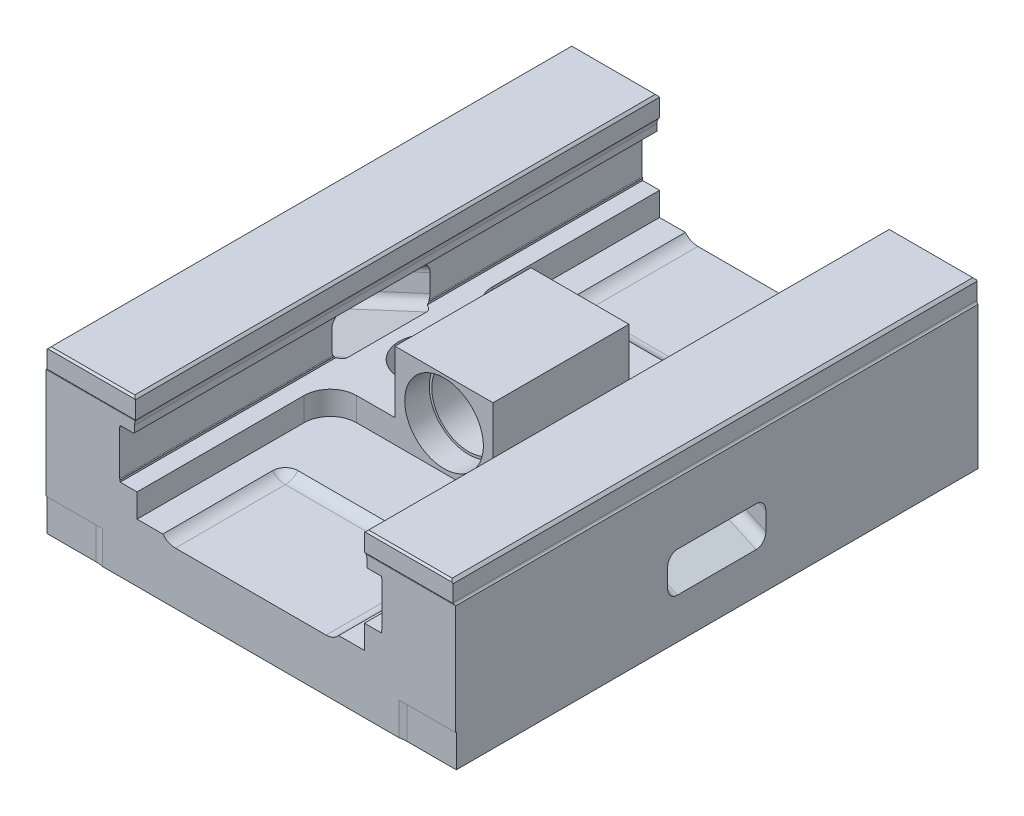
ISO-10303-21;
HEADER;
FILE_DESCRIPTION(('STEP AP214'),'2;1');
FILE_NAME('part.step','',(''),(''),'','','');
FILE_SCHEMA(('AUTOMOTIVE_DESIGN { 1 0 10303 214 1 1 1 1 }'));
ENDSEC;
DATA;
#1=APPLICATION_CONTEXT('core data for automotive mechanical design processes');
#2=APPLICATION_PROTOCOL_DEFINITION('international standard','automotive_design',2000,#1);
#3=PRODUCT_CONTEXT('',#1,'mechanical');
#4=PRODUCT('Part','Part','',(#3));
#5=PRODUCT_RELATED_PRODUCT_CATEGORY('part','',(#4));
#6=PRODUCT_DEFINITION_FORMATION('','',#4);
#7=PRODUCT_DEFINITION_CONTEXT('part definition',#1,'design');
#8=PRODUCT_DEFINITION('design','',#6,#7);
#9=PRODUCT_DEFINITION_SHAPE('','',#8);
#10=(LENGTH_UNIT() NAMED_UNIT(*) SI_UNIT(.MILLI.,.METRE.));
#11=(NAMED_UNIT(*) PLANE_ANGLE_UNIT() SI_UNIT($,.RADIAN.));
#12=(NAMED_UNIT(*) SI_UNIT($,.STERADIAN.) SOLID_ANGLE_UNIT());
#13=UNCERTAINTY_MEASURE_WITH_UNIT(LENGTH_MEASURE(1.E-05),#10,'distance_accuracy_value','');
#14=(GEOMETRIC_REPRESENTATION_CONTEXT(3) GLOBAL_UNCERTAINTY_ASSIGNED_CONTEXT((#13)) GLOBAL_UNIT_ASSIGNED_CONTEXT((#10,
#11,#12)) REPRESENTATION_CONTEXT('',''));
#15=CARTESIAN_POINT('',(0.,0.,0.));
#16=DIRECTION('',(0.,0.,1.));
#17=DIRECTION('',(1.,0.,0.));
#18=AXIS2_PLACEMENT_3D('',#15,#16,#17);
#19=CARTESIAN_POINT('',(0.,31.,-20.75));
#20=DIRECTION('',(0.,0.,-1.));
#21=DIRECTION('',(-1.,0.,0.));
#22=AXIS2_PLACEMENT_3D('',#19,#20,#21);
#23=CYLINDRICAL_SURFACE('',#22,11.25);
#24=CARTESIAN_POINT('',(0.,31.,-13.25));
#25=DIRECTION('',(0.,0.,-1.));
#26=DIRECTION('',(-1.,0.,0.));
#27=AXIS2_PLACEMENT_3D('',#24,#25,#26);
#28=CIRCLE('',#27,11.25);
#29=CARTESIAN_POINT('',(-11.25,31.,-13.25));
#30=VERTEX_POINT('',#29);
#31=EDGE_CURVE('E1386',#30,#30,#28,.T.);
#32=ORIENTED_EDGE('',*,*,#31,.T.);
#33=EDGE_LOOP('',(#32));
#34=FACE_BOUND('',#33,.T.);
#35=CARTESIAN_POINT('',(0.,31.,13.25));
#36=DIRECTION('',(0.,0.,-1.));
#37=DIRECTION('',(-1.,0.,0.));
#38=AXIS2_PLACEMENT_3D('',#35,#36,#37);
#39=CIRCLE('',#38,11.25);
#40=CARTESIAN_POINT('',(-11.25,31.,13.25));
#41=VERTEX_POINT('',#40);
#42=EDGE_CURVE('E1383',#41,#41,#39,.T.);
#43=ORIENTED_EDGE('',*,*,#42,.F.);
#44=EDGE_LOOP('',(#43));
#45=FACE_BOUND('',#44,.T.);
#46=CARTESIAN_POINT('',(0.,19.75,-4.188));
#47=CARTESIAN_POINT('',(0.113434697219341,19.7499996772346,-4.1880004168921));
#48=CARTESIAN_POINT('',(0.226862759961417,19.751719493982,-4.18338753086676));
#49=CARTESIAN_POINT('',(0.452906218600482,19.7585514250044,-4.16498297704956));
#50=CARTESIAN_POINT('',(0.565521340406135,19.7636646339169,-4.15118834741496));
#51=CARTESIAN_POINT('',(0.789018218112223,19.777145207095,-4.11456017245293));
#52=CARTESIAN_POINT('',(0.899900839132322,19.7855108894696,-4.09173129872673));
#53=CARTESIAN_POINT('',(1.11921840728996,19.8052687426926,-4.03726208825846));
#54=CARTESIAN_POINT('',(1.22765238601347,19.8166620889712,-4.00561832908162));
#55=CARTESIAN_POINT('',(1.54765110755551,19.854904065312,-3.89802199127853));
#56=CARTESIAN_POINT('',(1.75459107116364,19.8858582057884,-3.8092916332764));
#57=CARTESIAN_POINT('',(2.15051452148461,19.9556185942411,-3.60066966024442));
#58=CARTESIAN_POINT('',(2.33949324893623,19.9944269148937,-3.4807698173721));
#59=CARTESIAN_POINT('',(2.70221591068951,20.0777091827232,-3.20792311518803));
#60=CARTESIAN_POINT('',(2.87511358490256,20.1223418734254,-3.05389810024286));
#61=CARTESIAN_POINT('',(3.19329554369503,20.2114537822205,-2.71947064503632));
#62=CARTESIAN_POINT('',(3.33857155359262,20.2559329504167,-2.53906032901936));
#63=CARTESIAN_POINT('',(3.60274903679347,20.3415415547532,-2.14874481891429));
#64=CARTESIAN_POINT('',(3.7204599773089,20.3824833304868,-1.9379884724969));
#65=CARTESIAN_POINT('',(3.91838856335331,20.4539160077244,-1.49790573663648));
#66=CARTESIAN_POINT('',(3.99862093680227,20.4844110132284,-1.26858668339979));
#67=CARTESIAN_POINT('',(4.11598120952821,20.5298024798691,-0.807637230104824));
#68=CARTESIAN_POINT('',(4.15472474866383,20.5452812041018,-0.576477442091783));
#69=CARTESIAN_POINT('',(4.19305903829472,20.5605926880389,-0.11045915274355));
#70=CARTESIAN_POINT('',(4.19266565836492,20.5604317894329,0.124397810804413));
#71=CARTESIAN_POINT('',(4.15397407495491,20.5449848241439,0.576433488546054));
#72=CARTESIAN_POINT('',(4.11790757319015,20.5305892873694,0.79383927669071));
#73=CARTESIAN_POINT('',(4.01257953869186,20.4897734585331,1.21925667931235));
#74=CARTESIAN_POINT('',(3.94331308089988,20.4633513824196,1.42726689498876));
#75=CARTESIAN_POINT('',(3.77231015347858,20.4009168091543,1.83257229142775));
#76=CARTESIAN_POINT('',(3.66998935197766,20.3647338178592,2.02959351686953));
#77=CARTESIAN_POINT('',(3.43618942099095,20.2869120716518,2.40432114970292));
#78=CARTESIAN_POINT('',(3.30470032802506,20.2452714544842,2.58202092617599));
#79=CARTESIAN_POINT('',(3.00605189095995,20.1578653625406,2.92542791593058));
#80=CARTESIAN_POINT('',(2.83710824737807,20.1120092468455,3.08956407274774));
#81=CARTESIAN_POINT('',(2.47356278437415,20.0237099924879,3.38763819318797));
#82=CARTESIAN_POINT('',(2.27895714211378,19.981267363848,3.52157164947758));
#83=CARTESIAN_POINT('',(1.8656513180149,19.9037551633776,3.75713760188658));
#84=CARTESIAN_POINT('',(1.64663275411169,19.8688060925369,3.85825395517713));
#85=CARTESIAN_POINT('',(1.19306936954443,19.8111112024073,4.02168690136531));
#86=CARTESIAN_POINT('',(0.958531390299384,19.78836004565,4.0840204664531));
#87=CARTESIAN_POINT('',(0.493814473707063,19.7585589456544,4.16511450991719));
#88=CARTESIAN_POINT('',(0.264053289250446,19.7507472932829,4.18599105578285));
#89=CARTESIAN_POINT('',(-0.195795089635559,19.7493562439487,4.18973081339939));
#90=CARTESIAN_POINT('',(-0.425882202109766,19.7557737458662,4.17260230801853));
#91=CARTESIAN_POINT('',(-0.87075345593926,19.7816172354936,4.10243148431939));
#92=CARTESIAN_POINT('',(-1.085787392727,19.8005429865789,4.05076937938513));
#93=CARTESIAN_POINT('',(-1.50398863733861,19.8489970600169,3.9148088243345));
#94=CARTESIAN_POINT('',(-1.70715439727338,19.8785267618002,3.8305061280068));
#95=CARTESIAN_POINT('',(-2.10250205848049,19.9463395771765,3.6289801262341));
#96=CARTESIAN_POINT('',(-2.29418957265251,19.9848532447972,3.51086689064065));
#97=CARTESIAN_POINT('',(-2.65566192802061,20.0663661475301,3.24608109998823));
#98=CARTESIAN_POINT('',(-2.8254387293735,20.1093670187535,3.0993981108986));
#99=CARTESIAN_POINT('',(-3.1484178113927,20.1981659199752,2.77176666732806));
#100=CARTESIAN_POINT('',(-3.30011798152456,20.2439833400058,2.58933884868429));
#101=CARTESIAN_POINT('',(-3.57104123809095,20.3308638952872,2.20070780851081));
#102=CARTESIAN_POINT('',(-3.69026163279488,20.3719266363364,1.99450261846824));
#103=CARTESIAN_POINT('',(-3.89290463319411,20.4444572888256,1.56259815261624));
#104=CARTESIAN_POINT('',(-3.97619567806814,20.475889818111,1.33683080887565));
#105=CARTESIAN_POINT('',(-4.10304343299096,20.5246841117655,0.872981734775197));
#106=CARTESIAN_POINT('',(-4.14662423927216,20.5420544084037,0.634907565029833));
#107=CARTESIAN_POINT('',(-4.19067817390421,20.5596348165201,0.16945257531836));
#108=CARTESIAN_POINT('',(-4.19370794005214,20.5608625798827,-0.0576498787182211));
#109=CARTESIAN_POINT('',(-4.16310637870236,20.548621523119,-0.508945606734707));
#110=CARTESIAN_POINT('',(-4.12947842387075,20.5351540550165,-0.733139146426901));
#111=CARTESIAN_POINT('',(-4.02849451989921,20.4958811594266,-1.16551713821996));
#112=CARTESIAN_POINT('',(-3.96216764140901,20.4704531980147,-1.37397912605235));
#113=CARTESIAN_POINT('',(-3.79857220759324,20.4103395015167,-1.77694026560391));
#114=CARTESIAN_POINT('',(-3.70129588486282,20.3756514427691,-1.97143589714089));
#115=CARTESIAN_POINT('',(-3.47269541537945,20.2986860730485,-2.35191346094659));
#116=CARTESIAN_POINT('',(-3.3398670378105,20.2561084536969,-2.53693062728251));
#117=CARTESIAN_POINT('',(-3.04631533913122,20.1692148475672,-2.88285264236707));
#118=CARTESIAN_POINT('',(-2.88558321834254,20.1248983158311,-3.04374985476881));
#119=CARTESIAN_POINT('',(-2.53044312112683,20.0366784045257,-3.34562941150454));
#120=CARTESIAN_POINT('',(-2.33470158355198,19.9929214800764,-3.48510378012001));
#121=CARTESIAN_POINT('',(-2.02469471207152,19.9331901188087,-3.66802752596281));
#122=CARTESIAN_POINT('',(-1.91855640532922,19.9142538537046,-3.72464749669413));
#123=CARTESIAN_POINT('',(-1.7014773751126,19.8788698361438,-3.82867835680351));
#124=CARTESIAN_POINT('',(-1.59053872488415,19.8624210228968,-3.87609317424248));
#125=CARTESIAN_POINT('',(-1.36036113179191,19.831924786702,-3.96288553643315));
#126=CARTESIAN_POINT('',(-1.24096694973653,19.8179915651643,-4.00189175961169));
#127=CARTESIAN_POINT('',(-0.998859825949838,19.7937709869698,-4.0690779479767));
#128=CARTESIAN_POINT('',(-0.876148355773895,19.7834820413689,-4.09726263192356));
#129=CARTESIAN_POINT('',(-0.628443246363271,19.7668808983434,-4.1424934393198));
#130=CARTESIAN_POINT('',(-0.503449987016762,19.7605680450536,-4.15954139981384));
#131=CARTESIAN_POINT('',(-0.252301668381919,19.7521279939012,-4.18229385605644));
#132=CARTESIAN_POINT('',(-0.126146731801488,19.750000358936,-4.18799953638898));
#133=CARTESIAN_POINT('',(0.,19.75,-4.188));
#134=B_SPLINE_CURVE_WITH_KNOTS('',3,(#46,#47,#48,#49,#50,#51,#52,#53,#54,#55,#56,#57,#58,#59,
#60,#61,#62,#63,#64,#65,#66,#67,#68,#69,#70,#71,#72,#73,#74,#75,#76,#77,#78,#79,#80,#81,#82,#83,
#84,#85,#86,#87,#88,#89,#90,#91,#92,#93,#94,#95,#96,#97,#98,#99,#100,#101,#102,#103,#104,#105,
#106,#107,#108,#109,#110,#111,#112,#113,#114,#115,#116,#117,#118,#119,#120,#121,#122,#123,#124,
#125,#126,#127,#128,#129,#130,#131,#132,#133),.UNSPECIFIED.,.T.,.F.,(4,2,2,2,2,2,2,2,2,2,2,2,2,
2,2,2,2,2,2,2,2,2,2,2,2,2,2,2,2,2,2,2,2,2,2,2,2,2,2,2,2,2,2,4),(0.,0.340185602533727,
0.680480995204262,1.02060065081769,1.3608525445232,2.03931507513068,2.71795688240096,
3.42225972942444,4.12677323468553,4.85765292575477,5.58824516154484,6.289218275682,
6.98990715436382,7.64936713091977,8.30892496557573,8.98084665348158,9.6529982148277,
10.3696157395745,11.0863401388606,11.8138448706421,12.5410310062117,13.2300342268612,
13.9188873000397,14.581735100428,15.2446691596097,15.9269734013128,16.6095272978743,
17.3310960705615,18.052724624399,18.77697355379,19.5007827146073,20.178725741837,
20.8566064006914,21.5143979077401,22.172354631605,22.86443659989,23.5567372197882,
24.2857396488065,24.650689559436,25.0154833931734,25.3940590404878,25.7724694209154,
26.1508173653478,26.5291257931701),.UNSPECIFIED.);
#135=CARTESIAN_POINT('',(0.,19.75,-4.188));
#136=VERTEX_POINT('',#135);
#137=EDGE_CURVE('E11',#136,#136,#134,.T.);
#138=ORIENTED_EDGE('',*,*,#137,.T.);
#139=EDGE_LOOP('',(#138));
#140=FACE_BOUND('',#139,.T.);
#141=ADVANCED_FACE('F17',(#34,#45,#140),#23,.F.);
#142=CARTESIAN_POINT('',(-26.7,17.8,-28.75));
#143=DIRECTION('',(0.,1.,0.));
#144=DIRECTION('',(0.,0.,1.));
#145=AXIS2_PLACEMENT_3D('',#142,#143,#144);
#146=PLANE('',#145);
#147=CARTESIAN_POINT('',(23.005,17.8,-46.2));
#148=DIRECTION('',(0.,1.,0.));
#149=DIRECTION('',(0.,0.,1.));
#150=AXIS2_PLACEMENT_3D('',#147,#148,#149);
#151=CIRCLE('',#150,3.84187454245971);
#152=CARTESIAN_POINT('',(23.005,17.8,-42.3581254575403));
#153=VERTEX_POINT('',#152);
#154=CARTESIAN_POINT('',(26.8468745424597,17.8,-46.2));
#155=VERTEX_POINT('',#154);
#156=EDGE_CURVE('E650',#153,#155,#151,.T.);
#157=ORIENTED_EDGE('',*,*,#156,.F.);
#158=DIRECTION('',(-1.,0.,0.));
#159=VECTOR('',#158,1.);
#160=CARTESIAN_POINT('',(23.005,17.8,-42.3581254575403));
#161=LINE('',#160,#159);
#162=CARTESIAN_POINT('',(-23.005,17.8,-42.3581254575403));
#163=VERTEX_POINT('',#162);
#164=EDGE_CURVE('E647',#153,#163,#161,.T.);
#165=ORIENTED_EDGE('',*,*,#164,.T.);
#166=CARTESIAN_POINT('',(-23.005,17.8,-46.2));
#167=DIRECTION('',(0.,1.,0.));
#168=DIRECTION('',(0.,0.,1.));
#169=AXIS2_PLACEMENT_3D('',#166,#167,#168);
#170=CIRCLE('',#169,3.84187454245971);
#171=CARTESIAN_POINT('',(-26.8468745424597,17.8,-46.2));
#172=VERTEX_POINT('',#171);
#173=EDGE_CURVE('E1371',#172,#163,#170,.T.);
#174=ORIENTED_EDGE('',*,*,#173,.F.);
#175=DIRECTION('',(0.,0.,-1.));
#176=VECTOR('',#175,1.);
#177=CARTESIAN_POINT('',(-26.8468745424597,17.8,-46.2));
#178=LINE('',#177,#176);
#179=CARTESIAN_POINT('',(-26.8468745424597,17.8,-79.75));
#180=VERTEX_POINT('',#179);
#181=EDGE_CURVE('E1327',#172,#180,#178,.T.);
#182=ORIENTED_EDGE('',*,*,#181,.T.);
#183=DIRECTION('',(-1.,0.,0.));
#184=VECTOR('',#183,1.);
#185=CARTESIAN_POINT('',(34.7,17.8,-79.75));
#186=LINE('',#185,#184);
#187=CARTESIAN_POINT('',(-34.7,17.8,-79.75));
#188=VERTEX_POINT('',#187);
#189=EDGE_CURVE('E977',#180,#188,#186,.T.);
#190=ORIENTED_EDGE('',*,*,#189,.T.);
#191=DIRECTION('',(0.,0.,1.));
#192=VECTOR('',#191,1.);
#193=CARTESIAN_POINT('',(-34.7,17.8,-79.75));
#194=LINE('',#193,#192);
#195=CARTESIAN_POINT('',(-34.7,17.8,-28.75));
#196=VERTEX_POINT('',#195);
#197=EDGE_CURVE('E962',#188,#196,#194,.T.);
#198=ORIENTED_EDGE('',*,*,#197,.T.);
#199=CARTESIAN_POINT('',(-26.7,17.8,-28.75));
#200=DIRECTION('',(0.,1.,0.));
#201=DIRECTION('',(1.,0.,0.));
#202=AXIS2_PLACEMENT_3D('',#199,#200,#201);
#203=CIRCLE('',#202,8.);
#204=CARTESIAN_POINT('',(-26.7,17.8,-20.75));
#205=VERTEX_POINT('',#204);
#206=EDGE_CURVE('E965',#196,#205,#203,.T.);
#207=ORIENTED_EDGE('',*,*,#206,.T.);
#208=DIRECTION('',(1.,0.,0.));
#209=VECTOR('',#208,1.);
#210=CARTESIAN_POINT('',(-26.7,17.8,-20.75));
#211=LINE('',#210,#209);
#212=CARTESIAN_POINT('',(26.7,17.8,-20.75));
#213=VERTEX_POINT('',#212);
#214=EDGE_CURVE('E969',#205,#213,#211,.T.);
#215=ORIENTED_EDGE('',*,*,#214,.T.);
#216=CARTESIAN_POINT('',(26.7,17.8,-28.75));
#217=DIRECTION('',(0.,1.,0.));
#218=DIRECTION('',(1.,0.,0.));
#219=AXIS2_PLACEMENT_3D('',#216,#217,#218);
#220=CIRCLE('',#219,8.);
#221=CARTESIAN_POINT('',(34.7,17.8,-28.75));
#222=VERTEX_POINT('',#221);
#223=EDGE_CURVE('E972',#213,#222,#220,.T.);
#224=ORIENTED_EDGE('',*,*,#223,.T.);
#225=DIRECTION('',(0.,0.,-1.));
#226=VECTOR('',#225,1.);
#227=CARTESIAN_POINT('',(34.7,17.8,-28.75));
#228=LINE('',#227,#226);
#229=CARTESIAN_POINT('',(34.7,17.8,-79.75));
#230=VERTEX_POINT('',#229);
#231=EDGE_CURVE('E975',#222,#230,#228,.T.);
#232=ORIENTED_EDGE('',*,*,#231,.T.);
#233=CARTESIAN_POINT('',(26.8468745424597,17.8,-79.75));
#234=VERTEX_POINT('',#233);
#235=EDGE_CURVE('E978',#230,#234,#186,.T.);
#236=ORIENTED_EDGE('',*,*,#235,.T.);
#237=DIRECTION('',(0.,0.,-1.));
#238=VECTOR('',#237,1.);
#239=CARTESIAN_POINT('',(26.8468745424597,17.8,-46.2));
#240=LINE('',#239,#238);
#241=EDGE_CURVE('E1325',#234,#155,#240,.F.);
#242=ORIENTED_EDGE('',*,*,#241,.T.);
#243=EDGE_LOOP('',(#157,#165,#174,#182,#190,#198,#207,#215,#224,#232,#236,#242));
#244=FACE_BOUND('',#243,.T.);
#245=ADVANCED_FACE('F1215',(#244),#146,.T.);
#246=CARTESIAN_POINT('',(-26.7,17.8,28.75));
#247=DIRECTION('',(0.,1.,0.));
#248=DIRECTION('',(0.,0.,1.));
#249=AXIS2_PLACEMENT_3D('',#246,#247,#248);
#250=PLANE('',#249);
#251=CARTESIAN_POINT('',(-23.005,17.8,46.2));
#252=DIRECTION('',(0.,1.,0.));
#253=DIRECTION('',(0.,0.,1.));
#254=AXIS2_PLACEMENT_3D('',#251,#252,#253);
#255=CIRCLE('',#254,3.84187454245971);
#256=CARTESIAN_POINT('',(-23.005,17.8,42.3581254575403));
#257=VERTEX_POINT('',#256);
#258=CARTESIAN_POINT('',(-26.8468745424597,17.8,46.2));
#259=VERTEX_POINT('',#258);
#260=EDGE_CURVE('E688',#257,#259,#255,.T.);
#261=ORIENTED_EDGE('',*,*,#260,.F.);
#262=DIRECTION('',(-1.,0.,0.));
#263=VECTOR('',#262,1.);
#264=CARTESIAN_POINT('',(23.005,17.8,42.3581254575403));
#265=LINE('',#264,#263);
#266=CARTESIAN_POINT('',(23.005,17.8,42.3581254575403));
#267=VERTEX_POINT('',#266);
#268=EDGE_CURVE('E678',#257,#267,#265,.F.);
#269=ORIENTED_EDGE('',*,*,#268,.T.);
#270=CARTESIAN_POINT('',(23.005,17.8,46.2));
#271=DIRECTION('',(0.,1.,0.));
#272=DIRECTION('',(0.,0.,1.));
#273=AXIS2_PLACEMENT_3D('',#270,#271,#272);
#274=CIRCLE('',#273,3.84187454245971);
#275=CARTESIAN_POINT('',(26.8468745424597,17.8,46.2));
#276=VERTEX_POINT('',#275);
#277=EDGE_CURVE('E683',#276,#267,#274,.T.);
#278=ORIENTED_EDGE('',*,*,#277,.F.);
#279=DIRECTION('',(0.,0.,1.));
#280=VECTOR('',#279,1.);
#281=CARTESIAN_POINT('',(26.8468745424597,17.8,46.2));
#282=LINE('',#281,#280);
#283=CARTESIAN_POINT('',(26.8468745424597,17.8,79.75));
#284=VERTEX_POINT('',#283);
#285=EDGE_CURVE('E1312',#284,#276,#282,.F.);
#286=ORIENTED_EDGE('',*,*,#285,.F.);
#287=DIRECTION('',(1.,0.,0.));
#288=VECTOR('',#287,1.);
#289=CARTESIAN_POINT('',(-34.7,17.8,79.75));
#290=LINE('',#289,#288);
#291=CARTESIAN_POINT('',(34.7,17.8,79.75));
#292=VERTEX_POINT('',#291);
#293=EDGE_CURVE('E1015',#284,#292,#290,.T.);
#294=ORIENTED_EDGE('',*,*,#293,.T.);
#295=DIRECTION('',(0.,0.,-1.));
#296=VECTOR('',#295,1.);
#297=CARTESIAN_POINT('',(34.7,17.8,79.75));
#298=LINE('',#297,#296);
#299=CARTESIAN_POINT('',(34.7,17.8,28.75));
#300=VERTEX_POINT('',#299);
#301=EDGE_CURVE('E1019',#292,#300,#298,.T.);
#302=ORIENTED_EDGE('',*,*,#301,.T.);
#303=CARTESIAN_POINT('',(26.7,17.8,28.75));
#304=DIRECTION('',(0.,1.,0.));
#305=DIRECTION('',(1.,0.,0.));
#306=AXIS2_PLACEMENT_3D('',#303,#304,#305);
#307=CIRCLE('',#306,8.);
#308=CARTESIAN_POINT('',(26.7,17.8,20.75));
#309=VERTEX_POINT('',#308);
#310=EDGE_CURVE('E1022',#300,#309,#307,.T.);
#311=ORIENTED_EDGE('',*,*,#310,.T.);
#312=DIRECTION('',(-1.,0.,0.));
#313=VECTOR('',#312,1.);
#314=CARTESIAN_POINT('',(26.7,17.8,20.75));
#315=LINE('',#314,#313);
#316=CARTESIAN_POINT('',(-26.7,17.8,20.75));
#317=VERTEX_POINT('',#316);
#318=EDGE_CURVE('E1025',#309,#317,#315,.T.);
#319=ORIENTED_EDGE('',*,*,#318,.T.);
#320=CARTESIAN_POINT('',(-26.7,17.8,28.75));
#321=DIRECTION('',(0.,1.,0.));
#322=DIRECTION('',(1.,0.,0.));
#323=AXIS2_PLACEMENT_3D('',#320,#321,#322);
#324=CIRCLE('',#323,8.);
#325=CARTESIAN_POINT('',(-34.7,17.8,28.75));
#326=VERTEX_POINT('',#325);
#327=EDGE_CURVE('E1009',#317,#326,#324,.T.);
#328=ORIENTED_EDGE('',*,*,#327,.T.);
#329=DIRECTION('',(0.,0.,1.));
#330=VECTOR('',#329,1.);
#331=CARTESIAN_POINT('',(-34.7,17.8,28.75));
#332=LINE('',#331,#330);
#333=CARTESIAN_POINT('',(-34.7,17.8,79.75));
#334=VERTEX_POINT('',#333);
#335=EDGE_CURVE('E1012',#326,#334,#332,.T.);
#336=ORIENTED_EDGE('',*,*,#335,.T.);
#337=CARTESIAN_POINT('',(-26.8468745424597,17.8,79.75));
#338=VERTEX_POINT('',#337);
#339=EDGE_CURVE('E1016',#334,#338,#290,.T.);
#340=ORIENTED_EDGE('',*,*,#339,.T.);
#341=DIRECTION('',(0.,0.,1.));
#342=VECTOR('',#341,1.);
#343=CARTESIAN_POINT('',(-26.8468745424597,17.8,46.2));
#344=LINE('',#343,#342);
#345=EDGE_CURVE('E1316',#259,#338,#344,.T.);
#346=ORIENTED_EDGE('',*,*,#345,.F.);
#347=EDGE_LOOP('',(#261,#269,#278,#286,#294,#302,#311,#319,#328,#336,#340,#346));
#348=FACE_BOUND('',#347,.T.);
#349=ADVANCED_FACE('F1221',(#348),#250,.T.);
#350=CARTESIAN_POINT('',(-62.5,43.4583801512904,80.));
#351=DIRECTION('',(1.,0.,0.));
#352=DIRECTION('',(0.,0.,-1.));
#353=AXIS2_PLACEMENT_3D('',#350,#351,#352);
#354=PLANE('',#353);
#355=CARTESIAN_POINT('',(-62.5,16.925902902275,12.));
#356=DIRECTION('',(1.,0.,0.));
#357=DIRECTION('',(0.,1.,0.));
#358=AXIS2_PLACEMENT_3D('',#355,#356,#357);
#359=ELLIPSE('',#358,3.31013375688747,3.);
#360=CARTESIAN_POINT('',(-62.5,13.6157691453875,12.));
#361=VERTEX_POINT('',#360);
#362=CARTESIAN_POINT('',(-62.5,16.925902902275,15.));
#363=VERTEX_POINT('',#362);
#364=EDGE_CURVE('E837',#361,#363,#359,.F.);
#365=ORIENTED_EDGE('',*,*,#364,.F.);
#366=DIRECTION('',(0.,0.,1.));
#367=VECTOR('',#366,1.);
#368=CARTESIAN_POINT('',(-62.5,13.6157691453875,80.));
#369=LINE('',#368,#367);
#370=CARTESIAN_POINT('',(-62.5,13.6157691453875,-12.));
#371=VERTEX_POINT('',#370);
#372=EDGE_CURVE('E1318',#371,#361,#369,.T.);
#373=ORIENTED_EDGE('',*,*,#372,.F.);
#374=CARTESIAN_POINT('',(-62.5,16.925902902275,-12.));
#375=DIRECTION('',(1.,0.,0.));
#376=DIRECTION('',(0.,1.,0.));
#377=AXIS2_PLACEMENT_3D('',#374,#375,#376);
#378=ELLIPSE('',#377,3.31013375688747,3.);
#379=CARTESIAN_POINT('',(-62.5,16.925902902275,-15.));
#380=VERTEX_POINT('',#379);
#381=EDGE_CURVE('E833',#380,#371,#378,.F.);
#382=ORIENTED_EDGE('',*,*,#381,.F.);
#383=DIRECTION('',(0.,-1.,0.));
#384=VECTOR('',#383,1.);
#385=CARTESIAN_POINT('',(-62.5,43.4583801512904,-15.));
#386=LINE('',#385,#384);
#387=CARTESIAN_POINT('',(-62.5,22.4427924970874,-15.));
#388=VERTEX_POINT('',#387);
#389=EDGE_CURVE('E839',#388,#380,#386,.T.);
#390=ORIENTED_EDGE('',*,*,#389,.F.);
#391=CARTESIAN_POINT('',(-62.5,22.4427924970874,-12.));
#392=DIRECTION('',(1.,0.,0.));
#393=DIRECTION('',(0.,1.,0.));
#394=AXIS2_PLACEMENT_3D('',#391,#392,#393);
#395=ELLIPSE('',#394,3.31013375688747,3.);
#396=CARTESIAN_POINT('',(-62.5,25.7529262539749,-12.));
#397=VERTEX_POINT('',#396);
#398=EDGE_CURVE('E841',#397,#388,#395,.F.);
#399=ORIENTED_EDGE('',*,*,#398,.F.);
#400=DIRECTION('',(0.,0.,-1.));
#401=VECTOR('',#400,1.);
#402=CARTESIAN_POINT('',(-62.5,25.7529262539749,80.));
#403=LINE('',#402,#401);
#404=CARTESIAN_POINT('',(-62.5,25.7529262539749,12.));
#405=VERTEX_POINT('',#404);
#406=EDGE_CURVE('E843',#405,#397,#403,.T.);
#407=ORIENTED_EDGE('',*,*,#406,.F.);
#408=CARTESIAN_POINT('',(-62.5,22.4427924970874,12.));
#409=DIRECTION('',(1.,0.,0.));
#410=DIRECTION('',(0.,1.,0.));
#411=AXIS2_PLACEMENT_3D('',#408,#409,#410);
#412=ELLIPSE('',#411,3.31013375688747,3.);
#413=CARTESIAN_POINT('',(-62.5,22.4427924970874,15.));
#414=VERTEX_POINT('',#413);
#415=EDGE_CURVE('E845',#414,#405,#412,.F.);
#416=ORIENTED_EDGE('',*,*,#415,.F.);
#417=DIRECTION('',(0.,1.,0.));
#418=VECTOR('',#417,1.);
#419=CARTESIAN_POINT('',(-62.5,43.4583801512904,15.));
#420=LINE('',#419,#418);
#421=EDGE_CURVE('E847',#363,#414,#420,.T.);
#422=ORIENTED_EDGE('',*,*,#421,.F.);
#423=EDGE_LOOP('',(#365,#373,#382,#390,#399,#407,#416,#422));
#424=FACE_BOUND('',#423,.T.);
#425=DIRECTION('',(0.,-1.,0.));
#426=VECTOR('',#425,1.);
#427=CARTESIAN_POINT('',(-62.5,10.,79.5));
#428=LINE('',#427,#426);
#429=CARTESIAN_POINT('',(-62.5,10.,79.5));
#430=VERTEX_POINT('',#429);
#431=CARTESIAN_POINT('',(-62.5,0.,79.5));
#432=VERTEX_POINT('',#431);
#433=EDGE_CURVE('E746',#430,#432,#428,.T.);
#434=ORIENTED_EDGE('',*,*,#433,.F.);
#435=DIRECTION('',(0.,0.,1.));
#436=VECTOR('',#435,1.);
#437=CARTESIAN_POINT('',(-62.5,10.,79.5));
#438=LINE('',#437,#436);
#439=CARTESIAN_POINT('',(-62.5,10.,79.75));
#440=VERTEX_POINT('',#439);
#441=EDGE_CURVE('E713',#430,#440,#438,.T.);
#442=ORIENTED_EDGE('',*,*,#441,.T.);
#443=DIRECTION('',(0.,1.,0.));
#444=VECTOR('',#443,1.);
#445=CARTESIAN_POINT('',(-62.5,43.4583801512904,79.75));
#446=LINE('',#445,#444);
#447=CARTESIAN_POINT('',(-62.5,43.4,79.75));
#448=VERTEX_POINT('',#447);
#449=EDGE_CURVE('E1311',#440,#448,#446,.T.);
#450=ORIENTED_EDGE('',*,*,#449,.T.);
#451=CARTESIAN_POINT('',(-62.5,43.4,80.55));
#452=DIRECTION('',(1.,0.,0.));
#453=DIRECTION('',(0.,0.,-1.));
#454=AXIS2_PLACEMENT_3D('',#451,#452,#453);
#455=CIRCLE('',#454,0.800000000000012);
#456=CARTESIAN_POINT('',(-62.5,43.4583801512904,79.7521329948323));
#457=VERTEX_POINT('',#456);
#458=EDGE_CURVE('E2584',#457,#448,#455,.F.);
#459=ORIENTED_EDGE('',*,*,#458,.F.);
#460=DIRECTION('',(0.,0.,-1.));
#461=VECTOR('',#460,1.);
#462=CARTESIAN_POINT('',(-62.5,43.4583801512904,80.));
#463=LINE('',#462,#461);
#464=CARTESIAN_POINT('',(-62.5,43.4583801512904,-79.7521329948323));
#465=VERTEX_POINT('',#464);
#466=EDGE_CURVE('E2211',#457,#465,#463,.T.);
#467=ORIENTED_EDGE('',*,*,#466,.T.);
#468=CARTESIAN_POINT('',(-62.5,43.4,-80.55));
#469=DIRECTION('',(1.,0.,0.));
#470=DIRECTION('',(0.,0.,-1.));
#471=AXIS2_PLACEMENT_3D('',#468,#469,#470);
#472=CIRCLE('',#471,0.800000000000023);
#473=CARTESIAN_POINT('',(-62.5,43.4,-79.75));
#474=VERTEX_POINT('',#473);
#475=EDGE_CURVE('E1076',#474,#465,#472,.F.);
#476=ORIENTED_EDGE('',*,*,#475,.F.);
#477=DIRECTION('',(0.,-1.,0.));
#478=VECTOR('',#477,1.);
#479=CARTESIAN_POINT('',(-62.5,43.4583801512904,-79.75));
#480=LINE('',#479,#478);
#481=CARTESIAN_POINT('',(-62.5,0.,-79.75));
#482=VERTEX_POINT('',#481);
#483=EDGE_CURVE('E2354',#474,#482,#480,.T.);
#484=ORIENTED_EDGE('',*,*,#483,.T.);
#485=DIRECTION('',(0.,0.,-1.));
#486=VECTOR('',#485,1.);
#487=CARTESIAN_POINT('',(-62.5,0.,80.));
#488=LINE('',#487,#486);
#489=EDGE_CURVE('E2238',#432,#482,#488,.T.);
#490=ORIENTED_EDGE('',*,*,#489,.F.);
#491=EDGE_LOOP('',(#434,#442,#450,#459,#467,#476,#484,#490));
#492=FACE_BOUND('',#491,.T.);
#493=ADVANCED_FACE('F2397',(#424,#492),#354,.F.);
#494=CARTESIAN_POINT('',(62.5,0.,80.));
#495=DIRECTION('',(-1.,0.,0.));
#496=DIRECTION('',(0.,0.,1.));
#497=AXIS2_PLACEMENT_3D('',#494,#495,#496);
#498=PLANE('',#497);
#499=CARTESIAN_POINT('',(62.5,21.2770233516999,12.));
#500=DIRECTION('',(-1.,0.,0.));
#501=DIRECTION('',(0.,1.,0.));
#502=AXIS2_PLACEMENT_3D('',#499,#500,#501);
#503=ELLIPSE('',#502,3.31013375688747,3.);
#504=CARTESIAN_POINT('',(62.5,24.5871571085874,12.));
#505=VERTEX_POINT('',#504);
#506=CARTESIAN_POINT('',(62.5,21.2770233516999,15.));
#507=VERTEX_POINT('',#506);
#508=EDGE_CURVE('E934',#505,#507,#503,.F.);
#509=ORIENTED_EDGE('',*,*,#508,.F.);
#510=DIRECTION('',(0.,0.,1.));
#511=VECTOR('',#510,1.);
#512=CARTESIAN_POINT('',(62.5,24.5871571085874,80.));
#513=LINE('',#512,#511);
#514=CARTESIAN_POINT('',(62.5,24.5871571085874,-12.));
#515=VERTEX_POINT('',#514);
#516=EDGE_CURVE('E874',#515,#505,#513,.T.);
#517=ORIENTED_EDGE('',*,*,#516,.F.);
#518=CARTESIAN_POINT('',(62.5,21.2770233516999,-12.));
#519=DIRECTION('',(-1.,0.,0.));
#520=DIRECTION('',(0.,1.,0.));
#521=AXIS2_PLACEMENT_3D('',#518,#519,#520);
#522=ELLIPSE('',#521,3.31013375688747,3.);
#523=CARTESIAN_POINT('',(62.5,21.2770233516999,-15.));
#524=VERTEX_POINT('',#523);
#525=EDGE_CURVE('E876',#524,#515,#522,.F.);
#526=ORIENTED_EDGE('',*,*,#525,.F.);
#527=DIRECTION('',(0.,1.,0.));
#528=VECTOR('',#527,1.);
#529=CARTESIAN_POINT('',(62.5,0.,-15.));
#530=LINE('',#529,#528);
#531=CARTESIAN_POINT('',(62.5,15.7601337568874,-15.));
#532=VERTEX_POINT('',#531);
#533=EDGE_CURVE('E879',#532,#524,#530,.T.);
#534=ORIENTED_EDGE('',*,*,#533,.F.);
#535=CARTESIAN_POINT('',(62.5,15.7601337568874,-12.));
#536=DIRECTION('',(-1.,0.,0.));
#537=DIRECTION('',(0.,1.,0.));
#538=AXIS2_PLACEMENT_3D('',#535,#536,#537);
#539=ELLIPSE('',#538,3.31013375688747,3.);
#540=CARTESIAN_POINT('',(62.5,12.45,-12.));
#541=VERTEX_POINT('',#540);
#542=EDGE_CURVE('E926',#541,#532,#539,.F.);
#543=ORIENTED_EDGE('',*,*,#542,.F.);
#544=DIRECTION('',(0.,0.,-1.));
#545=VECTOR('',#544,1.);
#546=CARTESIAN_POINT('',(62.5,12.45,80.));
#547=LINE('',#546,#545);
#548=CARTESIAN_POINT('',(62.5,12.45,12.));
#549=VERTEX_POINT('',#548);
#550=EDGE_CURVE('E2372',#549,#541,#547,.T.);
#551=ORIENTED_EDGE('',*,*,#550,.F.);
#552=CARTESIAN_POINT('',(62.5,15.7601337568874,12.));
#553=DIRECTION('',(-1.,0.,0.));
#554=DIRECTION('',(0.,1.,0.));
#555=AXIS2_PLACEMENT_3D('',#552,#553,#554);
#556=ELLIPSE('',#555,3.31013375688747,3.);
#557=CARTESIAN_POINT('',(62.5,15.7601337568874,15.));
#558=VERTEX_POINT('',#557);
#559=EDGE_CURVE('E930',#558,#549,#556,.F.);
#560=ORIENTED_EDGE('',*,*,#559,.F.);
#561=DIRECTION('',(0.,-1.,0.));
#562=VECTOR('',#561,1.);
#563=CARTESIAN_POINT('',(62.5,0.,15.));
#564=LINE('',#563,#562);
#565=EDGE_CURVE('E932',#507,#558,#564,.T.);
#566=ORIENTED_EDGE('',*,*,#565,.F.);
#567=EDGE_LOOP('',(#509,#517,#526,#534,#543,#551,#560,#566));
#568=FACE_BOUND('',#567,.T.);
#569=DIRECTION('',(0.,-1.,0.));
#570=VECTOR('',#569,1.);
#571=CARTESIAN_POINT('',(62.5,10.,79.5));
#572=LINE('',#571,#570);
#573=CARTESIAN_POINT('',(62.5,10.,79.5));
#574=VERTEX_POINT('',#573);
#575=CARTESIAN_POINT('',(62.5,0.,79.5));
#576=VERTEX_POINT('',#575);
#577=EDGE_CURVE('E743',#574,#576,#572,.T.);
#578=ORIENTED_EDGE('',*,*,#577,.T.);
#579=DIRECTION('',(0.,0.,-1.));
#580=VECTOR('',#579,1.);
#581=CARTESIAN_POINT('',(62.5,0.,80.));
#582=LINE('',#581,#580);
#583=CARTESIAN_POINT('',(62.5,0.,-79.75));
#584=VERTEX_POINT('',#583);
#585=EDGE_CURVE('E2240',#576,#584,#582,.T.);
#586=ORIENTED_EDGE('',*,*,#585,.T.);
#587=DIRECTION('',(0.,1.,0.));
#588=VECTOR('',#587,1.);
#589=CARTESIAN_POINT('',(62.5,0.,-79.75));
#590=LINE('',#589,#588);
#591=CARTESIAN_POINT('',(62.5,43.4,-79.75));
#592=VERTEX_POINT('',#591);
#593=EDGE_CURVE('E2129',#584,#592,#590,.T.);
#594=ORIENTED_EDGE('',*,*,#593,.T.);
#595=CARTESIAN_POINT('',(62.5,43.4,-80.55));
#596=DIRECTION('',(-1.,0.,0.));
#597=DIRECTION('',(0.,0.,1.));
#598=AXIS2_PLACEMENT_3D('',#595,#596,#597);
#599=CIRCLE('',#598,0.800000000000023);
#600=CARTESIAN_POINT('',(62.5,43.4583801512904,-79.7521329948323));
#601=VERTEX_POINT('',#600);
#602=EDGE_CURVE('E1086',#601,#592,#599,.F.);
#603=ORIENTED_EDGE('',*,*,#602,.F.);
#604=DIRECTION('',(0.,0.,-1.));
#605=VECTOR('',#604,1.);
#606=CARTESIAN_POINT('',(62.5,43.4583801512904,80.));
#607=LINE('',#606,#605);
#608=CARTESIAN_POINT('',(62.5,43.4583801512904,79.7521329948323));
#609=VERTEX_POINT('',#608);
#610=EDGE_CURVE('E2242',#609,#601,#607,.T.);
#611=ORIENTED_EDGE('',*,*,#610,.F.);
#612=CARTESIAN_POINT('',(62.5,43.4,80.55));
#613=DIRECTION('',(-1.,0.,0.));
#614=DIRECTION('',(0.,0.,1.));
#615=AXIS2_PLACEMENT_3D('',#612,#613,#614);
#616=CIRCLE('',#615,0.800000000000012);
#617=CARTESIAN_POINT('',(62.5,43.4,79.75));
#618=VERTEX_POINT('',#617);
#619=EDGE_CURVE('E1184',#618,#609,#616,.F.);
#620=ORIENTED_EDGE('',*,*,#619,.F.);
#621=DIRECTION('',(0.,-1.,0.));
#622=VECTOR('',#621,1.);
#623=CARTESIAN_POINT('',(62.5,0.,79.75));
#624=LINE('',#623,#622);
#625=CARTESIAN_POINT('',(62.5,10.,79.75));
#626=VERTEX_POINT('',#625);
#627=EDGE_CURVE('E2065',#618,#626,#624,.T.);
#628=ORIENTED_EDGE('',*,*,#627,.T.);
#629=DIRECTION('',(0.,0.,-1.));
#630=VECTOR('',#629,1.);
#631=CARTESIAN_POINT('',(62.5,10.,84.75));
#632=LINE('',#631,#630);
#633=EDGE_CURVE('E46',#626,#574,#632,.T.);
#634=ORIENTED_EDGE('',*,*,#633,.T.);
#635=EDGE_LOOP('',(#578,#586,#594,#603,#611,#620,#628,#634));
#636=FACE_BOUND('',#635,.T.);
#637=ADVANCED_FACE('F1190',(#568,#636),#498,.F.);
#638=CARTESIAN_POINT('',(39.85,25.,80.));
#639=DIRECTION('',(0.,-1.,0.));
#640=DIRECTION('',(0.,0.,-1.));
#641=AXIS2_PLACEMENT_3D('',#638,#639,#640);
#642=PLANE('',#641);
#643=CARTESIAN_POINT('',(-25.,25.,0.));
#644=DIRECTION('',(0.,-1.,0.));
#645=DIRECTION('',(0.,0.,-1.));
#646=AXIS2_PLACEMENT_3D('',#643,#644,#645);
#647=CIRCLE('',#646,9.5);
#648=CARTESIAN_POINT('',(-25.,25.,-9.5));
#649=VERTEX_POINT('',#648);
#650=EDGE_CURVE('E1418',#649,#649,#647,.T.);
#651=ORIENTED_EDGE('',*,*,#650,.T.);
#652=EDGE_LOOP('',(#651));
#653=FACE_BOUND('',#652,.T.);
#654=CARTESIAN_POINT('',(-45.1850428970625,25.,12.));
#655=DIRECTION('',(0.,-1.,0.));
#656=DIRECTION('',(1.,0.,0.));
#657=AXIS2_PLACEMENT_3D('',#654,#655,#656);
#658=ELLIPSE('',#657,7.09860474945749,3.);
#659=CARTESIAN_POINT('',(-39.85,25.,13.978986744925));
#660=VERTEX_POINT('',#659);
#661=CARTESIAN_POINT('',(-38.0864381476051,25.,12.));
#662=VERTEX_POINT('',#661);
#663=EDGE_CURVE('E835',#660,#662,#658,.F.);
#664=ORIENTED_EDGE('',*,*,#663,.F.);
#665=DIRECTION('',(0.,0.,-1.));
#666=VECTOR('',#665,1.);
#667=CARTESIAN_POINT('',(-39.85,25.,80.));
#668=LINE('',#667,#666);
#669=CARTESIAN_POINT('',(-39.85,25.,79.75));
#670=VERTEX_POINT('',#669);
#671=EDGE_CURVE('E2292',#670,#660,#668,.T.);
#672=ORIENTED_EDGE('',*,*,#671,.F.);
#673=DIRECTION('',(1.,0.,0.));
#674=VECTOR('',#673,1.);
#675=CARTESIAN_POINT('',(39.85,25.,79.75));
#676=LINE('',#675,#674);
#677=CARTESIAN_POINT('',(-34.7,25.,79.75));
#678=VERTEX_POINT('',#677);
#679=EDGE_CURVE('E2102',#670,#678,#676,.T.);
#680=ORIENTED_EDGE('',*,*,#679,.T.);
#681=DIRECTION('',(0.,0.,1.));
#682=VECTOR('',#681,1.);
#683=CARTESIAN_POINT('',(-34.7,25.,28.75));
#684=LINE('',#683,#682);
#685=CARTESIAN_POINT('',(-34.7,25.,28.75));
#686=VERTEX_POINT('',#685);
#687=EDGE_CURVE('E1031',#686,#678,#684,.T.);
#688=ORIENTED_EDGE('',*,*,#687,.F.);
#689=CARTESIAN_POINT('',(-26.7,25.,28.75));
#690=DIRECTION('',(0.,1.,0.));
#691=DIRECTION('',(1.,0.,0.));
#692=AXIS2_PLACEMENT_3D('',#689,#690,#691);
#693=CIRCLE('',#692,8.);
#694=CARTESIAN_POINT('',(-26.7,25.,20.75));
#695=VERTEX_POINT('',#694);
#696=EDGE_CURVE('E1008',#695,#686,#693,.T.);
#697=ORIENTED_EDGE('',*,*,#696,.F.);
#698=DIRECTION('',(-1.,0.,0.));
#699=VECTOR('',#698,1.);
#700=CARTESIAN_POINT('',(26.7,25.,20.75));
#701=LINE('',#700,#699);
#702=CARTESIAN_POINT('',(-14.95,25.,20.75));
#703=VERTEX_POINT('',#702);
#704=EDGE_CURVE('E1039',#703,#695,#701,.T.);
#705=ORIENTED_EDGE('',*,*,#704,.F.);
#706=DIRECTION('',(0.,0.,1.));
#707=VECTOR('',#706,1.);
#708=CARTESIAN_POINT('',(-14.95,25.,-20.75));
#709=LINE('',#708,#707);
#710=CARTESIAN_POINT('',(-14.95,25.,-20.75));
#711=VERTEX_POINT('',#710);
#712=EDGE_CURVE('E938',#711,#703,#709,.T.);
#713=ORIENTED_EDGE('',*,*,#712,.F.);
#714=DIRECTION('',(1.,0.,0.));
#715=VECTOR('',#714,1.);
#716=CARTESIAN_POINT('',(-26.7,25.,-20.75));
#717=LINE('',#716,#715);
#718=CARTESIAN_POINT('',(-26.7,25.,-20.75));
#719=VERTEX_POINT('',#718);
#720=EDGE_CURVE('E988',#719,#711,#717,.T.);
#721=ORIENTED_EDGE('',*,*,#720,.F.);
#722=CARTESIAN_POINT('',(-26.7,25.,-28.75));
#723=DIRECTION('',(0.,1.,0.));
#724=DIRECTION('',(1.,0.,0.));
#725=AXIS2_PLACEMENT_3D('',#722,#723,#724);
#726=CIRCLE('',#725,8.);
#727=CARTESIAN_POINT('',(-34.7,25.,-28.75));
#728=VERTEX_POINT('',#727);
#729=EDGE_CURVE('E984',#728,#719,#726,.T.);
#730=ORIENTED_EDGE('',*,*,#729,.F.);
#731=DIRECTION('',(0.,0.,1.));
#732=VECTOR('',#731,1.);
#733=CARTESIAN_POINT('',(-34.7,25.,-79.75));
#734=LINE('',#733,#732);
#735=CARTESIAN_POINT('',(-34.7,25.,-79.75));
#736=VERTEX_POINT('',#735);
#737=EDGE_CURVE('E961',#736,#728,#734,.T.);
#738=ORIENTED_EDGE('',*,*,#737,.F.);
#739=DIRECTION('',(-1.,0.,0.));
#740=VECTOR('',#739,1.);
#741=CARTESIAN_POINT('',(39.85,25.,-79.75));
#742=LINE('',#741,#740);
#743=CARTESIAN_POINT('',(-39.85,25.,-79.75));
#744=VERTEX_POINT('',#743);
#745=EDGE_CURVE('E2156',#736,#744,#742,.T.);
#746=ORIENTED_EDGE('',*,*,#745,.T.);
#747=CARTESIAN_POINT('',(-39.85,25.,-13.978986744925));
#748=VERTEX_POINT('',#747);
#749=EDGE_CURVE('E2291',#748,#744,#668,.T.);
#750=ORIENTED_EDGE('',*,*,#749,.F.);
#751=CARTESIAN_POINT('',(-45.1850428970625,25.,-12.));
#752=DIRECTION('',(0.,-1.,0.));
#753=DIRECTION('',(1.,0.,0.));
#754=AXIS2_PLACEMENT_3D('',#751,#752,#753);
#755=ELLIPSE('',#754,7.09860474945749,3.);
#756=CARTESIAN_POINT('',(-38.0864381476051,25.,-12.));
#757=VERTEX_POINT('',#756);
#758=EDGE_CURVE('E2421',#757,#748,#755,.F.);
#759=ORIENTED_EDGE('',*,*,#758,.F.);
#760=DIRECTION('',(0.,0.,-1.));
#761=VECTOR('',#760,1.);
#762=CARTESIAN_POINT('',(-38.0864381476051,25.,80.));
#763=LINE('',#762,#761);
#764=EDGE_CURVE('E849',#662,#757,#763,.T.);
#765=ORIENTED_EDGE('',*,*,#764,.F.);
#766=EDGE_LOOP('',(#664,#672,#680,#688,#697,#705,#713,#721,#730,#738,#746,#750,#759,#765));
#767=FACE_BOUND('',#766,.T.);
#768=ADVANCED_FACE('F2418',(#653,#767),#642,.F.);
#769=CARTESIAN_POINT('',(-39.6,25.9,80.));
#770=DIRECTION('',(0.,0.,-1.));
#771=DIRECTION('',(-1.,0.,0.));
#772=AXIS2_PLACEMENT_3D('',#769,#770,#771);
#773=CYLINDRICAL_SURFACE('',#772,0.400000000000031);
#774=DIRECTION('',(0.,0.,-1.));
#775=VECTOR('',#774,1.);
#776=CARTESIAN_POINT('',(-39.85,25.5877501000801,80.));
#777=LINE('',#776,#775);
#778=CARTESIAN_POINT('',(-39.85,25.5877501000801,79.75));
#779=VERTEX_POINT('',#778);
#780=CARTESIAN_POINT('',(-39.85,25.5877501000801,14.4565630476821));
#781=VERTEX_POINT('',#780);
#782=EDGE_CURVE('E2296',#779,#781,#777,.T.);
#783=ORIENTED_EDGE('',*,*,#782,.T.);
#784=CARTESIAN_POINT('',(-39.85,25.5877501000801,14.4565630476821));
#785=CARTESIAN_POINT('',(-39.8724205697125,25.6057102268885,14.4746468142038));
#786=CARTESIAN_POINT('',(-39.8928305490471,25.6260078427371,14.4929542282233));
#787=CARTESIAN_POINT('',(-39.9290756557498,25.6707697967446,14.529466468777));
#788=CARTESIAN_POINT('',(-39.9448758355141,25.6952638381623,14.547669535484));
#789=CARTESIAN_POINT('',(-39.9699415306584,25.745512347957,14.5817044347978));
#790=CARTESIAN_POINT('',(-39.979631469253,25.7710056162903,14.5976090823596));
#791=CARTESIAN_POINT('',(-39.9936694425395,25.8240413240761,14.6280696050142));
#792=CARTESIAN_POINT('',(-39.9980475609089,25.851571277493,14.6426326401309));
#793=CARTESIAN_POINT('',(-39.9998265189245,25.8863935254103,14.6595955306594));
#794=CARTESIAN_POINT('',(-40.0000009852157,25.8931852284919,14.6628370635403));
#795=CARTESIAN_POINT('',(-40.,25.9,14.666022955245));
#796=B_SPLINE_CURVE_WITH_KNOTS('',3,(#784,#785,#786,#787,#788,#789,#790,#791,#792,#793,#794,
#795),.UNSPECIFIED.,.F.,.F.,(4,2,2,2,2,4),(0.,0.101750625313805,0.204253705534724,
0.29848544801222,0.392180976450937,0.414755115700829),.UNSPECIFIED.);
#797=CARTESIAN_POINT('',(-40.,25.9,14.6660229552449));
#798=VERTEX_POINT('',#797);
#799=EDGE_CURVE('E824',#781,#798,#796,.T.);
#800=ORIENTED_EDGE('',*,*,#799,.T.);
#801=DIRECTION('',(0.,0.,-1.));
#802=VECTOR('',#801,1.);
#803=CARTESIAN_POINT('',(-40.,25.9,80.));
#804=LINE('',#803,#802);
#805=CARTESIAN_POINT('',(-40.,25.9,79.75));
#806=VERTEX_POINT('',#805);
#807=EDGE_CURVE('E2300',#806,#798,#804,.T.);
#808=ORIENTED_EDGE('',*,*,#807,.F.);
#809=CARTESIAN_POINT('',(-39.6,25.9,79.75));
#810=DIRECTION('',(0.,0.,-1.));
#811=DIRECTION('',(-1.,0.,0.));
#812=AXIS2_PLACEMENT_3D('',#809,#810,#811);
#813=CIRCLE('',#812,0.400000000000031);
#814=EDGE_CURVE('E2108',#779,#806,#813,.T.);
#815=ORIENTED_EDGE('',*,*,#814,.F.);
#816=EDGE_LOOP('',(#783,#800,#808,#815));
#817=FACE_BOUND('',#816,.T.);
#818=ADVANCED_FACE('F783',(#817),#773,.F.);
#819=CARTESIAN_POINT('',(-40.,25.9,-14.6660229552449));
#820=VERTEX_POINT('',#819);
#821=CARTESIAN_POINT('',(-40.,25.9,-79.75));
#822=VERTEX_POINT('',#821);
#823=EDGE_CURVE('E2299',#820,#822,#804,.T.);
#824=ORIENTED_EDGE('',*,*,#823,.F.);
#825=CARTESIAN_POINT('',(-40.,25.9,-14.6660229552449));
#826=CARTESIAN_POINT('',(-40.0000061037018,25.8744508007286,-14.6540943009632));
#827=CARTESIAN_POINT('',(-39.9975564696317,25.8493258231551,-14.6414124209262));
#828=CARTESIAN_POINT('',(-39.9882429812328,25.8006100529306,-14.6149329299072));
#829=CARTESIAN_POINT('',(-39.9813920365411,25.7770149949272,-14.6011386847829));
#830=CARTESIAN_POINT('',(-39.9637895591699,25.7319448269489,-14.5727868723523));
#831=CARTESIAN_POINT('',(-39.9530478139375,25.7104645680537,-14.5582312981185));
#832=CARTESIAN_POINT('',(-39.9280957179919,25.6699600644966,-14.5286735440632));
#833=CARTESIAN_POINT('',(-39.9138855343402,25.6509357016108,-14.5136713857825));
#834=CARTESIAN_POINT('',(-39.8907648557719,25.6250845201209,-14.4916107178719));
#835=CARTESIAN_POINT('',(-39.8830495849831,25.6171470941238,-14.4845663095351));
#836=CARTESIAN_POINT('',(-39.8669913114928,25.6019441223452,-14.470524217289));
#837=CARTESIAN_POINT('',(-39.8586497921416,25.5946770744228,-14.4635264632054));
#838=CARTESIAN_POINT('',(-39.85,25.5877501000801,-14.4565630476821));
#839=B_SPLINE_CURVE_WITH_KNOTS('',3,(#825,#826,#827,#828,#829,#830,#831,#832,#833,#834,#835,
#836,#837,#838),.UNSPECIFIED.,.F.,.F.,(4,2,2,2,2,2,4),(0.,0.0843787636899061,0.168511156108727,
0.25243336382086,0.336351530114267,0.375686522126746,0.414931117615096),.UNSPECIFIED.);
#840=CARTESIAN_POINT('',(-39.85,25.5877501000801,-14.4565630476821));
#841=VERTEX_POINT('',#840);
#842=EDGE_CURVE('E772',#820,#841,#839,.T.);
#843=ORIENTED_EDGE('',*,*,#842,.T.);
#844=CARTESIAN_POINT('',(-39.85,25.5877501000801,-79.75));
#845=VERTEX_POINT('',#844);
#846=EDGE_CURVE('E2295',#841,#845,#777,.T.);
#847=ORIENTED_EDGE('',*,*,#846,.T.);
#848=CARTESIAN_POINT('',(-39.6,25.9,-79.75));
#849=DIRECTION('',(0.,0.,1.));
#850=DIRECTION('',(1.,0.,0.));
#851=AXIS2_PLACEMENT_3D('',#848,#849,#850);
#852=CIRCLE('',#851,0.400000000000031);
#853=EDGE_CURVE('E2161',#822,#845,#852,.T.);
#854=ORIENTED_EDGE('',*,*,#853,.F.);
#855=EDGE_LOOP('',(#824,#843,#847,#854));
#856=FACE_BOUND('',#855,.T.);
#857=ADVANCED_FACE('F2434',(#856),#773,.F.);
#858=CARTESIAN_POINT('',(-39.85,25.,80.));
#859=DIRECTION('',(-1.,0.,0.));
#860=DIRECTION('',(0.,-1.,0.));
#861=AXIS2_PLACEMENT_3D('',#858,#859,#860);
#862=PLANE('',#861);
#863=CARTESIAN_POINT('',(-39.85,27.4877713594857,12.));
#864=DIRECTION('',(-1.,0.,0.));
#865=DIRECTION('',(0.,1.,0.));
#866=AXIS2_PLACEMENT_3D('',#863,#864,#865);
#867=ELLIPSE('',#866,3.31013375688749,3.);
#868=EDGE_CURVE('E2376',#781,#660,#867,.F.);
#869=ORIENTED_EDGE('',*,*,#868,.F.);
#870=ORIENTED_EDGE('',*,*,#782,.F.);
#871=DIRECTION('',(0.,-1.,0.));
#872=VECTOR('',#871,1.);
#873=CARTESIAN_POINT('',(-39.85,25.,79.75));
#874=LINE('',#873,#872);
#875=EDGE_CURVE('E2105',#779,#670,#874,.T.);
#876=ORIENTED_EDGE('',*,*,#875,.T.);
#877=ORIENTED_EDGE('',*,*,#671,.T.);
#878=EDGE_LOOP('',(#869,#870,#876,#877));
#879=FACE_BOUND('',#878,.T.);
#880=ADVANCED_FACE('F2415',(#879),#862,.F.);
#881=CARTESIAN_POINT('',(39.85,25.5877501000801,80.));
#882=DIRECTION('',(1.,0.,0.));
#883=DIRECTION('',(0.,1.,0.));
#884=AXIS2_PLACEMENT_3D('',#881,#882,#883);
#885=PLANE('',#884);
#886=CARTESIAN_POINT('',(39.85,26.3220022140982,12.));
#887=DIRECTION('',(1.,0.,0.));
#888=DIRECTION('',(0.,1.,0.));
#889=AXIS2_PLACEMENT_3D('',#886,#887,#888);
#890=ELLIPSE('',#889,3.31013375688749,3.);
#891=CARTESIAN_POINT('',(39.85,25.,14.7503560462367));
#892=VERTEX_POINT('',#891);
#893=CARTESIAN_POINT('',(39.85,25.5877501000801,14.9252632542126));
#894=VERTEX_POINT('',#893);
#895=EDGE_CURVE('E925',#892,#894,#890,.F.);
#896=ORIENTED_EDGE('',*,*,#895,.F.);
#897=DIRECTION('',(0.,0.,-1.));
#898=VECTOR('',#897,1.);
#899=CARTESIAN_POINT('',(39.85,25.,80.));
#900=LINE('',#899,#898);
#901=CARTESIAN_POINT('',(39.85,25.,79.75));
#902=VERTEX_POINT('',#901);
#903=EDGE_CURVE('E2288',#902,#892,#900,.T.);
#904=ORIENTED_EDGE('',*,*,#903,.F.);
#905=DIRECTION('',(0.,1.,0.));
#906=VECTOR('',#905,1.);
#907=CARTESIAN_POINT('',(39.85,25.5877501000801,79.75));
#908=LINE('',#907,#906);
#909=CARTESIAN_POINT('',(39.85,25.5877501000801,79.75));
#910=VERTEX_POINT('',#909);
#911=EDGE_CURVE('E2098',#902,#910,#908,.T.);
#912=ORIENTED_EDGE('',*,*,#911,.T.);
#913=DIRECTION('',(0.,0.,-1.));
#914=VECTOR('',#913,1.);
#915=CARTESIAN_POINT('',(39.85,25.5877501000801,80.));
#916=LINE('',#915,#914);
#917=EDGE_CURVE('E2284',#910,#894,#916,.T.);
#918=ORIENTED_EDGE('',*,*,#917,.T.);
#919=EDGE_LOOP('',(#896,#904,#912,#918));
#920=FACE_BOUND('',#919,.T.);
#921=ADVANCED_FACE('F2465',(#920),#885,.F.);
#922=CARTESIAN_POINT('',(39.6,25.9,80.));
#923=DIRECTION('',(0.,0.,-1.));
#924=DIRECTION('',(-1.,0.,0.));
#925=AXIS2_PLACEMENT_3D('',#922,#923,#924);
#926=CYLINDRICAL_SURFACE('',#925,0.400000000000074);
#927=DIRECTION('',(0.,0.,-1.));
#928=VECTOR('',#927,1.);
#929=CARTESIAN_POINT('',(40.,25.9,80.));
#930=LINE('',#929,#928);
#931=CARTESIAN_POINT('',(40.,25.9,79.75));
#932=VERTEX_POINT('',#931);
#933=CARTESIAN_POINT('',(40.,25.9,14.9829840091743));
#934=VERTEX_POINT('',#933);
#935=EDGE_CURVE('E2280',#932,#934,#930,.T.);
#936=ORIENTED_EDGE('',*,*,#935,.T.);
#937=CARTESIAN_POINT('',(40.,25.9,14.9829840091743));
#938=CARTESIAN_POINT('',(40.0000206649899,25.8774089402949,14.9808044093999));
#939=CARTESIAN_POINT('',(39.9980878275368,25.8548592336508,14.9783090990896));
#940=CARTESIAN_POINT('',(39.990501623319,25.8105053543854,14.9727241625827));
#941=CARTESIAN_POINT('',(39.9848540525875,25.7887000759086,14.9696354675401));
#942=CARTESIAN_POINT('',(39.9700214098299,25.7464168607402,14.9628927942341));
#943=CARTESIAN_POINT('',(39.9608352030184,25.7259393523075,14.9592386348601));
#944=CARTESIAN_POINT('',(39.9392257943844,25.6868725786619,14.9514670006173));
#945=CARTESIAN_POINT('',(39.9268039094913,25.6682825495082,14.9473497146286));
#946=CARTESIAN_POINT('',(39.9036610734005,25.6392066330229,14.940209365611));
#947=CARTESIAN_POINT('',(39.8937236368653,25.6280657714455,14.9372716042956));
#948=CARTESIAN_POINT('',(39.8726971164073,25.6069850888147,14.9313152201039));
#949=CARTESIAN_POINT('',(39.8616096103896,25.5970436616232,14.9282967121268));
#950=CARTESIAN_POINT('',(39.85,25.5877501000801,14.9252632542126));
#951=B_SPLINE_CURVE_WITH_KNOTS('',3,(#937,#938,#939,#940,#941,#942,#943,#944,#945,#946,#947,
#948,#949,#950),.UNSPECIFIED.,.F.,.F.,(4,2,2,2,2,2,4),(0.,0.0679880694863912,0.135870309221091,
0.203774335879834,0.27165076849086,0.317210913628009,0.36270935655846),.UNSPECIFIED.);
#952=EDGE_CURVE('E917',#934,#894,#951,.T.);
#953=ORIENTED_EDGE('',*,*,#952,.T.);
#954=ORIENTED_EDGE('',*,*,#917,.F.);
#955=CARTESIAN_POINT('',(39.6,25.9,79.75));
#956=DIRECTION('',(0.,0.,-1.));
#957=DIRECTION('',(-1.,0.,0.));
#958=AXIS2_PLACEMENT_3D('',#955,#956,#957);
#959=CIRCLE('',#958,0.400000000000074);
#960=EDGE_CURVE('E2096',#932,#910,#959,.T.);
#961=ORIENTED_EDGE('',*,*,#960,.F.);
#962=EDGE_LOOP('',(#936,#953,#954,#961));
#963=FACE_BOUND('',#962,.T.);
#964=ADVANCED_FACE('F892',(#963),#926,.F.);
#965=CARTESIAN_POINT('',(39.85,25.5877501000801,-14.9252632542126));
#966=VERTEX_POINT('',#965);
#967=CARTESIAN_POINT('',(39.85,25.5877501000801,-79.75));
#968=VERTEX_POINT('',#967);
#969=EDGE_CURVE('E2283',#966,#968,#916,.T.);
#970=ORIENTED_EDGE('',*,*,#969,.F.);
#971=CARTESIAN_POINT('',(39.85,25.5877501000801,-14.9252632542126));
#972=CARTESIAN_POINT('',(39.8677247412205,25.60191955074,-14.9298981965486));
#973=CARTESIAN_POINT('',(39.8842296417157,25.6176282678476,-14.934491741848));
#974=CARTESIAN_POINT('',(39.9143884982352,25.6516587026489,-14.9434167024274));
#975=CARTESIAN_POINT('',(39.9280408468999,25.6699818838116,-14.9477479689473));
#976=CARTESIAN_POINT('',(39.9520771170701,25.7087823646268,-14.9559684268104));
#977=CARTESIAN_POINT('',(39.9624570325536,25.729262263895,-14.959857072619));
#978=CARTESIAN_POINT('',(39.97957540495,25.7717597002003,-14.9670627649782));
#979=CARTESIAN_POINT('',(39.9863194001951,25.7937748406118,-14.9703806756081));
#980=CARTESIAN_POINT('',(39.9940717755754,25.8299626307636,-14.9752188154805));
#981=CARTESIAN_POINT('',(39.9962904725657,25.8438608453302,-14.9769367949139));
#982=CARTESIAN_POINT('',(39.999254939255,25.8718331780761,-14.9801367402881));
#983=CARTESIAN_POINT('',(40.0000014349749,25.8859072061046,-14.981618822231));
#984=CARTESIAN_POINT('',(40.,25.9,-14.9829840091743));
#985=B_SPLINE_CURVE_WITH_KNOTS('',3,(#971,#972,#973,#974,#975,#976,#977,#978,#979,#980,#981,
#982,#983,#984),.UNSPECIFIED.,.F.,.F.,(4,2,2,2,2,2,4),(0.,0.0694040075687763,0.138847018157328,
0.208374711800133,0.277796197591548,0.320259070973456,0.362700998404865),.UNSPECIFIED.);
#986=CARTESIAN_POINT('',(40.,25.9,-14.9829840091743));
#987=VERTEX_POINT('',#986);
#988=EDGE_CURVE('E881',#966,#987,#985,.T.);
#989=ORIENTED_EDGE('',*,*,#988,.T.);
#990=CARTESIAN_POINT('',(40.,25.9,-79.75));
#991=VERTEX_POINT('',#990);
#992=EDGE_CURVE('E2279',#987,#991,#930,.T.);
#993=ORIENTED_EDGE('',*,*,#992,.T.);
#994=CARTESIAN_POINT('',(39.6,25.9,-79.75));
#995=DIRECTION('',(0.,0.,1.));
#996=DIRECTION('',(1.,0.,0.));
#997=AXIS2_PLACEMENT_3D('',#994,#995,#996);
#998=CIRCLE('',#997,0.400000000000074);
#999=EDGE_CURVE('E2151',#968,#991,#998,.T.);
#1000=ORIENTED_EDGE('',*,*,#999,.F.);
#1001=EDGE_LOOP('',(#970,#989,#993,#1000));
#1002=FACE_BOUND('',#1001,.T.);
#1003=ADVANCED_FACE('F2488',(#1002),#926,.F.);
#1004=CARTESIAN_POINT('',(40.,39.4,80.));
#1005=DIRECTION('',(1.,0.,0.));
#1006=DIRECTION('',(0.,0.,-1.));
#1007=AXIS2_PLACEMENT_3D('',#1004,#1005,#1006);
#1008=PLANE('',#1007);
#1009=CARTESIAN_POINT('',(40.,26.2520560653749,12.));
#1010=DIRECTION('',(1.,0.,0.));
#1011=DIRECTION('',(0.,1.,0.));
#1012=AXIS2_PLACEMENT_3D('',#1009,#1010,#1011);
#1013=ELLIPSE('',#1012,3.31013375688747,3.);
#1014=CARTESIAN_POINT('',(40.,26.2520560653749,15.));
#1015=VERTEX_POINT('',#1014);
#1016=EDGE_CURVE('E2370',#934,#1015,#1013,.F.);
#1017=ORIENTED_EDGE('',*,*,#1016,.F.);
#1018=ORIENTED_EDGE('',*,*,#935,.F.);
#1019=DIRECTION('',(0.,1.,0.));
#1020=VECTOR('',#1019,1.);
#1021=CARTESIAN_POINT('',(40.,39.4,79.75));
#1022=LINE('',#1021,#1020);
#1023=CARTESIAN_POINT('',(40.,39.4,79.75));
#1024=VERTEX_POINT('',#1023);
#1025=EDGE_CURVE('E2093',#932,#1024,#1022,.T.);
#1026=ORIENTED_EDGE('',*,*,#1025,.T.);
#1027=DIRECTION('',(0.,0.,-1.));
#1028=VECTOR('',#1027,1.);
#1029=CARTESIAN_POINT('',(40.,39.4,80.));
#1030=LINE('',#1029,#1028);
#1031=CARTESIAN_POINT('',(40.,39.4,-79.75));
#1032=VERTEX_POINT('',#1031);
#1033=EDGE_CURVE('E2276',#1024,#1032,#1030,.T.);
#1034=ORIENTED_EDGE('',*,*,#1033,.T.);
#1035=DIRECTION('',(0.,-1.,0.));
#1036=VECTOR('',#1035,1.);
#1037=CARTESIAN_POINT('',(40.,39.4,-79.75));
#1038=LINE('',#1037,#1036);
#1039=EDGE_CURVE('E2148',#1032,#991,#1038,.T.);
#1040=ORIENTED_EDGE('',*,*,#1039,.T.);
#1041=ORIENTED_EDGE('',*,*,#992,.F.);
#1042=CARTESIAN_POINT('',(40.,26.2520560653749,-12.));
#1043=DIRECTION('',(1.,0.,0.));
#1044=DIRECTION('',(0.,1.,0.));
#1045=AXIS2_PLACEMENT_3D('',#1042,#1043,#1044);
#1046=ELLIPSE('',#1045,3.31013375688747,3.);
#1047=CARTESIAN_POINT('',(40.,26.2520560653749,-15.));
#1048=VERTEX_POINT('',#1047);
#1049=EDGE_CURVE('E2363',#1048,#987,#1046,.F.);
#1050=ORIENTED_EDGE('',*,*,#1049,.F.);
#1051=DIRECTION('',(0.,-1.,0.));
#1052=VECTOR('',#1051,1.);
#1053=CARTESIAN_POINT('',(40.,39.4,-15.));
#1054=LINE('',#1053,#1052);
#1055=CARTESIAN_POINT('',(40.,31.7689456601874,-15.));
#1056=VERTEX_POINT('',#1055);
#1057=EDGE_CURVE('E2361',#1056,#1048,#1054,.T.);
#1058=ORIENTED_EDGE('',*,*,#1057,.F.);
#1059=CARTESIAN_POINT('',(40.,31.7689456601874,-12.));
#1060=DIRECTION('',(1.,0.,0.));
#1061=DIRECTION('',(0.,1.,0.));
#1062=AXIS2_PLACEMENT_3D('',#1059,#1060,#1061);
#1063=ELLIPSE('',#1062,3.31013375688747,3.);
#1064=CARTESIAN_POINT('',(40.,35.0790794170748,-12.));
#1065=VERTEX_POINT('',#1064);
#1066=EDGE_CURVE('E2359',#1065,#1056,#1063,.F.);
#1067=ORIENTED_EDGE('',*,*,#1066,.F.);
#1068=DIRECTION('',(0.,0.,-1.));
#1069=VECTOR('',#1068,1.);
#1070=CARTESIAN_POINT('',(40.,35.0790794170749,80.));
#1071=LINE('',#1070,#1069);
#1072=CARTESIAN_POINT('',(40.,35.0790794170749,12.));
#1073=VERTEX_POINT('',#1072);
#1074=EDGE_CURVE('E2357',#1073,#1065,#1071,.T.);
#1075=ORIENTED_EDGE('',*,*,#1074,.F.);
#1076=CARTESIAN_POINT('',(40.,31.7689456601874,12.));
#1077=DIRECTION('',(1.,0.,0.));
#1078=DIRECTION('',(0.,1.,0.));
#1079=AXIS2_PLACEMENT_3D('',#1076,#1077,#1078);
#1080=ELLIPSE('',#1079,3.31013375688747,3.);
#1081=CARTESIAN_POINT('',(40.,31.7689456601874,15.));
#1082=VERTEX_POINT('',#1081);
#1083=EDGE_CURVE('E2365',#1082,#1073,#1080,.F.);
#1084=ORIENTED_EDGE('',*,*,#1083,.F.);
#1085=DIRECTION('',(0.,1.,0.));
#1086=VECTOR('',#1085,1.);
#1087=CARTESIAN_POINT('',(40.,39.4,15.));
#1088=LINE('',#1087,#1086);
#1089=EDGE_CURVE('E2368',#1015,#1082,#1088,.T.);
#1090=ORIENTED_EDGE('',*,*,#1089,.F.);
#1091=EDGE_LOOP('',(#1017,#1018,#1026,#1034,#1040,#1041,#1050,#1058,#1067,#1075,#1084,#1090));
#1092=FACE_BOUND('',#1091,.T.);
#1093=ADVANCED_FACE('F2493',(#1092),#1008,.F.);
#1094=CARTESIAN_POINT('',(25.,25.,0.));
#1095=DIRECTION('',(0.,-1.,0.));
#1096=DIRECTION('',(0.,0.,-1.));
#1097=AXIS2_PLACEMENT_3D('',#1094,#1095,#1096);
#1098=CIRCLE('',#1097,9.5);
#1099=CARTESIAN_POINT('',(25.,25.,-9.5));
#1100=VERTEX_POINT('',#1099);
#1101=EDGE_CURVE('E1406',#1100,#1100,#1098,.T.);
#1102=ORIENTED_EDGE('',*,*,#1101,.T.);
#1103=EDGE_LOOP('',(#1102));
#1104=FACE_BOUND('',#1103,.T.);
#1105=CARTESIAN_POINT('',(42.6850428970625,25.,12.));
#1106=DIRECTION('',(0.,-1.,0.));
#1107=DIRECTION('',(-1.,0.,0.));
#1108=AXIS2_PLACEMENT_3D('',#1105,#1106,#1107);
#1109=ELLIPSE('',#1108,7.0986047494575,3.);
#1110=CARTESIAN_POINT('',(35.5864381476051,25.,12.));
#1111=VERTEX_POINT('',#1110);
#1112=EDGE_CURVE('E928',#1111,#892,#1109,.F.);
#1113=ORIENTED_EDGE('',*,*,#1112,.F.);
#1114=DIRECTION('',(0.,0.,1.));
#1115=VECTOR('',#1114,1.);
#1116=CARTESIAN_POINT('',(35.5864381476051,25.,80.));
#1117=LINE('',#1116,#1115);
#1118=CARTESIAN_POINT('',(35.586438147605,25.,-12.));
#1119=VERTEX_POINT('',#1118);
#1120=EDGE_CURVE('E936',#1119,#1111,#1117,.T.);
#1121=ORIENTED_EDGE('',*,*,#1120,.F.);
#1122=CARTESIAN_POINT('',(42.6850428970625,25.,-12.));
#1123=DIRECTION('',(0.,-1.,0.));
#1124=DIRECTION('',(-1.,0.,0.));
#1125=AXIS2_PLACEMENT_3D('',#1122,#1123,#1124);
#1126=ELLIPSE('',#1125,7.09860474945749,3.);
#1127=CARTESIAN_POINT('',(39.85,25.,-14.7503560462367));
#1128=VERTEX_POINT('',#1127);
#1129=EDGE_CURVE('E2480',#1128,#1119,#1126,.F.);
#1130=ORIENTED_EDGE('',*,*,#1129,.F.);
#1131=CARTESIAN_POINT('',(39.85,25.,-79.75));
#1132=VERTEX_POINT('',#1131);
#1133=EDGE_CURVE('E2287',#1128,#1132,#900,.T.);
#1134=ORIENTED_EDGE('',*,*,#1133,.T.);
#1135=CARTESIAN_POINT('',(34.7,25.,-79.75));
#1136=VERTEX_POINT('',#1135);
#1137=EDGE_CURVE('E1360',#1132,#1136,#742,.T.);
#1138=ORIENTED_EDGE('',*,*,#1137,.T.);
#1139=DIRECTION('',(0.,0.,-1.));
#1140=VECTOR('',#1139,1.);
#1141=CARTESIAN_POINT('',(34.7,25.,-28.75));
#1142=LINE('',#1141,#1140);
#1143=CARTESIAN_POINT('',(34.7,25.,-28.75));
#1144=VERTEX_POINT('',#1143);
#1145=EDGE_CURVE('E966',#1144,#1136,#1142,.T.);
#1146=ORIENTED_EDGE('',*,*,#1145,.F.);
#1147=CARTESIAN_POINT('',(26.7,25.,-28.75));
#1148=DIRECTION('',(0.,1.,0.));
#1149=DIRECTION('',(1.,0.,0.));
#1150=AXIS2_PLACEMENT_3D('',#1147,#1148,#1149);
#1151=CIRCLE('',#1150,8.);
#1152=CARTESIAN_POINT('',(26.7,25.,-20.75));
#1153=VERTEX_POINT('',#1152);
#1154=EDGE_CURVE('E991',#1153,#1144,#1151,.T.);
#1155=ORIENTED_EDGE('',*,*,#1154,.F.);
#1156=CARTESIAN_POINT('',(14.95,25.,-20.75));
#1157=VERTEX_POINT('',#1156);
#1158=EDGE_CURVE('E987',#1157,#1153,#717,.T.);
#1159=ORIENTED_EDGE('',*,*,#1158,.F.);
#1160=DIRECTION('',(0.,0.,-1.));
#1161=VECTOR('',#1160,1.);
#1162=CARTESIAN_POINT('',(14.95,25.,20.75));
#1163=LINE('',#1162,#1161);
#1164=CARTESIAN_POINT('',(14.95,25.,20.75));
#1165=VERTEX_POINT('',#1164);
#1166=EDGE_CURVE('E943',#1165,#1157,#1163,.T.);
#1167=ORIENTED_EDGE('',*,*,#1166,.F.);
#1168=CARTESIAN_POINT('',(26.7,25.,20.75));
#1169=VERTEX_POINT('',#1168);
#1170=EDGE_CURVE('E1013',#1169,#1165,#701,.T.);
#1171=ORIENTED_EDGE('',*,*,#1170,.F.);
#1172=CARTESIAN_POINT('',(26.7,25.,28.75));
#1173=DIRECTION('',(0.,1.,0.));
#1174=DIRECTION('',(1.,0.,0.));
#1175=AXIS2_PLACEMENT_3D('',#1172,#1173,#1174);
#1176=CIRCLE('',#1175,8.);
#1177=CARTESIAN_POINT('',(34.7,25.,28.75));
#1178=VERTEX_POINT('',#1177);
#1179=EDGE_CURVE('E1036',#1178,#1169,#1176,.T.);
#1180=ORIENTED_EDGE('',*,*,#1179,.F.);
#1181=DIRECTION('',(0.,0.,-1.));
#1182=VECTOR('',#1181,1.);
#1183=CARTESIAN_POINT('',(34.7,25.,79.75));
#1184=LINE('',#1183,#1182);
#1185=CARTESIAN_POINT('',(34.7,25.,79.75));
#1186=VERTEX_POINT('',#1185);
#1187=EDGE_CURVE('E1033',#1186,#1178,#1184,.T.);
#1188=ORIENTED_EDGE('',*,*,#1187,.F.);
#1189=EDGE_CURVE('E2101',#1186,#902,#676,.T.);
#1190=ORIENTED_EDGE('',*,*,#1189,.T.);
#1191=ORIENTED_EDGE('',*,*,#903,.T.);
#1192=EDGE_LOOP('',(#1113,#1121,#1130,#1134,#1138,#1146,#1155,#1159,#1167,#1171,#1180,#1188,
#1190,#1191));
#1193=FACE_BOUND('',#1192,.T.);
#1194=ADVANCED_FACE('F1356',(#1104,#1193),#642,.F.);
#1195=CARTESIAN_POINT('',(-62.8,44.2,80.));
#1196=DIRECTION('',(0.,0.,-1.));
#1197=DIRECTION('',(-1.,0.,0.));
#1198=AXIS2_PLACEMENT_3D('',#1195,#1196,#1197);
#1199=CYLINDRICAL_SURFACE('',#1198,0.799999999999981);
#1200=CARTESIAN_POINT('',(-62.8,44.2,-80.));
#1201=DIRECTION('',(0.,0.,1.));
#1202=DIRECTION('',(1.,0.,0.));
#1203=AXIS2_PLACEMENT_3D('',#1200,#1201,#1202);
#1204=CIRCLE('',#1203,0.799999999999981);
#1205=CARTESIAN_POINT('',(-62.0305742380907,43.9809475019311,-80.));
#1206=VERTEX_POINT('',#1205);
#1207=CARTESIAN_POINT('',(-62.,44.2,-80.));
#1208=VERTEX_POINT('',#1207);
#1209=EDGE_CURVE('E2183',#1206,#1208,#1204,.T.);
#1210=ORIENTED_EDGE('',*,*,#1209,.F.);
#1211=CARTESIAN_POINT('',(-62.0305742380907,43.9809475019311,-80.));
#1212=CARTESIAN_POINT('',(-62.034018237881,43.9688515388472,-79.9872207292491));
#1213=CARTESIAN_POINT('',(-62.0378746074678,43.9563900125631,-79.974906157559));
#1214=CARTESIAN_POINT('',(-62.0465105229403,43.9308609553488,-79.9512602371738));
#1215=CARTESIAN_POINT('',(-62.0512903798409,43.9177932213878,-79.9399292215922));
#1216=CARTESIAN_POINT('',(-62.0671259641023,43.8779644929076,-79.9075724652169));
#1217=CARTESIAN_POINT('',(-62.0796980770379,43.8505005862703,-79.8881022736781));
#1218=CARTESIAN_POINT('',(-62.1093243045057,43.7950842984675,-79.853595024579));
#1219=CARTESIAN_POINT('',(-62.1263918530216,43.7671306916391,-79.838571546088));
#1220=CARTESIAN_POINT('',(-62.1649382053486,43.7123352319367,-79.8128684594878));
#1221=CARTESIAN_POINT('',(-62.1864134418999,43.6854925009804,-79.8021853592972));
#1222=CARTESIAN_POINT('',(-62.2327904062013,43.6348218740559,-79.7847801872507));
#1223=CARTESIAN_POINT('',(-62.2575976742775,43.6109371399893,-79.7779693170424));
#1224=CARTESIAN_POINT('',(-62.3104775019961,43.5663072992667,-79.7671394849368));
#1225=CARTESIAN_POINT('',(-62.3385540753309,43.5455661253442,-79.7631239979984));
#1226=CARTESIAN_POINT('',(-62.388809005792,43.5133129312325,-79.7579487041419));
#1227=CARTESIAN_POINT('',(-62.4103486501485,43.5008655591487,-79.7562990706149));
#1228=CARTESIAN_POINT('',(-62.4544472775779,43.478052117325,-79.7537359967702));
#1229=CARTESIAN_POINT('',(-62.4770022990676,43.4676786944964,-79.7528199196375));
#1230=CARTESIAN_POINT('',(-62.5,43.4583801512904,-79.7521329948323));
#1231=B_SPLINE_CURVE_WITH_KNOTS('',3,(#1211,#1212,#1213,#1214,#1215,#1216,#1217,#1218,#1219,
#1220,#1221,#1222,#1223,#1224,#1225,#1226,#1227,#1228,#1229,#1230),.UNSPECIFIED.,.F.,.F.,(4,2,2,
2,2,2,2,2,2,4),(0.,0.05376284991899,0.107543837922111,0.214769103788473,0.322318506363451,
0.429781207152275,0.534668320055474,0.639685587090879,0.71437001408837,0.788784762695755),.UNSPECIFIED.);
#1232=EDGE_CURVE('E1078',#1206,#465,#1231,.T.);
#1233=ORIENTED_EDGE('',*,*,#1232,.T.);
#1234=ORIENTED_EDGE('',*,*,#466,.F.);
#1235=CARTESIAN_POINT('',(-62.5,43.4583801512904,79.7521329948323));
#1236=CARTESIAN_POINT('',(-62.4813862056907,43.4659098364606,79.7526867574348));
#1237=CARTESIAN_POINT('',(-62.4630667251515,43.474136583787,79.7533929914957));
#1238=CARTESIAN_POINT('',(-62.4271067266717,43.4919365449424,79.7552491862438));
#1239=CARTESIAN_POINT('',(-62.4094665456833,43.5015104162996,79.7563993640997));
#1240=CARTESIAN_POINT('',(-62.3575868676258,43.532252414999,79.7607350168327));
#1241=CARTESIAN_POINT('',(-62.3245418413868,43.5553786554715,79.7648033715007));
#1242=CARTESIAN_POINT('',(-62.2625308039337,43.6060826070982,79.7765607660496));
#1243=CARTESIAN_POINT('',(-62.2335830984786,43.6336791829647,79.7842654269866));
#1244=CARTESIAN_POINT('',(-62.1809127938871,43.6918069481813,79.8044886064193));
#1245=CARTESIAN_POINT('',(-62.1571731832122,43.7223281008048,79.8169910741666));
#1246=CARTESIAN_POINT('',(-62.1172444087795,43.781657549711,79.8462021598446));
#1247=CARTESIAN_POINT('',(-62.1005699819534,43.8103750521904,79.8624348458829));
#1248=CARTESIAN_POINT('',(-62.0718655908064,43.8670878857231,79.8996343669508));
#1249=CARTESIAN_POINT('',(-62.0598364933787,43.8950830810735,79.9206020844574));
#1250=CARTESIAN_POINT('',(-62.0460932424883,43.9321479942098,79.9525032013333));
#1251=CARTESIAN_POINT('',(-62.0426051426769,43.9421993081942,79.9616071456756));
#1252=CARTESIAN_POINT('',(-62.0361878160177,43.9618882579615,79.9803813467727));
#1253=CARTESIAN_POINT('',(-62.0332570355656,43.9715269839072,79.9900499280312));
#1254=CARTESIAN_POINT('',(-62.0305742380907,43.9809475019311,80.));
#1255=B_SPLINE_CURVE_WITH_KNOTS('',3,(#1235,#1236,#1237,#1238,#1239,#1240,#1241,#1242,#1243,
#1244,#1245,#1246,#1247,#1248,#1249,#1250,#1251,#1252,#1253,#1254),.UNSPECIFIED.,.F.,.F.,(4,2,2,
2,2,2,2,2,2,4),(0.,0.0602295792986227,0.120488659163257,0.241498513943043,0.363033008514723,
0.484164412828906,0.594467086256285,0.704790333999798,0.746777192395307,0.78864523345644),.UNSPECIFIED.);
#1256=CARTESIAN_POINT('',(-62.0305742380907,43.9809475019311,80.));
#1257=VERTEX_POINT('',#1256);
#1258=EDGE_CURVE('E1170',#457,#1257,#1255,.T.);
#1259=ORIENTED_EDGE('',*,*,#1258,.T.);
#1260=CARTESIAN_POINT('',(-62.8,44.2,80.));
#1261=DIRECTION('',(0.,0.,1.));
#1262=DIRECTION('',(1.,0.,0.));
#1263=AXIS2_PLACEMENT_3D('',#1260,#1261,#1262);
#1264=CIRCLE('',#1263,0.799999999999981);
#1265=CARTESIAN_POINT('',(-62.,44.2,80.));
#1266=VERTEX_POINT('',#1265);
#1267=EDGE_CURVE('E2184',#1257,#1266,#1264,.T.);
#1268=ORIENTED_EDGE('',*,*,#1267,.T.);
#1269=DIRECTION('',(0.,0.,-1.));
#1270=VECTOR('',#1269,1.);
#1271=CARTESIAN_POINT('',(-62.,44.2,80.));
#1272=LINE('',#1271,#1270);
#1273=EDGE_CURVE('E2336',#1266,#1208,#1272,.T.);
#1274=ORIENTED_EDGE('',*,*,#1273,.T.);
#1275=EDGE_LOOP('',(#1210,#1233,#1234,#1259,#1268,#1274));
#1276=FACE_BOUND('',#1275,.T.);
#1277=ADVANCED_FACE('F19',(#1276),#1199,.F.);
#1278=CARTESIAN_POINT('',(-32.5,42.2,80.));
#1279=DIRECTION('',(0.,0.,-1.));
#1280=DIRECTION('',(-1.,0.,0.));
#1281=AXIS2_PLACEMENT_3D('',#1278,#1279,#1280);
#1282=CYLINDRICAL_SURFACE('',#1281,3.00000000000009);
#1283=CARTESIAN_POINT('',(-32.5,42.2,-79.75));
#1284=DIRECTION('',(0.,0.,1.));
#1285=DIRECTION('',(1.,0.,0.));
#1286=AXIS2_PLACEMENT_3D('',#1283,#1284,#1285);
#1287=CIRCLE('',#1286,3.00000000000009);
#1288=CARTESIAN_POINT('',(-35.2495454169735,43.4,-79.75));
#1289=VERTEX_POINT('',#1288);
#1290=CARTESIAN_POINT('',(-35.5,42.2,-79.75));
#1291=VERTEX_POINT('',#1290);
#1292=EDGE_CURVE('E2181',#1289,#1291,#1287,.T.);
#1293=ORIENTED_EDGE('',*,*,#1292,.F.);
#1294=CARTESIAN_POINT('',(-35.2495454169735,43.4,-79.75));
#1295=CARTESIAN_POINT('',(-35.2384262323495,43.4254825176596,-79.7500015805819));
#1296=CARTESIAN_POINT('',(-35.2269575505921,43.450787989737,-79.75121783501));
#1297=CARTESIAN_POINT('',(-35.2034180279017,43.5008822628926,-79.7559870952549));
#1298=CARTESIAN_POINT('',(-35.1913474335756,43.5256712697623,-79.7595391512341));
#1299=CARTESIAN_POINT('',(-35.154923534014,43.5979404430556,-79.7733495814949));
#1300=CARTESIAN_POINT('',(-35.1298446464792,43.6444922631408,-79.7867729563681));
#1301=CARTESIAN_POINT('',(-35.0872662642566,43.7189588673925,-79.8156372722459));
#1302=CARTESIAN_POINT('',(-35.0700327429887,43.7479055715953,-79.8289071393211));
#1303=CARTESIAN_POINT('',(-35.0351734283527,43.8043746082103,-79.8589757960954));
#1304=CARTESIAN_POINT('',(-35.0175456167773,43.831869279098,-79.8758242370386));
#1305=CARTESIAN_POINT('',(-35.,43.8583123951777,-79.8942944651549));
#1306=B_SPLINE_CURVE_WITH_KNOTS('',3,(#1294,#1295,#1296,#1297,#1298,#1299,#1300,#1301,#1302,
#1303,#1304,#1305),.UNSPECIFIED.,.F.,.F.,(4,2,2,2,2,4),(0.,0.0833386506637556,0.166643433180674,
0.329471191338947,0.437918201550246,0.547981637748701),.UNSPECIFIED.);
#1307=CARTESIAN_POINT('',(-35.,43.8583123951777,-79.8942944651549));
#1308=VERTEX_POINT('',#1307);
#1309=EDGE_CURVE('E1119',#1289,#1308,#1306,.T.);
#1310=ORIENTED_EDGE('',*,*,#1309,.T.);
#1311=DIRECTION('',(0.,0.,-1.));
#1312=VECTOR('',#1311,1.);
#1313=CARTESIAN_POINT('',(-35.,43.8583123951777,80.));
#1314=LINE('',#1313,#1312);
#1315=CARTESIAN_POINT('',(-35.,43.8583123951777,79.8942944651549));
#1316=VERTEX_POINT('',#1315);
#1317=EDGE_CURVE('E2321',#1316,#1308,#1314,.T.);
#1318=ORIENTED_EDGE('',*,*,#1317,.F.);
#1319=CARTESIAN_POINT('',(-35.,43.8583123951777,79.8942944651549));
#1320=CARTESIAN_POINT('',(-35.0137666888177,43.837559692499,79.8797958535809));
#1321=CARTESIAN_POINT('',(-35.027585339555,43.8161640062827,79.8663014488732));
#1322=CARTESIAN_POINT('',(-35.0551898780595,43.7721578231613,79.8413808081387));
#1323=CARTESIAN_POINT('',(-35.0689757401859,43.749546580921,79.8299558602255));
#1324=CARTESIAN_POINT('',(-35.1093854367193,43.6811659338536,79.7994048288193));
#1325=CARTESIAN_POINT('',(-35.1357469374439,43.6338276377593,79.7832911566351));
#1326=CARTESIAN_POINT('',(-35.1766158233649,43.5553052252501,79.7646258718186));
#1327=CARTESIAN_POINT('',(-35.1917160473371,43.5250703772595,79.7592336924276));
#1328=CARTESIAN_POINT('',(-35.22125022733,43.4633261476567,79.7518966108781));
#1329=CARTESIAN_POINT('',(-35.2356714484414,43.4318046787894,79.7500024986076));
#1330=CARTESIAN_POINT('',(-35.2495454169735,43.4,79.75));
#1331=B_SPLINE_CURVE_WITH_KNOTS('',3,(#1319,#1320,#1321,#1322,#1323,#1324,#1325,#1326,#1327,
#1328,#1329,#1330),.UNSPECIFIED.,.F.,.F.,(4,2,2,2,2,4),(0.,0.0863902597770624,0.172834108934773,
0.341507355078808,0.444000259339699,0.547969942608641),.UNSPECIFIED.);
#1332=CARTESIAN_POINT('',(-35.2495454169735,43.4,79.75));
#1333=VERTEX_POINT('',#1332);
#1334=EDGE_CURVE('E1150',#1316,#1333,#1331,.T.);
#1335=ORIENTED_EDGE('',*,*,#1334,.T.);
#1336=CARTESIAN_POINT('',(-32.5,42.2,79.75));
#1337=DIRECTION('',(0.,0.,-1.));
#1338=DIRECTION('',(-1.,0.,0.));
#1339=AXIS2_PLACEMENT_3D('',#1336,#1337,#1338);
#1340=CIRCLE('',#1339,3.00000000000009);
#1341=CARTESIAN_POINT('',(-35.5,42.2,79.75));
#1342=VERTEX_POINT('',#1341);
#1343=EDGE_CURVE('E2127',#1342,#1333,#1340,.T.);
#1344=ORIENTED_EDGE('',*,*,#1343,.F.);
#1345=DIRECTION('',(0.,0.,-1.));
#1346=VECTOR('',#1345,1.);
#1347=CARTESIAN_POINT('',(-35.5,42.2,80.));
#1348=LINE('',#1347,#1346);
#1349=EDGE_CURVE('E2318',#1342,#1291,#1348,.T.);
#1350=ORIENTED_EDGE('',*,*,#1349,.T.);
#1351=EDGE_LOOP('',(#1293,#1310,#1318,#1335,#1344,#1350));
#1352=FACE_BOUND('',#1351,.T.);
#1353=ADVANCED_FACE('F1133',(#1352),#1282,.F.);
#1354=CARTESIAN_POINT('',(32.5,42.2,80.));
#1355=DIRECTION('',(0.,0.,-1.));
#1356=DIRECTION('',(-1.,0.,0.));
#1357=AXIS2_PLACEMENT_3D('',#1354,#1355,#1356);
#1358=CYLINDRICAL_SURFACE('',#1357,3.00000000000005);
#1359=DIRECTION('',(0.,0.,-1.));
#1360=VECTOR('',#1359,1.);
#1361=CARTESIAN_POINT('',(35.,43.8583123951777,80.));
#1362=LINE('',#1361,#1360);
#1363=CARTESIAN_POINT('',(35.,43.8583123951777,79.8942944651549));
#1364=VERTEX_POINT('',#1363);
#1365=CARTESIAN_POINT('',(35.,43.8583123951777,-79.8942944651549));
#1366=VERTEX_POINT('',#1365);
#1367=EDGE_CURVE('E2258',#1364,#1366,#1362,.T.);
#1368=ORIENTED_EDGE('',*,*,#1367,.T.);
#1369=CARTESIAN_POINT('',(35.,43.8583123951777,-79.8942944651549));
#1370=CARTESIAN_POINT('',(35.0137666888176,43.837559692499,-79.8797958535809));
#1371=CARTESIAN_POINT('',(35.027585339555,43.8161640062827,-79.8663014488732));
#1372=CARTESIAN_POINT('',(35.0551898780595,43.7721578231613,-79.8413808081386));
#1373=CARTESIAN_POINT('',(35.0689757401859,43.7495465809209,-79.8299558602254));
#1374=CARTESIAN_POINT('',(35.1093854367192,43.6811659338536,-79.7994048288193));
#1375=CARTESIAN_POINT('',(35.1357469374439,43.6338276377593,-79.7832911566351));
#1376=CARTESIAN_POINT('',(35.1766158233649,43.5553052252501,-79.7646258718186));
#1377=CARTESIAN_POINT('',(35.1917160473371,43.5250703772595,-79.7592336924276));
#1378=CARTESIAN_POINT('',(35.22125022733,43.4633261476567,-79.7518966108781));
#1379=CARTESIAN_POINT('',(35.2356714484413,43.4318046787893,-79.7500024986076));
#1380=CARTESIAN_POINT('',(35.2495454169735,43.4,-79.75));
#1381=B_SPLINE_CURVE_WITH_KNOTS('',3,(#1369,#1370,#1371,#1372,#1373,#1374,#1375,#1376,#1377,
#1378,#1379,#1380),.UNSPECIFIED.,.F.,.F.,(4,2,2,2,2,4),(0.,0.0863902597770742,0.172834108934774,
0.34150735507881,0.444000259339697,0.547969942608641),.UNSPECIFIED.);
#1382=CARTESIAN_POINT('',(35.2495454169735,43.4,-79.75));
#1383=VERTEX_POINT('',#1382);
#1384=EDGE_CURVE('E1112',#1366,#1383,#1381,.T.);
#1385=ORIENTED_EDGE('',*,*,#1384,.T.);
#1386=CARTESIAN_POINT('',(32.5,42.2,-79.75));
#1387=DIRECTION('',(0.,0.,1.));
#1388=DIRECTION('',(1.,0.,0.));
#1389=AXIS2_PLACEMENT_3D('',#1386,#1387,#1388);
#1390=CIRCLE('',#1389,3.00000000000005);
#1391=CARTESIAN_POINT('',(35.5,42.2,-79.75));
#1392=VERTEX_POINT('',#1391);
#1393=EDGE_CURVE('E2132',#1392,#1383,#1390,.T.);
#1394=ORIENTED_EDGE('',*,*,#1393,.F.);
#1395=DIRECTION('',(0.,0.,-1.));
#1396=VECTOR('',#1395,1.);
#1397=CARTESIAN_POINT('',(35.5,42.2,80.));
#1398=LINE('',#1397,#1396);
#1399=CARTESIAN_POINT('',(35.5,42.2,79.75));
#1400=VERTEX_POINT('',#1399);
#1401=EDGE_CURVE('E2261',#1400,#1392,#1398,.T.);
#1402=ORIENTED_EDGE('',*,*,#1401,.F.);
#1403=CARTESIAN_POINT('',(32.5,42.2,79.75));
#1404=DIRECTION('',(0.,0.,-1.));
#1405=DIRECTION('',(-1.,0.,0.));
#1406=AXIS2_PLACEMENT_3D('',#1403,#1404,#1405);
#1407=CIRCLE('',#1406,3.00000000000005);
#1408=CARTESIAN_POINT('',(35.2495454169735,43.4,79.75));
#1409=VERTEX_POINT('',#1408);
#1410=EDGE_CURVE('E2070',#1409,#1400,#1407,.T.);
#1411=ORIENTED_EDGE('',*,*,#1410,.F.);
#1412=CARTESIAN_POINT('',(35.2495454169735,43.4,79.75));
#1413=CARTESIAN_POINT('',(35.2384262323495,43.4254825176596,79.7500015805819));
#1414=CARTESIAN_POINT('',(35.2269575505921,43.450787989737,79.7512178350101));
#1415=CARTESIAN_POINT('',(35.2034180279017,43.5008822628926,79.7559870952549));
#1416=CARTESIAN_POINT('',(35.1913474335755,43.5256712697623,79.7595391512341));
#1417=CARTESIAN_POINT('',(35.1549235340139,43.5979404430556,79.7733495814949));
#1418=CARTESIAN_POINT('',(35.1298446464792,43.6444922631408,79.7867729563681));
#1419=CARTESIAN_POINT('',(35.0872662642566,43.7189588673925,79.815637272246));
#1420=CARTESIAN_POINT('',(35.0700327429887,43.7479055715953,79.8289071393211));
#1421=CARTESIAN_POINT('',(35.0351734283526,43.8043746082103,79.8589757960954));
#1422=CARTESIAN_POINT('',(35.0175456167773,43.831869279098,79.8758242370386));
#1423=CARTESIAN_POINT('',(35.,43.8583123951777,79.8942944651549));
#1424=B_SPLINE_CURVE_WITH_KNOTS('',3,(#1412,#1413,#1414,#1415,#1416,#1417,#1418,#1419,#1420,
#1421,#1422,#1423),.UNSPECIFIED.,.F.,.F.,(4,2,2,2,2,4),(0.,0.0833386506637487,0.166643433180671,
0.329471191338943,0.437918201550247,0.547981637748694),.UNSPECIFIED.);
#1425=EDGE_CURVE('E1141',#1409,#1364,#1424,.T.);
#1426=ORIENTED_EDGE('',*,*,#1425,.T.);
#1427=EDGE_LOOP('',(#1368,#1385,#1394,#1402,#1411,#1426));
#1428=FACE_BOUND('',#1427,.T.);
#1429=ADVANCED_FACE('F1127',(#1428),#1358,.F.);
#1430=CARTESIAN_POINT('',(62.8,44.2,80.));
#1431=DIRECTION('',(0.,0.,-1.));
#1432=DIRECTION('',(-1.,0.,0.));
#1433=AXIS2_PLACEMENT_3D('',#1430,#1431,#1432);
#1434=CYLINDRICAL_SURFACE('',#1433,0.8);
#1435=ORIENTED_EDGE('',*,*,#610,.T.);
#1436=CARTESIAN_POINT('',(62.5,43.4583801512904,-79.7521329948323));
#1437=CARTESIAN_POINT('',(62.4813862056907,43.4659098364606,-79.7526867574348));
#1438=CARTESIAN_POINT('',(62.4630667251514,43.474136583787,-79.7533929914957));
#1439=CARTESIAN_POINT('',(62.4271067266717,43.4919365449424,-79.7552491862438));
#1440=CARTESIAN_POINT('',(62.4094665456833,43.5015104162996,-79.7563993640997));
#1441=CARTESIAN_POINT('',(62.3575868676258,43.532252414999,-79.7607350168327));
#1442=CARTESIAN_POINT('',(62.3245418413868,43.5553786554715,-79.7648033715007));
#1443=CARTESIAN_POINT('',(62.2625308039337,43.6060826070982,-79.7765607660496));
#1444=CARTESIAN_POINT('',(62.2335830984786,43.6336791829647,-79.7842654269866));
#1445=CARTESIAN_POINT('',(62.180912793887,43.6918069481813,-79.8044886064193));
#1446=CARTESIAN_POINT('',(62.1571731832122,43.7223281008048,-79.8169910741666));
#1447=CARTESIAN_POINT('',(62.1172444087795,43.781657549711,-79.8462021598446));
#1448=CARTESIAN_POINT('',(62.1005699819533,43.8103750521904,-79.8624348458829));
#1449=CARTESIAN_POINT('',(62.0718655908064,43.8670878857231,-79.8996343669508));
#1450=CARTESIAN_POINT('',(62.0598364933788,43.8950830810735,-79.9206020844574));
#1451=CARTESIAN_POINT('',(62.0460932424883,43.9321479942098,-79.9525032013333));
#1452=CARTESIAN_POINT('',(62.0426051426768,43.9421993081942,-79.9616071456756));
#1453=CARTESIAN_POINT('',(62.0361878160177,43.9618882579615,-79.9803813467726));
#1454=CARTESIAN_POINT('',(62.0332570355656,43.9715269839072,-79.9900499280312));
#1455=CARTESIAN_POINT('',(62.0305742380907,43.9809475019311,-80.));
#1456=B_SPLINE_CURVE_WITH_KNOTS('',3,(#1436,#1437,#1438,#1439,#1440,#1441,#1442,#1443,#1444,
#1445,#1446,#1447,#1448,#1449,#1450,#1451,#1452,#1453,#1454,#1455),.UNSPECIFIED.,.F.,.F.,(4,2,2,
2,2,2,2,2,2,4),(0.,0.0602295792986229,0.120488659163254,0.241498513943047,0.36303300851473,
0.484164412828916,0.594467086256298,0.704790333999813,0.746777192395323,0.788645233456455),.UNSPECIFIED.);
#1457=CARTESIAN_POINT('',(62.0305742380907,43.9809475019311,-80.));
#1458=VERTEX_POINT('',#1457);
#1459=EDGE_CURVE('E1104',#601,#1458,#1456,.T.);
#1460=ORIENTED_EDGE('',*,*,#1459,.T.);
#1461=CARTESIAN_POINT('',(62.8,44.2,-80.));
#1462=DIRECTION('',(0.,0.,1.));
#1463=DIRECTION('',(1.,0.,0.));
#1464=AXIS2_PLACEMENT_3D('',#1461,#1462,#1463);
#1465=CIRCLE('',#1464,0.8);
#1466=CARTESIAN_POINT('',(62.,44.2,-80.));
#1467=VERTEX_POINT('',#1466);
#1468=EDGE_CURVE('E2187',#1467,#1458,#1465,.T.);
#1469=ORIENTED_EDGE('',*,*,#1468,.F.);
#1470=DIRECTION('',(0.,0.,-1.));
#1471=VECTOR('',#1470,1.);
#1472=CARTESIAN_POINT('',(62.,44.2,80.));
#1473=LINE('',#1472,#1471);
#1474=CARTESIAN_POINT('',(62.,44.2,80.));
#1475=VERTEX_POINT('',#1474);
#1476=EDGE_CURVE('E2245',#1475,#1467,#1473,.T.);
#1477=ORIENTED_EDGE('',*,*,#1476,.F.);
#1478=CARTESIAN_POINT('',(62.8,44.2,80.));
#1479=DIRECTION('',(0.,0.,1.));
#1480=DIRECTION('',(1.,0.,0.));
#1481=AXIS2_PLACEMENT_3D('',#1478,#1479,#1480);
#1482=CIRCLE('',#1481,0.8);
#1483=CARTESIAN_POINT('',(62.0305742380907,43.9809475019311,80.));
#1484=VERTEX_POINT('',#1483);
#1485=EDGE_CURVE('E2208',#1475,#1484,#1482,.T.);
#1486=ORIENTED_EDGE('',*,*,#1485,.T.);
#1487=CARTESIAN_POINT('',(62.0305742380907,43.9809475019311,80.));
#1488=CARTESIAN_POINT('',(62.034018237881,43.9688515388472,79.9872207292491));
#1489=CARTESIAN_POINT('',(62.0378746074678,43.9563900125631,79.974906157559));
#1490=CARTESIAN_POINT('',(62.0465105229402,43.9308609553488,79.9512602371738));
#1491=CARTESIAN_POINT('',(62.0512903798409,43.9177932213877,79.9399292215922));
#1492=CARTESIAN_POINT('',(62.0671259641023,43.8779644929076,79.907572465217));
#1493=CARTESIAN_POINT('',(62.0796980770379,43.8505005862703,79.8881022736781));
#1494=CARTESIAN_POINT('',(62.1093243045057,43.7950842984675,79.853595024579));
#1495=CARTESIAN_POINT('',(62.1263918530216,43.7671306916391,79.838571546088));
#1496=CARTESIAN_POINT('',(62.1649382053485,43.7123352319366,79.8128684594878));
#1497=CARTESIAN_POINT('',(62.1864134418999,43.6854925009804,79.8021853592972));
#1498=CARTESIAN_POINT('',(62.2327904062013,43.6348218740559,79.7847801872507));
#1499=CARTESIAN_POINT('',(62.2575976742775,43.6109371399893,79.7779693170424));
#1500=CARTESIAN_POINT('',(62.310477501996,43.5663072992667,79.7671394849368));
#1501=CARTESIAN_POINT('',(62.3385540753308,43.5455661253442,79.7631239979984));
#1502=CARTESIAN_POINT('',(62.3888090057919,43.5133129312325,79.7579487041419));
#1503=CARTESIAN_POINT('',(62.4103486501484,43.5008655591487,79.756299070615));
#1504=CARTESIAN_POINT('',(62.4544472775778,43.478052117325,79.7537359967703));
#1505=CARTESIAN_POINT('',(62.4770022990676,43.4676786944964,79.7528199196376));
#1506=CARTESIAN_POINT('',(62.5,43.4583801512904,79.7521329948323));
#1507=B_SPLINE_CURVE_WITH_KNOTS('',3,(#1487,#1488,#1489,#1490,#1491,#1492,#1493,#1494,#1495,
#1496,#1497,#1498,#1499,#1500,#1501,#1502,#1503,#1504,#1505,#1506),.UNSPECIFIED.,.F.,.F.,(4,2,2,
2,2,2,2,2,2,4),(0.,0.0537628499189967,0.107543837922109,0.214769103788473,0.32231850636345,
0.429781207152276,0.534668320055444,0.639685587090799,0.714370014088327,0.788784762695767),.UNSPECIFIED.);
#1508=EDGE_CURVE('E1178',#1484,#609,#1507,.T.);
#1509=ORIENTED_EDGE('',*,*,#1508,.T.);
#1510=EDGE_LOOP('',(#1435,#1460,#1469,#1477,#1486,#1509));
#1511=FACE_BOUND('',#1510,.T.);
#1512=ADVANCED_FACE('F1132',(#1511),#1434,.F.);
#1513=CARTESIAN_POINT('',(-62.8,44.2,80.));
#1514=DIRECTION('',(0.,0.,1.));
#1515=DIRECTION('',(1.,0.,0.));
#1516=AXIS2_PLACEMENT_3D('',#1513,#1514,#1515);
#1517=PLANE('',#1516);
#1518=DIRECTION('',(1.,0.,0.));
#1519=VECTOR('',#1518,1.);
#1520=CARTESIAN_POINT('',(-62.8,49.45,80.));
#1521=LINE('',#1520,#1519);
#1522=CARTESIAN_POINT('',(-61.75,49.45,80.));
#1523=VERTEX_POINT('',#1522);
#1524=CARTESIAN_POINT('',(-35.15,49.45,80.));
#1525=VERTEX_POINT('',#1524);
#1526=EDGE_CURVE('E2352',#1523,#1525,#1521,.T.);
#1527=ORIENTED_EDGE('',*,*,#1526,.F.);
#1528=DIRECTION('',(-0.707106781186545,-0.707106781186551,0.));
#1529=VECTOR('',#1528,1.);
#1530=CARTESIAN_POINT('',(-61.2,50.,80.));
#1531=LINE('',#1530,#1529);
#1532=CARTESIAN_POINT('',(-62.,49.2,80.));
#1533=VERTEX_POINT('',#1532);
#1534=EDGE_CURVE('E2190',#1523,#1533,#1531,.T.);
#1535=ORIENTED_EDGE('',*,*,#1534,.T.);
#1536=DIRECTION('',(0.,-1.,0.));
#1537=VECTOR('',#1536,1.);
#1538=CARTESIAN_POINT('',(-62.,49.2,80.));
#1539=LINE('',#1538,#1537);
#1540=EDGE_CURVE('E2186',#1533,#1266,#1539,.T.);
#1541=ORIENTED_EDGE('',*,*,#1540,.T.);
#1542=ORIENTED_EDGE('',*,*,#1267,.F.);
#1543=DIRECTION('',(-1.,0.,0.));
#1544=VECTOR('',#1543,1.);
#1545=CARTESIAN_POINT('',(80.,43.9809475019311,80.));
#1546=LINE('',#1545,#1544);
#1547=CARTESIAN_POINT('',(-35.,43.9809475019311,80.));
#1548=VERTEX_POINT('',#1547);
#1549=EDGE_CURVE('E2349',#1257,#1548,#1546,.F.);
#1550=ORIENTED_EDGE('',*,*,#1549,.T.);
#1551=DIRECTION('',(0.,1.,0.));
#1552=VECTOR('',#1551,1.);
#1553=CARTESIAN_POINT('',(-35.,43.8583123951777,80.));
#1554=LINE('',#1553,#1552);
#1555=CARTESIAN_POINT('',(-35.,49.3,80.));
#1556=VERTEX_POINT('',#1555);
#1557=EDGE_CURVE('E2195',#1548,#1556,#1554,.T.);
#1558=ORIENTED_EDGE('',*,*,#1557,.T.);
#1559=DIRECTION('',(-0.707106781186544,0.707106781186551,0.));
#1560=VECTOR('',#1559,1.);
#1561=CARTESIAN_POINT('',(-35.,49.3,80.));
#1562=LINE('',#1561,#1560);
#1563=EDGE_CURVE('E2192',#1556,#1525,#1562,.T.);
#1564=ORIENTED_EDGE('',*,*,#1563,.T.);
#1565=EDGE_LOOP('',(#1527,#1535,#1541,#1542,#1550,#1558,#1564));
#1566=FACE_BOUND('',#1565,.T.);
#1567=ADVANCED_FACE('F1165',(#1566),#1517,.T.);
#1568=CARTESIAN_POINT('',(35.15,49.45,80.));
#1569=VERTEX_POINT('',#1568);
#1570=CARTESIAN_POINT('',(61.75,49.45,80.));
#1571=VERTEX_POINT('',#1570);
#1572=EDGE_CURVE('E2350',#1569,#1571,#1521,.T.);
#1573=ORIENTED_EDGE('',*,*,#1572,.F.);
#1574=DIRECTION('',(-0.707106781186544,-0.707106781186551,0.));
#1575=VECTOR('',#1574,1.);
#1576=CARTESIAN_POINT('',(35.7,50.,80.));
#1577=LINE('',#1576,#1575);
#1578=CARTESIAN_POINT('',(35.,49.3,80.));
#1579=VERTEX_POINT('',#1578);
#1580=EDGE_CURVE('E2200',#1569,#1579,#1577,.T.);
#1581=ORIENTED_EDGE('',*,*,#1580,.T.);
#1582=DIRECTION('',(0.,-1.,0.));
#1583=VECTOR('',#1582,1.);
#1584=CARTESIAN_POINT('',(35.,49.3,80.));
#1585=LINE('',#1584,#1583);
#1586=CARTESIAN_POINT('',(35.,43.9809475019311,80.));
#1587=VERTEX_POINT('',#1586);
#1588=EDGE_CURVE('E2197',#1579,#1587,#1585,.T.);
#1589=ORIENTED_EDGE('',*,*,#1588,.T.);
#1590=EDGE_CURVE('E2346',#1587,#1484,#1546,.F.);
#1591=ORIENTED_EDGE('',*,*,#1590,.T.);
#1592=ORIENTED_EDGE('',*,*,#1485,.F.);
#1593=DIRECTION('',(0.,1.,0.));
#1594=VECTOR('',#1593,1.);
#1595=CARTESIAN_POINT('',(62.,44.2,80.));
#1596=LINE('',#1595,#1594);
#1597=CARTESIAN_POINT('',(62.,49.2,80.));
#1598=VERTEX_POINT('',#1597);
#1599=EDGE_CURVE('E2205',#1475,#1598,#1596,.T.);
#1600=ORIENTED_EDGE('',*,*,#1599,.T.);
#1601=DIRECTION('',(-0.707106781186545,0.707106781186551,0.));
#1602=VECTOR('',#1601,1.);
#1603=CARTESIAN_POINT('',(62.,49.2,80.));
#1604=LINE('',#1603,#1602);
#1605=EDGE_CURVE('E2202',#1598,#1571,#1604,.T.);
#1606=ORIENTED_EDGE('',*,*,#1605,.T.);
#1607=EDGE_LOOP('',(#1573,#1581,#1589,#1591,#1592,#1600,#1606));
#1608=FACE_BOUND('',#1607,.T.);
#1609=ADVANCED_FACE('F2544',(#1608),#1517,.T.);
#1610=CARTESIAN_POINT('',(-62.8,44.2,-80.));
#1611=DIRECTION('',(0.,0.,1.));
#1612=DIRECTION('',(1.,0.,0.));
#1613=AXIS2_PLACEMENT_3D('',#1610,#1611,#1612);
#1614=PLANE('',#1613);
#1615=DIRECTION('',(-0.707106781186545,-0.707106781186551,0.));
#1616=VECTOR('',#1615,1.);
#1617=CARTESIAN_POINT('',(-61.2,50.,-80.));
#1618=LINE('',#1617,#1616);
#1619=CARTESIAN_POINT('',(-61.75,49.45,-80.));
#1620=VERTEX_POINT('',#1619);
#1621=CARTESIAN_POINT('',(-62.,49.2,-80.));
#1622=VERTEX_POINT('',#1621);
#1623=EDGE_CURVE('E2216',#1620,#1622,#1618,.T.);
#1624=ORIENTED_EDGE('',*,*,#1623,.F.);
#1625=DIRECTION('',(1.,0.,0.));
#1626=VECTOR('',#1625,1.);
#1627=CARTESIAN_POINT('',(-62.8,49.45,-80.));
#1628=LINE('',#1627,#1626);
#1629=CARTESIAN_POINT('',(-35.15,49.45,-80.));
#1630=VERTEX_POINT('',#1629);
#1631=EDGE_CURVE('E2345',#1620,#1630,#1628,.T.);
#1632=ORIENTED_EDGE('',*,*,#1631,.T.);
#1633=DIRECTION('',(-0.707106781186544,0.707106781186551,0.));
#1634=VECTOR('',#1633,1.);
#1635=CARTESIAN_POINT('',(-35.,49.3,-80.));
#1636=LINE('',#1635,#1634);
#1637=CARTESIAN_POINT('',(-35.,49.3,-80.));
#1638=VERTEX_POINT('',#1637);
#1639=EDGE_CURVE('E2218',#1638,#1630,#1636,.T.);
#1640=ORIENTED_EDGE('',*,*,#1639,.F.);
#1641=DIRECTION('',(0.,1.,0.));
#1642=VECTOR('',#1641,1.);
#1643=CARTESIAN_POINT('',(-35.,43.8583123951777,-80.));
#1644=LINE('',#1643,#1642);
#1645=CARTESIAN_POINT('',(-35.,43.9809475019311,-80.));
#1646=VERTEX_POINT('',#1645);
#1647=EDGE_CURVE('E2221',#1646,#1638,#1644,.T.);
#1648=ORIENTED_EDGE('',*,*,#1647,.F.);
#1649=DIRECTION('',(-1.,0.,0.));
#1650=VECTOR('',#1649,1.);
#1651=CARTESIAN_POINT('',(80.,43.9809475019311,-80.));
#1652=LINE('',#1651,#1650);
#1653=EDGE_CURVE('E2341',#1206,#1646,#1652,.F.);
#1654=ORIENTED_EDGE('',*,*,#1653,.F.);
#1655=ORIENTED_EDGE('',*,*,#1209,.T.);
#1656=DIRECTION('',(0.,-1.,0.));
#1657=VECTOR('',#1656,1.);
#1658=CARTESIAN_POINT('',(-62.,49.2,-80.));
#1659=LINE('',#1658,#1657);
#1660=EDGE_CURVE('E2213',#1622,#1208,#1659,.T.);
#1661=ORIENTED_EDGE('',*,*,#1660,.F.);
#1662=EDGE_LOOP('',(#1624,#1632,#1640,#1648,#1654,#1655,#1661));
#1663=FACE_BOUND('',#1662,.T.);
#1664=ADVANCED_FACE('F2574',(#1663),#1614,.F.);
#1665=DIRECTION('',(-0.707106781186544,-0.707106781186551,0.));
#1666=VECTOR('',#1665,1.);
#1667=CARTESIAN_POINT('',(35.7,50.,-80.));
#1668=LINE('',#1667,#1666);
#1669=CARTESIAN_POINT('',(35.15,49.45,-80.));
#1670=VERTEX_POINT('',#1669);
#1671=CARTESIAN_POINT('',(35.,49.3,-80.));
#1672=VERTEX_POINT('',#1671);
#1673=EDGE_CURVE('E2226',#1670,#1672,#1668,.T.);
#1674=ORIENTED_EDGE('',*,*,#1673,.F.);
#1675=CARTESIAN_POINT('',(61.75,49.45,-80.));
#1676=VERTEX_POINT('',#1675);
#1677=EDGE_CURVE('E2342',#1670,#1676,#1628,.T.);
#1678=ORIENTED_EDGE('',*,*,#1677,.T.);
#1679=DIRECTION('',(-0.707106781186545,0.707106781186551,0.));
#1680=VECTOR('',#1679,1.);
#1681=CARTESIAN_POINT('',(62.,49.2,-80.));
#1682=LINE('',#1681,#1680);
#1683=CARTESIAN_POINT('',(62.,49.2,-80.));
#1684=VERTEX_POINT('',#1683);
#1685=EDGE_CURVE('E2228',#1684,#1676,#1682,.T.);
#1686=ORIENTED_EDGE('',*,*,#1685,.F.);
#1687=DIRECTION('',(0.,1.,0.));
#1688=VECTOR('',#1687,1.);
#1689=CARTESIAN_POINT('',(62.,44.2,-80.));
#1690=LINE('',#1689,#1688);
#1691=EDGE_CURVE('E2231',#1467,#1684,#1690,.T.);
#1692=ORIENTED_EDGE('',*,*,#1691,.F.);
#1693=ORIENTED_EDGE('',*,*,#1468,.T.);
#1694=CARTESIAN_POINT('',(35.,43.9809475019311,-80.));
#1695=VERTEX_POINT('',#1694);
#1696=EDGE_CURVE('E2339',#1695,#1458,#1652,.F.);
#1697=ORIENTED_EDGE('',*,*,#1696,.F.);
#1698=DIRECTION('',(0.,-1.,0.));
#1699=VECTOR('',#1698,1.);
#1700=CARTESIAN_POINT('',(35.,49.3,-80.));
#1701=LINE('',#1700,#1699);
#1702=EDGE_CURVE('E2223',#1672,#1695,#1701,.T.);
#1703=ORIENTED_EDGE('',*,*,#1702,.F.);
#1704=EDGE_LOOP('',(#1674,#1678,#1686,#1692,#1693,#1697,#1703));
#1705=FACE_BOUND('',#1704,.T.);
#1706=ADVANCED_FACE('F2526',(#1705),#1614,.F.);
#1707=CARTESIAN_POINT('',(-62.,49.2,80.));
#1708=DIRECTION('',(1.,0.,0.));
#1709=DIRECTION('',(0.,0.,-1.));
#1710=AXIS2_PLACEMENT_3D('',#1707,#1708,#1709);
#1711=PLANE('',#1710);
#1712=ORIENTED_EDGE('',*,*,#1660,.T.);
#1713=ORIENTED_EDGE('',*,*,#1273,.F.);
#1714=ORIENTED_EDGE('',*,*,#1540,.F.);
#1715=DIRECTION('',(0.,0.,-1.));
#1716=VECTOR('',#1715,1.);
#1717=CARTESIAN_POINT('',(-62.,49.2,80.));
#1718=LINE('',#1717,#1716);
#1719=EDGE_CURVE('E2333',#1533,#1622,#1718,.T.);
#1720=ORIENTED_EDGE('',*,*,#1719,.T.);
#1721=EDGE_LOOP('',(#1712,#1713,#1714,#1720));
#1722=FACE_BOUND('',#1721,.T.);
#1723=ADVANCED_FACE('F2654',(#1722),#1711,.F.);
#1724=CARTESIAN_POINT('',(-61.2,50.,80.));
#1725=DIRECTION('',(0.707106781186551,-0.707106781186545,0.));
#1726=DIRECTION('',(0.707106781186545,0.707106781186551,0.));
#1727=AXIS2_PLACEMENT_3D('',#1724,#1725,#1726);
#1728=PLANE('',#1727);
#1729=ORIENTED_EDGE('',*,*,#1534,.F.);
#1730=DIRECTION('',(0.577350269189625,0.57735026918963,-0.577350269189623));
#1731=VECTOR('',#1730,1.);
#1732=CARTESIAN_POINT('',(-61.3833333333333,49.8166666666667,79.6333333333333));
#1733=LINE('',#1732,#1731);
#1734=CARTESIAN_POINT('',(-61.2,50.,79.45));
#1735=VERTEX_POINT('',#1734);
#1736=EDGE_CURVE('E2071',#1523,#1735,#1733,.T.);
#1737=ORIENTED_EDGE('',*,*,#1736,.T.);
#1738=DIRECTION('',(0.,0.,-1.));
#1739=VECTOR('',#1738,1.);
#1740=CARTESIAN_POINT('',(-61.2,50.,80.));
#1741=LINE('',#1740,#1739);
#1742=CARTESIAN_POINT('',(-61.2,50.,-79.45));
#1743=VERTEX_POINT('',#1742);
#1744=EDGE_CURVE('E2330',#1735,#1743,#1741,.T.);
#1745=ORIENTED_EDGE('',*,*,#1744,.T.);
#1746=DIRECTION('',(-0.577350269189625,-0.57735026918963,-0.577350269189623));
#1747=VECTOR('',#1746,1.);
#1748=CARTESIAN_POINT('',(-8.05000000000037,103.15,-26.3000000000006));
#1749=LINE('',#1748,#1747);
#1750=EDGE_CURVE('E2578',#1743,#1620,#1749,.T.);
#1751=ORIENTED_EDGE('',*,*,#1750,.T.);
#1752=ORIENTED_EDGE('',*,*,#1623,.T.);
#1753=ORIENTED_EDGE('',*,*,#1719,.F.);
#1754=EDGE_LOOP('',(#1729,#1737,#1745,#1751,#1752,#1753));
#1755=FACE_BOUND('',#1754,.T.);
#1756=ADVANCED_FACE('F2581',(#1755),#1728,.F.);
#1757=CARTESIAN_POINT('',(-35.7,50.,80.));
#1758=DIRECTION('',(0.,-1.,0.));
#1759=DIRECTION('',(0.,0.,-1.));
#1760=AXIS2_PLACEMENT_3D('',#1757,#1758,#1759);
#1761=PLANE('',#1760);
#1762=ORIENTED_EDGE('',*,*,#1744,.F.);
#1763=DIRECTION('',(-1.,0.,0.));
#1764=VECTOR('',#1763,1.);
#1765=CARTESIAN_POINT('',(80.,50.,79.45));
#1766=LINE('',#1765,#1764);
#1767=CARTESIAN_POINT('',(-35.7,50.,79.45));
#1768=VERTEX_POINT('',#1767);
#1769=EDGE_CURVE('E1056',#1768,#1735,#1766,.T.);
#1770=ORIENTED_EDGE('',*,*,#1769,.F.);
#1771=DIRECTION('',(0.,0.,-1.));
#1772=VECTOR('',#1771,1.);
#1773=CARTESIAN_POINT('',(-35.7,50.,80.));
#1774=LINE('',#1773,#1772);
#1775=CARTESIAN_POINT('',(-35.7,50.,-79.45));
#1776=VERTEX_POINT('',#1775);
#1777=EDGE_CURVE('E2327',#1768,#1776,#1774,.T.);
#1778=ORIENTED_EDGE('',*,*,#1777,.T.);
#1779=DIRECTION('',(-1.,0.,0.));
#1780=VECTOR('',#1779,1.);
#1781=CARTESIAN_POINT('',(80.,50.,-79.45));
#1782=LINE('',#1781,#1780);
#1783=EDGE_CURVE('E1060',#1776,#1743,#1782,.T.);
#1784=ORIENTED_EDGE('',*,*,#1783,.T.);
#1785=EDGE_LOOP('',(#1762,#1770,#1778,#1784));
#1786=FACE_BOUND('',#1785,.T.);
#1787=ADVANCED_FACE('F2884',(#1786),#1761,.F.);
#1788=CARTESIAN_POINT('',(-35.,49.3,80.));
#1789=DIRECTION('',(-0.707106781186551,-0.707106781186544,0.));
#1790=DIRECTION('',(0.707106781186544,-0.707106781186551,0.));
#1791=AXIS2_PLACEMENT_3D('',#1788,#1789,#1790);
#1792=PLANE('',#1791);
#1793=ORIENTED_EDGE('',*,*,#1777,.F.);
#1794=DIRECTION('',(0.577350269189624,-0.57735026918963,0.577350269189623));
#1795=VECTOR('',#1794,1.);
#1796=CARTESIAN_POINT('',(-35.05,49.35,80.1));
#1797=LINE('',#1796,#1795);
#1798=EDGE_CURVE('E2076',#1768,#1525,#1797,.T.);
#1799=ORIENTED_EDGE('',*,*,#1798,.T.);
#1800=ORIENTED_EDGE('',*,*,#1563,.F.);
#1801=DIRECTION('',(0.,0.,-1.));
#1802=VECTOR('',#1801,1.);
#1803=CARTESIAN_POINT('',(-35.,49.3,80.));
#1804=LINE('',#1803,#1802);
#1805=EDGE_CURVE('E2324',#1556,#1638,#1804,.T.);
#1806=ORIENTED_EDGE('',*,*,#1805,.T.);
#1807=ORIENTED_EDGE('',*,*,#1639,.T.);
#1808=DIRECTION('',(-0.577350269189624,0.57735026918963,0.577350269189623));
#1809=VECTOR('',#1808,1.);
#1810=CARTESIAN_POINT('',(-88.3833333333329,102.683333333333,-26.7666666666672));
#1811=LINE('',#1810,#1809);
#1812=EDGE_CURVE('E2579',#1630,#1776,#1811,.T.);
#1813=ORIENTED_EDGE('',*,*,#1812,.T.);
#1814=EDGE_LOOP('',(#1793,#1799,#1800,#1806,#1807,#1813));
#1815=FACE_BOUND('',#1814,.T.);
#1816=ADVANCED_FACE('F2555',(#1815),#1792,.F.);
#1817=CARTESIAN_POINT('',(-35.,43.8583123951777,80.));
#1818=DIRECTION('',(-1.,0.,0.));
#1819=DIRECTION('',(0.,0.,1.));
#1820=AXIS2_PLACEMENT_3D('',#1817,#1818,#1819);
#1821=PLANE('',#1820);
#1822=CARTESIAN_POINT('',(-35.,43.4,-80.55));
#1823=DIRECTION('',(-1.,0.,0.));
#1824=DIRECTION('',(0.,0.,1.));
#1825=AXIS2_PLACEMENT_3D('',#1822,#1823,#1824);
#1826=CIRCLE('',#1825,0.800000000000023);
#1827=EDGE_CURVE('E2590',#1646,#1308,#1826,.F.);
#1828=ORIENTED_EDGE('',*,*,#1827,.F.);
#1829=ORIENTED_EDGE('',*,*,#1647,.T.);
#1830=ORIENTED_EDGE('',*,*,#1805,.F.);
#1831=ORIENTED_EDGE('',*,*,#1557,.F.);
#1832=CARTESIAN_POINT('',(-35.,43.4,80.55));
#1833=DIRECTION('',(-1.,0.,0.));
#1834=DIRECTION('',(0.,0.,1.));
#1835=AXIS2_PLACEMENT_3D('',#1832,#1833,#1834);
#1836=CIRCLE('',#1835,0.800000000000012);
#1837=EDGE_CURVE('E2548',#1316,#1548,#1836,.F.);
#1838=ORIENTED_EDGE('',*,*,#1837,.F.);
#1839=ORIENTED_EDGE('',*,*,#1317,.T.);
#1840=EDGE_LOOP('',(#1828,#1829,#1830,#1831,#1838,#1839));
#1841=FACE_BOUND('',#1840,.T.);
#1842=ADVANCED_FACE('F2568',(#1841),#1821,.F.);
#1843=CARTESIAN_POINT('',(-35.5,40.2,80.));
#1844=DIRECTION('',(-1.,0.,0.));
#1845=DIRECTION('',(0.,-1.,0.));
#1846=AXIS2_PLACEMENT_3D('',#1843,#1844,#1845);
#1847=PLANE('',#1846);
#1848=DIRECTION('',(0.,0.,-1.));
#1849=VECTOR('',#1848,1.);
#1850=CARTESIAN_POINT('',(-35.5,40.2,80.));
#1851=LINE('',#1850,#1849);
#1852=CARTESIAN_POINT('',(-35.5,40.2,79.75));
#1853=VERTEX_POINT('',#1852);
#1854=CARTESIAN_POINT('',(-35.5,40.2,-79.75));
#1855=VERTEX_POINT('',#1854);
#1856=EDGE_CURVE('E2315',#1853,#1855,#1851,.T.);
#1857=ORIENTED_EDGE('',*,*,#1856,.T.);
#1858=DIRECTION('',(0.,1.,0.));
#1859=VECTOR('',#1858,1.);
#1860=CARTESIAN_POINT('',(-35.5,40.2,-79.75));
#1861=LINE('',#1860,#1859);
#1862=EDGE_CURVE('E2178',#1855,#1291,#1861,.T.);
#1863=ORIENTED_EDGE('',*,*,#1862,.T.);
#1864=ORIENTED_EDGE('',*,*,#1349,.F.);
#1865=DIRECTION('',(0.,-1.,0.));
#1866=VECTOR('',#1865,1.);
#1867=CARTESIAN_POINT('',(-35.5,40.2,79.75));
#1868=LINE('',#1867,#1866);
#1869=EDGE_CURVE('E2124',#1342,#1853,#1868,.T.);
#1870=ORIENTED_EDGE('',*,*,#1869,.T.);
#1871=EDGE_LOOP('',(#1857,#1863,#1864,#1870));
#1872=FACE_BOUND('',#1871,.T.);
#1873=ADVANCED_FACE('F2602',(#1872),#1847,.F.);
#1874=CARTESIAN_POINT('',(-35.7,40.,80.));
#1875=DIRECTION('',(-0.70710678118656,0.707106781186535,0.));
#1876=DIRECTION('',(-0.707106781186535,-0.70710678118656,0.));
#1877=AXIS2_PLACEMENT_3D('',#1874,#1875,#1876);
#1878=PLANE('',#1877);
#1879=DIRECTION('',(0.,0.,-1.));
#1880=VECTOR('',#1879,1.);
#1881=CARTESIAN_POINT('',(-35.7,40.,80.));
#1882=LINE('',#1881,#1880);
#1883=CARTESIAN_POINT('',(-35.7,40.,79.75));
#1884=VERTEX_POINT('',#1883);
#1885=CARTESIAN_POINT('',(-35.7,40.,-79.75));
#1886=VERTEX_POINT('',#1885);
#1887=EDGE_CURVE('E2312',#1884,#1886,#1882,.T.);
#1888=ORIENTED_EDGE('',*,*,#1887,.T.);
#1889=DIRECTION('',(0.707106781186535,0.70710678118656,0.));
#1890=VECTOR('',#1889,1.);
#1891=CARTESIAN_POINT('',(-35.7,40.,-79.75));
#1892=LINE('',#1891,#1890);
#1893=EDGE_CURVE('E2175',#1886,#1855,#1892,.T.);
#1894=ORIENTED_EDGE('',*,*,#1893,.T.);
#1895=ORIENTED_EDGE('',*,*,#1856,.F.);
#1896=DIRECTION('',(-0.707106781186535,-0.70710678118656,0.));
#1897=VECTOR('',#1896,1.);
#1898=CARTESIAN_POINT('',(-35.7,40.,79.75));
#1899=LINE('',#1898,#1897);
#1900=EDGE_CURVE('E2121',#1853,#1884,#1899,.T.);
#1901=ORIENTED_EDGE('',*,*,#1900,.T.);
#1902=EDGE_LOOP('',(#1888,#1894,#1895,#1901));
#1903=FACE_BOUND('',#1902,.T.);
#1904=ADVANCED_FACE('F2605',(#1903),#1878,.F.);
#1905=CARTESIAN_POINT('',(-39.85,40.,80.));
#1906=DIRECTION('',(0.,1.,0.));
#1907=DIRECTION('',(0.,0.,1.));
#1908=AXIS2_PLACEMENT_3D('',#1905,#1906,#1907);
#1909=PLANE('',#1908);
#1910=DIRECTION('',(0.,0.,-1.));
#1911=VECTOR('',#1910,1.);
#1912=CARTESIAN_POINT('',(-39.85,40.,80.));
#1913=LINE('',#1912,#1911);
#1914=CARTESIAN_POINT('',(-39.85,40.,79.75));
#1915=VERTEX_POINT('',#1914);
#1916=CARTESIAN_POINT('',(-39.85,40.,-79.75));
#1917=VERTEX_POINT('',#1916);
#1918=EDGE_CURVE('E2309',#1915,#1917,#1913,.T.);
#1919=ORIENTED_EDGE('',*,*,#1918,.T.);
#1920=DIRECTION('',(1.,0.,0.));
#1921=VECTOR('',#1920,1.);
#1922=CARTESIAN_POINT('',(-39.85,40.,-79.75));
#1923=LINE('',#1922,#1921);
#1924=EDGE_CURVE('E2172',#1917,#1886,#1923,.T.);
#1925=ORIENTED_EDGE('',*,*,#1924,.T.);
#1926=ORIENTED_EDGE('',*,*,#1887,.F.);
#1927=DIRECTION('',(-1.,0.,0.));
#1928=VECTOR('',#1927,1.);
#1929=CARTESIAN_POINT('',(-39.85,40.,79.75));
#1930=LINE('',#1929,#1928);
#1931=EDGE_CURVE('E2118',#1884,#1915,#1930,.T.);
#1932=ORIENTED_EDGE('',*,*,#1931,.T.);
#1933=EDGE_LOOP('',(#1919,#1925,#1926,#1932));
#1934=FACE_BOUND('',#1933,.T.);
#1935=ADVANCED_FACE('F2608',(#1934),#1909,.F.);
#1936=CARTESIAN_POINT('',(-39.85,39.7122498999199,80.));
#1937=DIRECTION('',(-1.,0.,0.));
#1938=DIRECTION('',(0.,0.,1.));
#1939=AXIS2_PLACEMENT_3D('',#1936,#1937,#1938);
#1940=PLANE('',#1939);
#1941=DIRECTION('',(0.,0.,-1.));
#1942=VECTOR('',#1941,1.);
#1943=CARTESIAN_POINT('',(-39.85,39.7122498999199,80.));
#1944=LINE('',#1943,#1942);
#1945=CARTESIAN_POINT('',(-39.85,39.7122498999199,79.75));
#1946=VERTEX_POINT('',#1945);
#1947=CARTESIAN_POINT('',(-39.85,39.7122498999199,-79.75));
#1948=VERTEX_POINT('',#1947);
#1949=EDGE_CURVE('E2306',#1946,#1948,#1944,.T.);
#1950=ORIENTED_EDGE('',*,*,#1949,.T.);
#1951=DIRECTION('',(0.,1.,0.));
#1952=VECTOR('',#1951,1.);
#1953=CARTESIAN_POINT('',(-39.85,39.7122498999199,-79.75));
#1954=LINE('',#1953,#1952);
#1955=EDGE_CURVE('E2169',#1948,#1917,#1954,.T.);
#1956=ORIENTED_EDGE('',*,*,#1955,.T.);
#1957=ORIENTED_EDGE('',*,*,#1918,.F.);
#1958=DIRECTION('',(0.,-1.,0.));
#1959=VECTOR('',#1958,1.);
#1960=CARTESIAN_POINT('',(-39.85,39.7122498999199,79.75));
#1961=LINE('',#1960,#1959);
#1962=EDGE_CURVE('E2115',#1915,#1946,#1961,.T.);
#1963=ORIENTED_EDGE('',*,*,#1962,.T.);
#1964=EDGE_LOOP('',(#1950,#1956,#1957,#1963));
#1965=FACE_BOUND('',#1964,.T.);
#1966=ADVANCED_FACE('F2612',(#1965),#1940,.F.);
#1967=CARTESIAN_POINT('',(-39.6,39.4,80.));
#1968=DIRECTION('',(0.,0.,-1.));
#1969=DIRECTION('',(-1.,0.,0.));
#1970=AXIS2_PLACEMENT_3D('',#1967,#1968,#1969);
#1971=CYLINDRICAL_SURFACE('',#1970,0.400000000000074);
#1972=CARTESIAN_POINT('',(-39.6,39.4,-79.75));
#1973=DIRECTION('',(0.,0.,1.));
#1974=DIRECTION('',(1.,0.,0.));
#1975=AXIS2_PLACEMENT_3D('',#1972,#1973,#1974);
#1976=CIRCLE('',#1975,0.400000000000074);
#1977=CARTESIAN_POINT('',(-40.,39.4,-79.75));
#1978=VERTEX_POINT('',#1977);
#1979=EDGE_CURVE('E2167',#1948,#1978,#1976,.T.);
#1980=ORIENTED_EDGE('',*,*,#1979,.F.);
#1981=ORIENTED_EDGE('',*,*,#1949,.F.);
#1982=CARTESIAN_POINT('',(-39.6,39.4,79.75));
#1983=DIRECTION('',(0.,0.,-1.));
#1984=DIRECTION('',(-1.,0.,0.));
#1985=AXIS2_PLACEMENT_3D('',#1982,#1983,#1984);
#1986=CIRCLE('',#1985,0.400000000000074);
#1987=CARTESIAN_POINT('',(-40.,39.4,79.75));
#1988=VERTEX_POINT('',#1987);
#1989=EDGE_CURVE('E2113',#1988,#1946,#1986,.T.);
#1990=ORIENTED_EDGE('',*,*,#1989,.F.);
#1991=DIRECTION('',(0.,0.,-1.));
#1992=VECTOR('',#1991,1.);
#1993=CARTESIAN_POINT('',(-40.,39.4,80.));
#1994=LINE('',#1993,#1992);
#1995=EDGE_CURVE('E2303',#1988,#1978,#1994,.T.);
#1996=ORIENTED_EDGE('',*,*,#1995,.T.);
#1997=EDGE_LOOP('',(#1980,#1981,#1990,#1996));
#1998=FACE_BOUND('',#1997,.T.);
#1999=ADVANCED_FACE('F2616',(#1998),#1971,.F.);
#2000=CARTESIAN_POINT('',(-40.,25.9,80.));
#2001=DIRECTION('',(-1.,0.,0.));
#2002=DIRECTION('',(0.,0.,1.));
#2003=AXIS2_PLACEMENT_3D('',#2000,#2001,#2002);
#2004=PLANE('',#2003);
#2005=CARTESIAN_POINT('',(-40.,27.4178252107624,12.));
#2006=DIRECTION('',(-1.,0.,0.));
#2007=DIRECTION('',(0.,1.,0.));
#2008=AXIS2_PLACEMENT_3D('',#2005,#2006,#2007);
#2009=ELLIPSE('',#2008,3.31013375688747,3.);
#2010=CARTESIAN_POINT('',(-40.,27.4178252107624,15.));
#2011=VERTEX_POINT('',#2010);
#2012=EDGE_CURVE('E832',#2011,#798,#2009,.F.);
#2013=ORIENTED_EDGE('',*,*,#2012,.F.);
#2014=DIRECTION('',(0.,-1.,0.));
#2015=VECTOR('',#2014,1.);
#2016=CARTESIAN_POINT('',(-40.,25.9,15.));
#2017=LINE('',#2016,#2015);
#2018=CARTESIAN_POINT('',(-40.,32.9347148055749,15.));
#2019=VERTEX_POINT('',#2018);
#2020=EDGE_CURVE('E2385',#2019,#2011,#2017,.T.);
#2021=ORIENTED_EDGE('',*,*,#2020,.F.);
#2022=CARTESIAN_POINT('',(-40.,32.9347148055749,12.));
#2023=DIRECTION('',(-1.,0.,0.));
#2024=DIRECTION('',(0.,1.,0.));
#2025=AXIS2_PLACEMENT_3D('',#2022,#2023,#2024);
#2026=ELLIPSE('',#2025,3.31013375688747,3.);
#2027=CARTESIAN_POINT('',(-40.,36.2448485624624,12.));
#2028=VERTEX_POINT('',#2027);
#2029=EDGE_CURVE('E2384',#2028,#2019,#2026,.F.);
#2030=ORIENTED_EDGE('',*,*,#2029,.F.);
#2031=DIRECTION('',(0.,0.,1.));
#2032=VECTOR('',#2031,1.);
#2033=CARTESIAN_POINT('',(-40.,36.2448485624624,80.));
#2034=LINE('',#2033,#2032);
#2035=CARTESIAN_POINT('',(-40.,36.2448485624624,-12.));
#2036=VERTEX_POINT('',#2035);
#2037=EDGE_CURVE('E2382',#2036,#2028,#2034,.T.);
#2038=ORIENTED_EDGE('',*,*,#2037,.F.);
#2039=CARTESIAN_POINT('',(-40.,32.9347148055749,-12.));
#2040=DIRECTION('',(-1.,0.,0.));
#2041=DIRECTION('',(0.,1.,0.));
#2042=AXIS2_PLACEMENT_3D('',#2039,#2040,#2041);
#2043=ELLIPSE('',#2042,3.31013375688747,3.);
#2044=CARTESIAN_POINT('',(-40.,32.9347148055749,-15.));
#2045=VERTEX_POINT('',#2044);
#2046=EDGE_CURVE('E2380',#2045,#2036,#2043,.F.);
#2047=ORIENTED_EDGE('',*,*,#2046,.F.);
#2048=DIRECTION('',(0.,1.,0.));
#2049=VECTOR('',#2048,1.);
#2050=CARTESIAN_POINT('',(-40.,25.9,-15.));
#2051=LINE('',#2050,#2049);
#2052=CARTESIAN_POINT('',(-40.,27.4178252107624,-15.));
#2053=VERTEX_POINT('',#2052);
#2054=EDGE_CURVE('E2378',#2053,#2045,#2051,.T.);
#2055=ORIENTED_EDGE('',*,*,#2054,.F.);
#2056=CARTESIAN_POINT('',(-40.,27.4178252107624,-12.));
#2057=DIRECTION('',(-1.,0.,0.));
#2058=DIRECTION('',(0.,1.,0.));
#2059=AXIS2_PLACEMENT_3D('',#2056,#2057,#2058);
#2060=ELLIPSE('',#2059,3.31013375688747,3.);
#2061=EDGE_CURVE('E781',#820,#2053,#2060,.F.);
#2062=ORIENTED_EDGE('',*,*,#2061,.F.);
#2063=ORIENTED_EDGE('',*,*,#823,.T.);
#2064=DIRECTION('',(0.,1.,0.));
#2065=VECTOR('',#2064,1.);
#2066=CARTESIAN_POINT('',(-40.,25.9,-79.75));
#2067=LINE('',#2066,#2065);
#2068=EDGE_CURVE('E2164',#822,#1978,#2067,.T.);
#2069=ORIENTED_EDGE('',*,*,#2068,.T.);
#2070=ORIENTED_EDGE('',*,*,#1995,.F.);
#2071=DIRECTION('',(0.,-1.,0.));
#2072=VECTOR('',#2071,1.);
#2073=CARTESIAN_POINT('',(-40.,25.9,79.75));
#2074=LINE('',#2073,#2072);
#2075=EDGE_CURVE('E2110',#1988,#806,#2074,.T.);
#2076=ORIENTED_EDGE('',*,*,#2075,.T.);
#2077=ORIENTED_EDGE('',*,*,#807,.T.);
#2078=EDGE_LOOP('',(#2013,#2021,#2030,#2038,#2047,#2055,#2062,#2063,#2069,#2070,#2076,#2077));
#2079=FACE_BOUND('',#2078,.T.);
#2080=ADVANCED_FACE('F2407',(#2079),#2004,.F.);
#2081=CARTESIAN_POINT('',(-39.85,27.4877713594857,-12.));
#2082=DIRECTION('',(-1.,0.,0.));
#2083=DIRECTION('',(0.,1.,0.));
#2084=AXIS2_PLACEMENT_3D('',#2081,#2082,#2083);
#2085=ELLIPSE('',#2084,3.31013375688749,3.);
#2086=EDGE_CURVE('E2374',#748,#841,#2085,.F.);
#2087=ORIENTED_EDGE('',*,*,#2086,.F.);
#2088=ORIENTED_EDGE('',*,*,#749,.T.);
#2089=DIRECTION('',(0.,1.,0.));
#2090=VECTOR('',#2089,1.);
#2091=CARTESIAN_POINT('',(-39.85,25.,-79.75));
#2092=LINE('',#2091,#2090);
#2093=EDGE_CURVE('E2158',#744,#845,#2092,.T.);
#2094=ORIENTED_EDGE('',*,*,#2093,.T.);
#2095=ORIENTED_EDGE('',*,*,#846,.F.);
#2096=EDGE_LOOP('',(#2087,#2088,#2094,#2095));
#2097=FACE_BOUND('',#2096,.T.);
#2098=ADVANCED_FACE('F2438',(#2097),#862,.F.);
#2099=CARTESIAN_POINT('',(39.85,26.3220022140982,-12.));
#2100=DIRECTION('',(1.,0.,0.));
#2101=DIRECTION('',(0.,1.,0.));
#2102=AXIS2_PLACEMENT_3D('',#2099,#2100,#2101);
#2103=ELLIPSE('',#2102,3.31013375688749,3.);
#2104=EDGE_CURVE('E890',#966,#1128,#2103,.F.);
#2105=ORIENTED_EDGE('',*,*,#2104,.F.);
#2106=ORIENTED_EDGE('',*,*,#969,.T.);
#2107=DIRECTION('',(0.,-1.,0.));
#2108=VECTOR('',#2107,1.);
#2109=CARTESIAN_POINT('',(39.85,25.5877501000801,-79.75));
#2110=LINE('',#2109,#2108);
#2111=EDGE_CURVE('E2154',#968,#1132,#2110,.T.);
#2112=ORIENTED_EDGE('',*,*,#2111,.T.);
#2113=ORIENTED_EDGE('',*,*,#1133,.F.);
#2114=EDGE_LOOP('',(#2105,#2106,#2112,#2113));
#2115=FACE_BOUND('',#2114,.T.);
#2116=ADVANCED_FACE('F2485',(#2115),#885,.F.);
#2117=CARTESIAN_POINT('',(39.6,39.4,80.));
#2118=DIRECTION('',(0.,0.,-1.));
#2119=DIRECTION('',(-1.,0.,0.));
#2120=AXIS2_PLACEMENT_3D('',#2117,#2118,#2119);
#2121=CYLINDRICAL_SURFACE('',#2120,0.400000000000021);
#2122=CARTESIAN_POINT('',(39.6,39.4,-79.75));
#2123=DIRECTION('',(0.,0.,1.));
#2124=DIRECTION('',(1.,0.,0.));
#2125=AXIS2_PLACEMENT_3D('',#2122,#2123,#2124);
#2126=CIRCLE('',#2125,0.400000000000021);
#2127=CARTESIAN_POINT('',(39.85,39.7122498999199,-79.75));
#2128=VERTEX_POINT('',#2127);
#2129=EDGE_CURVE('E2146',#1032,#2128,#2126,.T.);
#2130=ORIENTED_EDGE('',*,*,#2129,.F.);
#2131=ORIENTED_EDGE('',*,*,#1033,.F.);
#2132=CARTESIAN_POINT('',(39.6,39.4,79.75));
#2133=DIRECTION('',(0.,0.,-1.));
#2134=DIRECTION('',(-1.,0.,0.));
#2135=AXIS2_PLACEMENT_3D('',#2132,#2133,#2134);
#2136=CIRCLE('',#2135,0.400000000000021);
#2137=CARTESIAN_POINT('',(39.85,39.7122498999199,79.75));
#2138=VERTEX_POINT('',#2137);
#2139=EDGE_CURVE('E2091',#2138,#1024,#2136,.T.);
#2140=ORIENTED_EDGE('',*,*,#2139,.F.);
#2141=DIRECTION('',(0.,0.,-1.));
#2142=VECTOR('',#2141,1.);
#2143=CARTESIAN_POINT('',(39.85,39.7122498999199,80.));
#2144=LINE('',#2143,#2142);
#2145=EDGE_CURVE('E2273',#2138,#2128,#2144,.T.);
#2146=ORIENTED_EDGE('',*,*,#2145,.T.);
#2147=EDGE_LOOP('',(#2130,#2131,#2140,#2146));
#2148=FACE_BOUND('',#2147,.T.);
#2149=ADVANCED_FACE('F2498',(#2148),#2121,.F.);
#2150=CARTESIAN_POINT('',(39.85,40.,80.));
#2151=DIRECTION('',(1.,0.,0.));
#2152=DIRECTION('',(0.,0.,-1.));
#2153=AXIS2_PLACEMENT_3D('',#2150,#2151,#2152);
#2154=PLANE('',#2153);
#2155=DIRECTION('',(0.,0.,-1.));
#2156=VECTOR('',#2155,1.);
#2157=CARTESIAN_POINT('',(39.85,40.,80.));
#2158=LINE('',#2157,#2156);
#2159=CARTESIAN_POINT('',(39.85,40.,79.75));
#2160=VERTEX_POINT('',#2159);
#2161=CARTESIAN_POINT('',(39.85,40.,-79.75));
#2162=VERTEX_POINT('',#2161);
#2163=EDGE_CURVE('E2270',#2160,#2162,#2158,.T.);
#2164=ORIENTED_EDGE('',*,*,#2163,.T.);
#2165=DIRECTION('',(0.,-1.,0.));
#2166=VECTOR('',#2165,1.);
#2167=CARTESIAN_POINT('',(39.85,40.,-79.75));
#2168=LINE('',#2167,#2166);
#2169=EDGE_CURVE('E2143',#2162,#2128,#2168,.T.);
#2170=ORIENTED_EDGE('',*,*,#2169,.T.);
#2171=ORIENTED_EDGE('',*,*,#2145,.F.);
#2172=DIRECTION('',(0.,1.,0.));
#2173=VECTOR('',#2172,1.);
#2174=CARTESIAN_POINT('',(39.85,40.,79.75));
#2175=LINE('',#2174,#2173);
#2176=EDGE_CURVE('E2088',#2138,#2160,#2175,.T.);
#2177=ORIENTED_EDGE('',*,*,#2176,.T.);
#2178=EDGE_LOOP('',(#2164,#2170,#2171,#2177));
#2179=FACE_BOUND('',#2178,.T.);
#2180=ADVANCED_FACE('F2502',(#2179),#2154,.F.);
#2181=CARTESIAN_POINT('',(35.7,40.,80.));
#2182=DIRECTION('',(0.,1.,0.));
#2183=DIRECTION('',(0.,0.,1.));
#2184=AXIS2_PLACEMENT_3D('',#2181,#2182,#2183);
#2185=PLANE('',#2184);
#2186=DIRECTION('',(0.,0.,-1.));
#2187=VECTOR('',#2186,1.);
#2188=CARTESIAN_POINT('',(35.7,40.,80.));
#2189=LINE('',#2188,#2187);
#2190=CARTESIAN_POINT('',(35.7,40.,79.75));
#2191=VERTEX_POINT('',#2190);
#2192=CARTESIAN_POINT('',(35.7,40.,-79.75));
#2193=VERTEX_POINT('',#2192);
#2194=EDGE_CURVE('E2267',#2191,#2193,#2189,.T.);
#2195=ORIENTED_EDGE('',*,*,#2194,.T.);
#2196=DIRECTION('',(1.,0.,0.));
#2197=VECTOR('',#2196,1.);
#2198=CARTESIAN_POINT('',(35.7,40.,-79.75));
#2199=LINE('',#2198,#2197);
#2200=EDGE_CURVE('E2140',#2193,#2162,#2199,.T.);
#2201=ORIENTED_EDGE('',*,*,#2200,.T.);
#2202=ORIENTED_EDGE('',*,*,#2163,.F.);
#2203=DIRECTION('',(-1.,0.,0.));
#2204=VECTOR('',#2203,1.);
#2205=CARTESIAN_POINT('',(35.7,40.,79.75));
#2206=LINE('',#2205,#2204);
#2207=EDGE_CURVE('E2085',#2160,#2191,#2206,.T.);
#2208=ORIENTED_EDGE('',*,*,#2207,.T.);
#2209=EDGE_LOOP('',(#2195,#2201,#2202,#2208));
#2210=FACE_BOUND('',#2209,.T.);
#2211=ADVANCED_FACE('F2505',(#2210),#2185,.F.);
#2212=CARTESIAN_POINT('',(35.5,40.2,80.));
#2213=DIRECTION('',(0.70710678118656,0.707106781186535,0.));
#2214=DIRECTION('',(-0.707106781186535,0.70710678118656,0.));
#2215=AXIS2_PLACEMENT_3D('',#2212,#2213,#2214);
#2216=PLANE('',#2215);
#2217=DIRECTION('',(0.,0.,-1.));
#2218=VECTOR('',#2217,1.);
#2219=CARTESIAN_POINT('',(35.5,40.2,80.));
#2220=LINE('',#2219,#2218);
#2221=CARTESIAN_POINT('',(35.5,40.2,79.75));
#2222=VERTEX_POINT('',#2221);
#2223=CARTESIAN_POINT('',(35.5,40.2,-79.75));
#2224=VERTEX_POINT('',#2223);
#2225=EDGE_CURVE('E2264',#2222,#2224,#2220,.T.);
#2226=ORIENTED_EDGE('',*,*,#2225,.T.);
#2227=DIRECTION('',(0.707106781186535,-0.70710678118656,0.));
#2228=VECTOR('',#2227,1.);
#2229=CARTESIAN_POINT('',(35.5,40.2,-79.75));
#2230=LINE('',#2229,#2228);
#2231=EDGE_CURVE('E2137',#2224,#2193,#2230,.T.);
#2232=ORIENTED_EDGE('',*,*,#2231,.T.);
#2233=ORIENTED_EDGE('',*,*,#2194,.F.);
#2234=DIRECTION('',(-0.707106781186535,0.70710678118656,0.));
#2235=VECTOR('',#2234,1.);
#2236=CARTESIAN_POINT('',(35.5,40.2,79.75));
#2237=LINE('',#2236,#2235);
#2238=EDGE_CURVE('E2082',#2191,#2222,#2237,.T.);
#2239=ORIENTED_EDGE('',*,*,#2238,.T.);
#2240=EDGE_LOOP('',(#2226,#2232,#2233,#2239));
#2241=FACE_BOUND('',#2240,.T.);
#2242=ADVANCED_FACE('F2508',(#2241),#2216,.F.);
#2243=CARTESIAN_POINT('',(35.5,42.2,80.));
#2244=DIRECTION('',(1.,0.,0.));
#2245=DIRECTION('',(0.,1.,0.));
#2246=AXIS2_PLACEMENT_3D('',#2243,#2244,#2245);
#2247=PLANE('',#2246);
#2248=ORIENTED_EDGE('',*,*,#1401,.T.);
#2249=DIRECTION('',(0.,-1.,0.));
#2250=VECTOR('',#2249,1.);
#2251=CARTESIAN_POINT('',(35.5,42.2,-79.75));
#2252=LINE('',#2251,#2250);
#2253=EDGE_CURVE('E2134',#1392,#2224,#2252,.T.);
#2254=ORIENTED_EDGE('',*,*,#2253,.T.);
#2255=ORIENTED_EDGE('',*,*,#2225,.F.);
#2256=DIRECTION('',(0.,1.,0.));
#2257=VECTOR('',#2256,1.);
#2258=CARTESIAN_POINT('',(35.5,42.2,79.75));
#2259=LINE('',#2258,#2257);
#2260=EDGE_CURVE('E2073',#2222,#1400,#2259,.T.);
#2261=ORIENTED_EDGE('',*,*,#2260,.T.);
#2262=EDGE_LOOP('',(#2248,#2254,#2255,#2261));
#2263=FACE_BOUND('',#2262,.T.);
#2264=ADVANCED_FACE('F1137',(#2263),#2247,.F.);
#2265=CARTESIAN_POINT('',(35.,49.3,80.));
#2266=DIRECTION('',(1.,0.,0.));
#2267=DIRECTION('',(0.,0.,-1.));
#2268=AXIS2_PLACEMENT_3D('',#2265,#2266,#2267);
#2269=PLANE('',#2268);
#2270=CARTESIAN_POINT('',(35.,43.4,-80.55));
#2271=DIRECTION('',(1.,0.,0.));
#2272=DIRECTION('',(0.,0.,-1.));
#2273=AXIS2_PLACEMENT_3D('',#2270,#2271,#2272);
#2274=CIRCLE('',#2273,0.800000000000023);
#2275=EDGE_CURVE('E1120',#1366,#1695,#2274,.F.);
#2276=ORIENTED_EDGE('',*,*,#2275,.F.);
#2277=ORIENTED_EDGE('',*,*,#1367,.F.);
#2278=CARTESIAN_POINT('',(35.,43.4,80.55));
#2279=DIRECTION('',(1.,0.,0.));
#2280=DIRECTION('',(0.,0.,-1.));
#2281=AXIS2_PLACEMENT_3D('',#2278,#2279,#2280);
#2282=CIRCLE('',#2281,0.800000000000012);
#2283=EDGE_CURVE('E1151',#1587,#1364,#2282,.F.);
#2284=ORIENTED_EDGE('',*,*,#2283,.F.);
#2285=ORIENTED_EDGE('',*,*,#1588,.F.);
#2286=DIRECTION('',(0.,0.,-1.));
#2287=VECTOR('',#2286,1.);
#2288=CARTESIAN_POINT('',(35.,49.3,80.));
#2289=LINE('',#2288,#2287);
#2290=EDGE_CURVE('E2255',#1579,#1672,#2289,.T.);
#2291=ORIENTED_EDGE('',*,*,#2290,.T.);
#2292=ORIENTED_EDGE('',*,*,#1702,.T.);
#2293=EDGE_LOOP('',(#2276,#2277,#2284,#2285,#2291,#2292));
#2294=FACE_BOUND('',#2293,.T.);
#2295=ADVANCED_FACE('F1135',(#2294),#2269,.F.);
#2296=CARTESIAN_POINT('',(35.7,50.,80.));
#2297=DIRECTION('',(0.707106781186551,-0.707106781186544,0.));
#2298=DIRECTION('',(0.707106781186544,0.707106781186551,0.));
#2299=AXIS2_PLACEMENT_3D('',#2296,#2297,#2298);
#2300=PLANE('',#2299);
#2301=ORIENTED_EDGE('',*,*,#1580,.F.);
#2302=DIRECTION('',(0.577350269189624,0.57735026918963,-0.577350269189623));
#2303=VECTOR('',#2302,1.);
#2304=CARTESIAN_POINT('',(35.5166666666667,49.8166666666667,79.6333333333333));
#2305=LINE('',#2304,#2303);
#2306=CARTESIAN_POINT('',(35.7,50.,79.45));
#2307=VERTEX_POINT('',#2306);
#2308=EDGE_CURVE('E2547',#1569,#2307,#2305,.T.);
#2309=ORIENTED_EDGE('',*,*,#2308,.T.);
#2310=DIRECTION('',(0.,0.,-1.));
#2311=VECTOR('',#2310,1.);
#2312=CARTESIAN_POINT('',(35.7,50.,80.));
#2313=LINE('',#2312,#2311);
#2314=CARTESIAN_POINT('',(35.7,50.,-79.45));
#2315=VERTEX_POINT('',#2314);
#2316=EDGE_CURVE('E2252',#2307,#2315,#2313,.T.);
#2317=ORIENTED_EDGE('',*,*,#2316,.T.);
#2318=DIRECTION('',(-0.577350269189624,-0.57735026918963,-0.577350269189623));
#2319=VECTOR('',#2318,1.);
#2320=CARTESIAN_POINT('',(88.85,103.15,-26.3000000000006));
#2321=LINE('',#2320,#2319);
#2322=EDGE_CURVE('E2533',#2315,#1670,#2321,.T.);
#2323=ORIENTED_EDGE('',*,*,#2322,.T.);
#2324=ORIENTED_EDGE('',*,*,#1673,.T.);
#2325=ORIENTED_EDGE('',*,*,#2290,.F.);
#2326=EDGE_LOOP('',(#2301,#2309,#2317,#2323,#2324,#2325));
#2327=FACE_BOUND('',#2326,.T.);
#2328=ADVANCED_FACE('F1203',(#2327),#2300,.F.);
#2329=CARTESIAN_POINT('',(61.2,50.,80.));
#2330=DIRECTION('',(0.,-1.,0.));
#2331=DIRECTION('',(0.,0.,-1.));
#2332=AXIS2_PLACEMENT_3D('',#2329,#2330,#2331);
#2333=PLANE('',#2332);
#2334=ORIENTED_EDGE('',*,*,#2316,.F.);
#2335=CARTESIAN_POINT('',(61.2,50.,79.45));
#2336=VERTEX_POINT('',#2335);
#2337=EDGE_CURVE('E1058',#2336,#2307,#1766,.T.);
#2338=ORIENTED_EDGE('',*,*,#2337,.F.);
#2339=DIRECTION('',(0.,0.,-1.));
#2340=VECTOR('',#2339,1.);
#2341=CARTESIAN_POINT('',(61.2,50.,80.));
#2342=LINE('',#2341,#2340);
#2343=CARTESIAN_POINT('',(61.2,50.,-79.45));
#2344=VERTEX_POINT('',#2343);
#2345=EDGE_CURVE('E2249',#2336,#2344,#2342,.T.);
#2346=ORIENTED_EDGE('',*,*,#2345,.T.);
#2347=EDGE_CURVE('E1059',#2344,#2315,#1782,.T.);
#2348=ORIENTED_EDGE('',*,*,#2347,.T.);
#2349=EDGE_LOOP('',(#2334,#2338,#2346,#2348));
#2350=FACE_BOUND('',#2349,.T.);
#2351=ADVANCED_FACE('F1200',(#2350),#2333,.F.);
#2352=CARTESIAN_POINT('',(62.,49.2,80.));
#2353=DIRECTION('',(-0.707106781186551,-0.707106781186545,0.));
#2354=DIRECTION('',(0.707106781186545,-0.707106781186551,0.));
#2355=AXIS2_PLACEMENT_3D('',#2352,#2353,#2354);
#2356=PLANE('',#2355);
#2357=ORIENTED_EDGE('',*,*,#2345,.F.);
#2358=DIRECTION('',(0.577350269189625,-0.57735026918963,0.577350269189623));
#2359=VECTOR('',#2358,1.);
#2360=CARTESIAN_POINT('',(61.9166666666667,49.2833333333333,80.1666666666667));
#2361=LINE('',#2360,#2359);
#2362=EDGE_CURVE('E2545',#2336,#1571,#2361,.T.);
#2363=ORIENTED_EDGE('',*,*,#2362,.T.);
#2364=ORIENTED_EDGE('',*,*,#1605,.F.);
#2365=DIRECTION('',(0.,0.,-1.));
#2366=VECTOR('',#2365,1.);
#2367=CARTESIAN_POINT('',(62.,49.2,80.));
#2368=LINE('',#2367,#2366);
#2369=EDGE_CURVE('E2247',#1598,#1684,#2368,.T.);
#2370=ORIENTED_EDGE('',*,*,#2369,.T.);
#2371=ORIENTED_EDGE('',*,*,#1685,.T.);
#2372=DIRECTION('',(-0.577350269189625,0.57735026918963,0.577350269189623));
#2373=VECTOR('',#2372,1.);
#2374=CARTESIAN_POINT('',(8.58333333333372,102.616666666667,-26.8333333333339));
#2375=LINE('',#2374,#2373);
#2376=EDGE_CURVE('E2537',#1676,#2344,#2375,.T.);
#2377=ORIENTED_EDGE('',*,*,#2376,.T.);
#2378=EDGE_LOOP('',(#2357,#2363,#2364,#2370,#2371,#2377));
#2379=FACE_BOUND('',#2378,.T.);
#2380=ADVANCED_FACE('F1196',(#2379),#2356,.F.);
#2381=CARTESIAN_POINT('',(62.,44.2,80.));
#2382=DIRECTION('',(-1.,0.,0.));
#2383=DIRECTION('',(0.,0.,1.));
#2384=AXIS2_PLACEMENT_3D('',#2381,#2382,#2383);
#2385=PLANE('',#2384);
#2386=ORIENTED_EDGE('',*,*,#1691,.T.);
#2387=ORIENTED_EDGE('',*,*,#2369,.F.);
#2388=ORIENTED_EDGE('',*,*,#1599,.F.);
#2389=ORIENTED_EDGE('',*,*,#1476,.T.);
#2390=EDGE_LOOP('',(#2386,#2387,#2388,#2389));
#2391=FACE_BOUND('',#2390,.T.);
#2392=ADVANCED_FACE('F1192',(#2391),#2385,.F.);
#2393=CARTESIAN_POINT('',(-62.5,0.,80.));
#2394=DIRECTION('',(0.,1.,0.));
#2395=DIRECTION('',(0.,0.,1.));
#2396=AXIS2_PLACEMENT_3D('',#2393,#2394,#2395);
#2397=PLANE('',#2396);
#2398=CARTESIAN_POINT('',(0.,0.,-66.));
#2399=DIRECTION('',(0.,-1.,0.));
#2400=DIRECTION('',(0.,0.,-1.));
#2401=AXIS2_PLACEMENT_3D('',#2398,#2399,#2400);
#2402=CIRCLE('',#2401,6.);
#2403=CARTESIAN_POINT('',(0.,0.,-72.));
#2404=VERTEX_POINT('',#2403);
#2405=EDGE_CURVE('E1445',#2404,#2404,#2402,.T.);
#2406=ORIENTED_EDGE('',*,*,#2405,.F.);
#2407=EDGE_LOOP('',(#2406));
#2408=FACE_BOUND('',#2407,.T.);
#2409=CARTESIAN_POINT('',(0.,0.,50.));
#2410=DIRECTION('',(0.,-1.,0.));
#2411=DIRECTION('',(0.,0.,-1.));
#2412=AXIS2_PLACEMENT_3D('',#2409,#2410,#2411);
#2413=CIRCLE('',#2412,6.);
#2414=CARTESIAN_POINT('',(0.,0.,44.));
#2415=VERTEX_POINT('',#2414);
#2416=EDGE_CURVE('E1439',#2415,#2415,#2413,.T.);
#2417=ORIENTED_EDGE('',*,*,#2416,.F.);
#2418=EDGE_LOOP('',(#2417));
#2419=FACE_BOUND('',#2418,.T.);
#2420=CARTESIAN_POINT('',(0.,0.,-50.));
#2421=DIRECTION('',(0.,-1.,0.));
#2422=DIRECTION('',(0.,0.,-1.));
#2423=AXIS2_PLACEMENT_3D('',#2420,#2421,#2422);
#2424=CIRCLE('',#2423,6.);
#2425=CARTESIAN_POINT('',(0.,0.,-56.));
#2426=VERTEX_POINT('',#2425);
#2427=EDGE_CURVE('E1433',#2426,#2426,#2424,.T.);
#2428=ORIENTED_EDGE('',*,*,#2427,.F.);
#2429=EDGE_LOOP('',(#2428));
#2430=FACE_BOUND('',#2429,.T.);
#2431=CARTESIAN_POINT('',(-25.,0.,0.));
#2432=DIRECTION('',(0.,-1.,0.));
#2433=DIRECTION('',(0.,0.,-1.));
#2434=AXIS2_PLACEMENT_3D('',#2431,#2432,#2433);
#2435=CIRCLE('',#2434,6.);
#2436=CARTESIAN_POINT('',(-25.,0.,-6.));
#2437=VERTEX_POINT('',#2436);
#2438=EDGE_CURVE('E1427',#2437,#2437,#2435,.T.);
#2439=ORIENTED_EDGE('',*,*,#2438,.F.);
#2440=EDGE_LOOP('',(#2439));
#2441=FACE_BOUND('',#2440,.T.);
#2442=CARTESIAN_POINT('',(25.,0.,0.));
#2443=DIRECTION('',(0.,-1.,0.));
#2444=DIRECTION('',(0.,0.,-1.));
#2445=AXIS2_PLACEMENT_3D('',#2442,#2443,#2444);
#2446=CIRCLE('',#2445,6.);
#2447=CARTESIAN_POINT('',(25.,0.,-6.));
#2448=VERTEX_POINT('',#2447);
#2449=EDGE_CURVE('E1415',#2448,#2448,#2446,.T.);
#2450=ORIENTED_EDGE('',*,*,#2449,.F.);
#2451=EDGE_LOOP('',(#2450));
#2452=FACE_BOUND('',#2451,.T.);
#2453=CARTESIAN_POINT('',(0.,0.,0.));
#2454=DIRECTION('',(0.,-1.,0.));
#2455=DIRECTION('',(0.,0.,-1.));
#2456=AXIS2_PLACEMENT_3D('',#2453,#2454,#2455);
#2457=CIRCLE('',#2456,12.5);
#2458=CARTESIAN_POINT('',(0.,0.,-12.5));
#2459=VERTEX_POINT('',#2458);
#2460=EDGE_CURVE('E1403',#2459,#2459,#2457,.T.);
#2461=ORIENTED_EDGE('',*,*,#2460,.F.);
#2462=EDGE_LOOP('',(#2461));
#2463=FACE_BOUND('',#2462,.T.);
#2464=DIRECTION('',(-1.,0.,0.));
#2465=VECTOR('',#2464,1.);
#2466=CARTESIAN_POINT('',(62.5,0.,79.5));
#2467=LINE('',#2466,#2465);
#2468=CARTESIAN_POINT('',(47.5,0.,79.5));
#2469=VERTEX_POINT('',#2468);
#2470=EDGE_CURVE('E727',#576,#2469,#2467,.T.);
#2471=ORIENTED_EDGE('',*,*,#2470,.T.);
#2472=CARTESIAN_POINT('',(47.5,0.,89.5));
#2473=DIRECTION('',(0.,1.,0.));
#2474=DIRECTION('',(1.,0.,0.));
#2475=AXIS2_PLACEMENT_3D('',#2472,#2473,#2474);
#2476=CIRCLE('',#2475,10.0000000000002);
#2477=CARTESIAN_POINT('',(45.2779513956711,0.,79.75));
#2478=VERTEX_POINT('',#2477);
#2479=EDGE_CURVE('E730',#2469,#2478,#2476,.T.);
#2480=ORIENTED_EDGE('',*,*,#2479,.T.);
#2481=DIRECTION('',(-1.,0.,0.));
#2482=VECTOR('',#2481,1.);
#2483=CARTESIAN_POINT('',(80.,0.,79.75));
#2484=LINE('',#2483,#2482);
#2485=CARTESIAN_POINT('',(-45.2779513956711,0.,79.75));
#2486=VERTEX_POINT('',#2485);
#2487=EDGE_CURVE('E1070',#2478,#2486,#2484,.T.);
#2488=ORIENTED_EDGE('',*,*,#2487,.T.);
#2489=CARTESIAN_POINT('',(-47.5,0.,89.5));
#2490=DIRECTION('',(0.,1.,0.));
#2491=DIRECTION('',(1.,0.,0.));
#2492=AXIS2_PLACEMENT_3D('',#2489,#2490,#2491);
#2493=CIRCLE('',#2492,10.0000000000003);
#2494=CARTESIAN_POINT('',(-47.5,0.,79.5));
#2495=VERTEX_POINT('',#2494);
#2496=EDGE_CURVE('E714',#2486,#2495,#2493,.T.);
#2497=ORIENTED_EDGE('',*,*,#2496,.T.);
#2498=DIRECTION('',(-1.,0.,0.));
#2499=VECTOR('',#2498,1.);
#2500=CARTESIAN_POINT('',(-47.5,0.,79.5));
#2501=LINE('',#2500,#2499);
#2502=EDGE_CURVE('E709',#2495,#432,#2501,.T.);
#2503=ORIENTED_EDGE('',*,*,#2502,.T.);
#2504=ORIENTED_EDGE('',*,*,#489,.T.);
#2505=DIRECTION('',(-1.,0.,0.));
#2506=VECTOR('',#2505,1.);
#2507=CARTESIAN_POINT('',(80.,0.,-79.75));
#2508=LINE('',#2507,#2506);
#2509=EDGE_CURVE('E1067',#584,#482,#2508,.T.);
#2510=ORIENTED_EDGE('',*,*,#2509,.F.);
#2511=ORIENTED_EDGE('',*,*,#585,.F.);
#2512=EDGE_LOOP('',(#2471,#2480,#2488,#2497,#2503,#2504,#2510,#2511));
#2513=FACE_BOUND('',#2512,.T.);
#2514=ADVANCED_FACE('F1094',(#2408,#2419,#2430,#2441,#2452,#2463,#2513),#2397,.F.);
#2515=CARTESIAN_POINT('',(80.,43.4,-80.55));
#2516=DIRECTION('',(-1.,0.,0.));
#2517=DIRECTION('',(0.,0.,1.));
#2518=AXIS2_PLACEMENT_3D('',#2515,#2516,#2517);
#2519=CYLINDRICAL_SURFACE('',#2518,0.800000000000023);
#2520=ORIENTED_EDGE('',*,*,#2275,.T.);
#2521=ORIENTED_EDGE('',*,*,#1696,.T.);
#2522=ORIENTED_EDGE('',*,*,#1459,.F.);
#2523=ORIENTED_EDGE('',*,*,#602,.T.);
#2524=DIRECTION('',(-1.,0.,0.));
#2525=VECTOR('',#2524,1.);
#2526=CARTESIAN_POINT('',(80.,43.4,-79.75));
#2527=LINE('',#2526,#2525);
#2528=EDGE_CURVE('E1063',#592,#1383,#2527,.T.);
#2529=ORIENTED_EDGE('',*,*,#2528,.T.);
#2530=ORIENTED_EDGE('',*,*,#1384,.F.);
#2531=EDGE_LOOP('',(#2520,#2521,#2522,#2523,#2529,#2530));
#2532=FACE_BOUND('',#2531,.T.);
#2533=ADVANCED_FACE('F1088',(#2532),#2519,.F.);
#2534=ORIENTED_EDGE('',*,*,#1827,.T.);
#2535=ORIENTED_EDGE('',*,*,#1309,.F.);
#2536=EDGE_CURVE('E1064',#1289,#474,#2527,.T.);
#2537=ORIENTED_EDGE('',*,*,#2536,.T.);
#2538=ORIENTED_EDGE('',*,*,#475,.T.);
#2539=ORIENTED_EDGE('',*,*,#1232,.F.);
#2540=ORIENTED_EDGE('',*,*,#1653,.T.);
#2541=EDGE_LOOP('',(#2534,#2535,#2537,#2538,#2539,#2540));
#2542=FACE_BOUND('',#2541,.T.);
#2543=ADVANCED_FACE('F1093',(#2542),#2519,.F.);
#2544=CARTESIAN_POINT('',(80.,0.,-79.75));
#2545=DIRECTION('',(0.,0.,1.));
#2546=DIRECTION('',(1.,0.,0.));
#2547=AXIS2_PLACEMENT_3D('',#2544,#2545,#2546);
#2548=PLANE('',#2547);
#2549=CARTESIAN_POINT('',(-23.005,21.,-79.75));
#2550=DIRECTION('',(0.,0.,1.));
#2551=DIRECTION('',(1.,0.,0.));
#2552=AXIS2_PLACEMENT_3D('',#2549,#2550,#2551);
#2553=CIRCLE('',#2552,5.);
#2554=CARTESIAN_POINT('',(-23.005,16.,-79.75));
#2555=VERTEX_POINT('',#2554);
#2556=EDGE_CURVE('E676',#2555,#180,#2553,.F.);
#2557=ORIENTED_EDGE('',*,*,#2556,.F.);
#2558=DIRECTION('',(-1.,0.,0.));
#2559=VECTOR('',#2558,1.);
#2560=CARTESIAN_POINT('',(80.,16.,-79.75));
#2561=LINE('',#2560,#2559);
#2562=CARTESIAN_POINT('',(23.005,16.,-79.75));
#2563=VERTEX_POINT('',#2562);
#2564=EDGE_CURVE('E31',#2563,#2555,#2561,.T.);
#2565=ORIENTED_EDGE('',*,*,#2564,.F.);
#2566=CARTESIAN_POINT('',(23.005,21.,-79.75));
#2567=DIRECTION('',(0.,0.,1.));
#2568=DIRECTION('',(1.,0.,0.));
#2569=AXIS2_PLACEMENT_3D('',#2566,#2567,#2568);
#2570=CIRCLE('',#2569,5.);
#2571=EDGE_CURVE('E671',#234,#2563,#2570,.F.);
#2572=ORIENTED_EDGE('',*,*,#2571,.F.);
#2573=ORIENTED_EDGE('',*,*,#235,.F.);
#2574=DIRECTION('',(0.,1.,0.));
#2575=VECTOR('',#2574,1.);
#2576=CARTESIAN_POINT('',(34.7,17.8,-79.75));
#2577=LINE('',#2576,#2575);
#2578=EDGE_CURVE('E996',#230,#1136,#2577,.T.);
#2579=ORIENTED_EDGE('',*,*,#2578,.T.);
#2580=ORIENTED_EDGE('',*,*,#1137,.F.);
#2581=ORIENTED_EDGE('',*,*,#2111,.F.);
#2582=ORIENTED_EDGE('',*,*,#999,.T.);
#2583=ORIENTED_EDGE('',*,*,#1039,.F.);
#2584=ORIENTED_EDGE('',*,*,#2129,.T.);
#2585=ORIENTED_EDGE('',*,*,#2169,.F.);
#2586=ORIENTED_EDGE('',*,*,#2200,.F.);
#2587=ORIENTED_EDGE('',*,*,#2231,.F.);
#2588=ORIENTED_EDGE('',*,*,#2253,.F.);
#2589=ORIENTED_EDGE('',*,*,#1393,.T.);
#2590=ORIENTED_EDGE('',*,*,#2528,.F.);
#2591=ORIENTED_EDGE('',*,*,#593,.F.);
#2592=ORIENTED_EDGE('',*,*,#2509,.T.);
#2593=ORIENTED_EDGE('',*,*,#483,.F.);
#2594=ORIENTED_EDGE('',*,*,#2536,.F.);
#2595=ORIENTED_EDGE('',*,*,#1292,.T.);
#2596=ORIENTED_EDGE('',*,*,#1862,.F.);
#2597=ORIENTED_EDGE('',*,*,#1893,.F.);
#2598=ORIENTED_EDGE('',*,*,#1924,.F.);
#2599=ORIENTED_EDGE('',*,*,#1955,.F.);
#2600=ORIENTED_EDGE('',*,*,#1979,.T.);
#2601=ORIENTED_EDGE('',*,*,#2068,.F.);
#2602=ORIENTED_EDGE('',*,*,#853,.T.);
#2603=ORIENTED_EDGE('',*,*,#2093,.F.);
#2604=ORIENTED_EDGE('',*,*,#745,.F.);
#2605=DIRECTION('',(0.,1.,0.));
#2606=VECTOR('',#2605,1.);
#2607=CARTESIAN_POINT('',(-34.7,17.8,-79.75));
#2608=LINE('',#2607,#2606);
#2609=EDGE_CURVE('E981',#188,#736,#2608,.T.);
#2610=ORIENTED_EDGE('',*,*,#2609,.F.);
#2611=ORIENTED_EDGE('',*,*,#189,.F.);
#2612=EDGE_LOOP('',(#2557,#2565,#2572,#2573,#2579,#2580,#2581,#2582,#2583,#2584,#2585,#2586,
#2587,#2588,#2589,#2590,#2591,#2592,#2593,#2594,#2595,#2596,#2597,#2598,#2599,#2600,#2601,#2602,
#2603,#2604,#2610,#2611));
#2613=FACE_BOUND('',#2612,.T.);
#2614=ADVANCED_FACE('F1098',(#2613),#2548,.F.);
#2615=CARTESIAN_POINT('',(80.,49.45,-80.));
#2616=DIRECTION('',(0.,-0.707106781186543,0.707106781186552));
#2617=DIRECTION('',(0.,-0.707106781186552,-0.707106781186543));
#2618=AXIS2_PLACEMENT_3D('',#2615,#2616,#2617);
#2619=PLANE('',#2618);
#2620=ORIENTED_EDGE('',*,*,#2347,.F.);
#2621=ORIENTED_EDGE('',*,*,#2376,.F.);
#2622=ORIENTED_EDGE('',*,*,#1677,.F.);
#2623=ORIENTED_EDGE('',*,*,#2322,.F.);
#2624=EDGE_LOOP('',(#2620,#2621,#2622,#2623));
#2625=FACE_BOUND('',#2624,.T.);
#2626=ADVANCED_FACE('F1766',(#2625),#2619,.F.);
#2627=ORIENTED_EDGE('',*,*,#1783,.F.);
#2628=ORIENTED_EDGE('',*,*,#1812,.F.);
#2629=ORIENTED_EDGE('',*,*,#1631,.F.);
#2630=ORIENTED_EDGE('',*,*,#1750,.F.);
#2631=EDGE_LOOP('',(#2627,#2628,#2629,#2630));
#2632=FACE_BOUND('',#2631,.T.);
#2633=ADVANCED_FACE('F1096',(#2632),#2619,.F.);
#2634=CARTESIAN_POINT('',(80.,43.4,80.55));
#2635=DIRECTION('',(-1.,0.,0.));
#2636=DIRECTION('',(0.,0.,1.));
#2637=AXIS2_PLACEMENT_3D('',#2634,#2635,#2636);
#2638=CYLINDRICAL_SURFACE('',#2637,0.800000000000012);
#2639=ORIENTED_EDGE('',*,*,#1837,.T.);
#2640=ORIENTED_EDGE('',*,*,#1549,.F.);
#2641=ORIENTED_EDGE('',*,*,#1258,.F.);
#2642=ORIENTED_EDGE('',*,*,#458,.T.);
#2643=DIRECTION('',(-1.,0.,0.));
#2644=VECTOR('',#2643,1.);
#2645=CARTESIAN_POINT('',(80.,43.4,79.75));
#2646=LINE('',#2645,#2644);
#2647=EDGE_CURVE('E1055',#1333,#448,#2646,.T.);
#2648=ORIENTED_EDGE('',*,*,#2647,.F.);
#2649=ORIENTED_EDGE('',*,*,#1334,.F.);
#2650=EDGE_LOOP('',(#2639,#2640,#2641,#2642,#2648,#2649));
#2651=FACE_BOUND('',#2650,.T.);
#2652=ADVANCED_FACE('F1163',(#2651),#2638,.F.);
#2653=EDGE_CURVE('E1073',#618,#1409,#2646,.T.);
#2654=ORIENTED_EDGE('',*,*,#2653,.F.);
#2655=ORIENTED_EDGE('',*,*,#619,.T.);
#2656=ORIENTED_EDGE('',*,*,#1508,.F.);
#2657=ORIENTED_EDGE('',*,*,#1590,.F.);
#2658=ORIENTED_EDGE('',*,*,#2283,.T.);
#2659=ORIENTED_EDGE('',*,*,#1425,.F.);
#2660=EDGE_LOOP('',(#2654,#2655,#2656,#2657,#2658,#2659));
#2661=FACE_BOUND('',#2660,.T.);
#2662=ADVANCED_FACE('F1158',(#2661),#2638,.F.);
#2663=CARTESIAN_POINT('',(80.,43.4,79.75));
#2664=DIRECTION('',(0.,0.,-1.));
#2665=DIRECTION('',(-1.,0.,0.));
#2666=AXIS2_PLACEMENT_3D('',#2663,#2664,#2665);
#2667=PLANE('',#2666);
#2668=DIRECTION('',(-1.,0.,0.));
#2669=VECTOR('',#2668,1.);
#2670=CARTESIAN_POINT('',(80.,16.,79.75));
#2671=LINE('',#2670,#2669);
#2672=CARTESIAN_POINT('',(23.005,16.,79.75));
#2673=VERTEX_POINT('',#2672);
#2674=CARTESIAN_POINT('',(-23.005,16.,79.75));
#2675=VERTEX_POINT('',#2674);
#2676=EDGE_CURVE('E1323',#2673,#2675,#2671,.T.);
#2677=ORIENTED_EDGE('',*,*,#2676,.T.);
#2678=CARTESIAN_POINT('',(-23.005,21.,79.75));
#2679=DIRECTION('',(0.,0.,-1.));
#2680=DIRECTION('',(-1.,0.,0.));
#2681=AXIS2_PLACEMENT_3D('',#2678,#2679,#2680);
#2682=CIRCLE('',#2681,5.);
#2683=EDGE_CURVE('E706',#2675,#338,#2682,.T.);
#2684=ORIENTED_EDGE('',*,*,#2683,.T.);
#2685=ORIENTED_EDGE('',*,*,#339,.F.);
#2686=DIRECTION('',(0.,1.,0.));
#2687=VECTOR('',#2686,1.);
#2688=CARTESIAN_POINT('',(-34.7,17.8,79.75));
#2689=LINE('',#2688,#2687);
#2690=EDGE_CURVE('E1050',#334,#678,#2689,.T.);
#2691=ORIENTED_EDGE('',*,*,#2690,.T.);
#2692=ORIENTED_EDGE('',*,*,#679,.F.);
#2693=ORIENTED_EDGE('',*,*,#875,.F.);
#2694=ORIENTED_EDGE('',*,*,#814,.T.);
#2695=ORIENTED_EDGE('',*,*,#2075,.F.);
#2696=ORIENTED_EDGE('',*,*,#1989,.T.);
#2697=ORIENTED_EDGE('',*,*,#1962,.F.);
#2698=ORIENTED_EDGE('',*,*,#1931,.F.);
#2699=ORIENTED_EDGE('',*,*,#1900,.F.);
#2700=ORIENTED_EDGE('',*,*,#1869,.F.);
#2701=ORIENTED_EDGE('',*,*,#1343,.T.);
#2702=ORIENTED_EDGE('',*,*,#2647,.T.);
#2703=ORIENTED_EDGE('',*,*,#449,.F.);
#2704=DIRECTION('',(1.,0.,0.));
#2705=VECTOR('',#2704,1.);
#2706=CARTESIAN_POINT('',(80.,10.,79.75));
#2707=LINE('',#2706,#2705);
#2708=CARTESIAN_POINT('',(-45.2779513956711,10.,79.75));
#2709=VERTEX_POINT('',#2708);
#2710=EDGE_CURVE('E1310',#440,#2709,#2707,.T.);
#2711=ORIENTED_EDGE('',*,*,#2710,.T.);
#2712=DIRECTION('',(0.,-1.,0.));
#2713=VECTOR('',#2712,1.);
#2714=CARTESIAN_POINT('',(-45.2779513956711,10.,79.75));
#2715=LINE('',#2714,#2713);
#2716=EDGE_CURVE('E736',#2709,#2486,#2715,.T.);
#2717=ORIENTED_EDGE('',*,*,#2716,.T.);
#2718=ORIENTED_EDGE('',*,*,#2487,.F.);
#2719=DIRECTION('',(0.,-1.,0.));
#2720=VECTOR('',#2719,1.);
#2721=CARTESIAN_POINT('',(45.2779513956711,10.,79.75));
#2722=LINE('',#2721,#2720);
#2723=CARTESIAN_POINT('',(45.2779513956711,10.,79.75));
#2724=VERTEX_POINT('',#2723);
#2725=EDGE_CURVE('E739',#2724,#2478,#2722,.T.);
#2726=ORIENTED_EDGE('',*,*,#2725,.F.);
#2727=EDGE_CURVE('E1313',#2724,#626,#2707,.T.);
#2728=ORIENTED_EDGE('',*,*,#2727,.T.);
#2729=ORIENTED_EDGE('',*,*,#627,.F.);
#2730=ORIENTED_EDGE('',*,*,#2653,.T.);
#2731=ORIENTED_EDGE('',*,*,#1410,.T.);
#2732=ORIENTED_EDGE('',*,*,#2260,.F.);
#2733=ORIENTED_EDGE('',*,*,#2238,.F.);
#2734=ORIENTED_EDGE('',*,*,#2207,.F.);
#2735=ORIENTED_EDGE('',*,*,#2176,.F.);
#2736=ORIENTED_EDGE('',*,*,#2139,.T.);
#2737=ORIENTED_EDGE('',*,*,#1025,.F.);
#2738=ORIENTED_EDGE('',*,*,#960,.T.);
#2739=ORIENTED_EDGE('',*,*,#911,.F.);
#2740=ORIENTED_EDGE('',*,*,#1189,.F.);
#2741=DIRECTION('',(0.,1.,0.));
#2742=VECTOR('',#2741,1.);
#2743=CARTESIAN_POINT('',(34.7,17.8,79.75));
#2744=LINE('',#2743,#2742);
#2745=EDGE_CURVE('E1048',#292,#1186,#2744,.T.);
#2746=ORIENTED_EDGE('',*,*,#2745,.F.);
#2747=ORIENTED_EDGE('',*,*,#293,.F.);
#2748=CARTESIAN_POINT('',(23.005,21.,79.75));
#2749=DIRECTION('',(0.,0.,-1.));
#2750=DIRECTION('',(-1.,0.,0.));
#2751=AXIS2_PLACEMENT_3D('',#2748,#2749,#2750);
#2752=CIRCLE('',#2751,5.);
#2753=EDGE_CURVE('E703',#284,#2673,#2752,.T.);
#2754=ORIENTED_EDGE('',*,*,#2753,.T.);
#2755=EDGE_LOOP('',(#2677,#2684,#2685,#2691,#2692,#2693,#2694,#2695,#2696,#2697,#2698,#2699,
#2700,#2701,#2702,#2703,#2711,#2717,#2718,#2726,#2728,#2729,#2730,#2731,#2732,#2733,#2734,#2735,
#2736,#2737,#2738,#2739,#2740,#2746,#2747,#2754));
#2756=FACE_BOUND('',#2755,.T.);
#2757=ADVANCED_FACE('F1162',(#2756),#2667,.F.);
#2758=CARTESIAN_POINT('',(80.,50.,79.45));
#2759=DIRECTION('',(0.,-0.707106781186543,-0.707106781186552));
#2760=DIRECTION('',(0.,0.707106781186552,-0.707106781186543));
#2761=AXIS2_PLACEMENT_3D('',#2758,#2759,#2760);
#2762=PLANE('',#2761);
#2763=ORIENTED_EDGE('',*,*,#1572,.T.);
#2764=ORIENTED_EDGE('',*,*,#2362,.F.);
#2765=ORIENTED_EDGE('',*,*,#2337,.T.);
#2766=ORIENTED_EDGE('',*,*,#2308,.F.);
#2767=EDGE_LOOP('',(#2763,#2764,#2765,#2766));
#2768=FACE_BOUND('',#2767,.T.);
#2769=ADVANCED_FACE('F1800',(#2768),#2762,.F.);
#2770=ORIENTED_EDGE('',*,*,#1526,.T.);
#2771=ORIENTED_EDGE('',*,*,#1798,.F.);
#2772=ORIENTED_EDGE('',*,*,#1769,.T.);
#2773=ORIENTED_EDGE('',*,*,#1736,.F.);
#2774=EDGE_LOOP('',(#2770,#2771,#2772,#2773));
#2775=FACE_BOUND('',#2774,.T.);
#2776=ADVANCED_FACE('F1807',(#2775),#2762,.F.);
#2777=CARTESIAN_POINT('',(-26.7,17.8,28.75));
#2778=DIRECTION('',(0.,1.,0.));
#2779=DIRECTION('',(0.,0.,1.));
#2780=AXIS2_PLACEMENT_3D('',#2777,#2778,#2779);
#2781=CYLINDRICAL_SURFACE('',#2780,8.);
#2782=ORIENTED_EDGE('',*,*,#696,.T.);
#2783=DIRECTION('',(0.,1.,0.));
#2784=VECTOR('',#2783,1.);
#2785=CARTESIAN_POINT('',(-34.7,17.8,28.75));
#2786=LINE('',#2785,#2784);
#2787=EDGE_CURVE('E1053',#326,#686,#2786,.T.);
#2788=ORIENTED_EDGE('',*,*,#2787,.F.);
#2789=ORIENTED_EDGE('',*,*,#327,.F.);
#2790=DIRECTION('',(0.,1.,0.));
#2791=VECTOR('',#2790,1.);
#2792=CARTESIAN_POINT('',(-26.7,17.8,20.75));
#2793=LINE('',#2792,#2791);
#2794=EDGE_CURVE('E1028',#317,#695,#2793,.T.);
#2795=ORIENTED_EDGE('',*,*,#2794,.T.);
#2796=EDGE_LOOP('',(#2782,#2788,#2789,#2795));
#2797=FACE_BOUND('',#2796,.T.);
#2798=ADVANCED_FACE('F1815',(#2797),#2781,.F.);
#2799=CARTESIAN_POINT('',(-34.7,17.8,28.75));
#2800=DIRECTION('',(-1.,0.,0.));
#2801=DIRECTION('',(0.,0.,1.));
#2802=AXIS2_PLACEMENT_3D('',#2799,#2800,#2801);
#2803=PLANE('',#2802);
#2804=ORIENTED_EDGE('',*,*,#687,.T.);
#2805=ORIENTED_EDGE('',*,*,#2690,.F.);
#2806=ORIENTED_EDGE('',*,*,#335,.F.);
#2807=ORIENTED_EDGE('',*,*,#2787,.T.);
#2808=EDGE_LOOP('',(#2804,#2805,#2806,#2807));
#2809=FACE_BOUND('',#2808,.T.);
#2810=ADVANCED_FACE('F1823',(#2809),#2803,.F.);
#2811=CARTESIAN_POINT('',(34.7,17.8,79.75));
#2812=DIRECTION('',(1.,0.,0.));
#2813=DIRECTION('',(0.,0.,-1.));
#2814=AXIS2_PLACEMENT_3D('',#2811,#2812,#2813);
#2815=PLANE('',#2814);
#2816=ORIENTED_EDGE('',*,*,#1187,.T.);
#2817=DIRECTION('',(0.,1.,0.));
#2818=VECTOR('',#2817,1.);
#2819=CARTESIAN_POINT('',(34.7,17.8,28.75));
#2820=LINE('',#2819,#2818);
#2821=EDGE_CURVE('E1046',#300,#1178,#2820,.T.);
#2822=ORIENTED_EDGE('',*,*,#2821,.F.);
#2823=ORIENTED_EDGE('',*,*,#301,.F.);
#2824=ORIENTED_EDGE('',*,*,#2745,.T.);
#2825=EDGE_LOOP('',(#2816,#2822,#2823,#2824));
#2826=FACE_BOUND('',#2825,.T.);
#2827=ADVANCED_FACE('F1832',(#2826),#2815,.F.);
#2828=CARTESIAN_POINT('',(26.7,17.8,28.75));
#2829=DIRECTION('',(0.,1.,0.));
#2830=DIRECTION('',(0.,0.,1.));
#2831=AXIS2_PLACEMENT_3D('',#2828,#2829,#2830);
#2832=CYLINDRICAL_SURFACE('',#2831,8.);
#2833=ORIENTED_EDGE('',*,*,#1179,.T.);
#2834=DIRECTION('',(0.,1.,0.));
#2835=VECTOR('',#2834,1.);
#2836=CARTESIAN_POINT('',(26.7,17.8,20.75));
#2837=LINE('',#2836,#2835);
#2838=EDGE_CURVE('E1044',#309,#1169,#2837,.T.);
#2839=ORIENTED_EDGE('',*,*,#2838,.F.);
#2840=ORIENTED_EDGE('',*,*,#310,.F.);
#2841=ORIENTED_EDGE('',*,*,#2821,.T.);
#2842=EDGE_LOOP('',(#2833,#2839,#2840,#2841));
#2843=FACE_BOUND('',#2842,.T.);
#2844=ADVANCED_FACE('F1841',(#2843),#2832,.F.);
#2845=CARTESIAN_POINT('',(26.7,17.8,20.75));
#2846=DIRECTION('',(0.,0.,-1.));
#2847=DIRECTION('',(-1.,0.,0.));
#2848=AXIS2_PLACEMENT_3D('',#2845,#2846,#2847);
#2849=PLANE('',#2848);
#2850=CARTESIAN_POINT('',(0.,31.,20.75));
#2851=DIRECTION('',(0.,0.,-1.));
#2852=DIRECTION('',(-1.,0.,0.));
#2853=AXIS2_PLACEMENT_3D('',#2850,#2851,#2852);
#2854=CIRCLE('',#2853,12.);
#2855=CARTESIAN_POINT('',(-12.,31.,20.75));
#2856=VERTEX_POINT('',#2855);
#2857=EDGE_CURVE('E1377',#2856,#2856,#2854,.T.);
#2858=ORIENTED_EDGE('',*,*,#2857,.T.);
#2859=EDGE_LOOP('',(#2858));
#2860=FACE_BOUND('',#2859,.T.);
#2861=ORIENTED_EDGE('',*,*,#1170,.T.);
#2862=DIRECTION('',(0.,-1.,0.));
#2863=VECTOR('',#2862,1.);
#2864=CARTESIAN_POINT('',(14.95,43.9,20.75));
#2865=LINE('',#2864,#2863);
#2866=CARTESIAN_POINT('',(14.95,43.9,20.75));
#2867=VERTEX_POINT('',#2866);
#2868=EDGE_CURVE('E954',#2867,#1165,#2865,.T.);
#2869=ORIENTED_EDGE('',*,*,#2868,.F.);
#2870=DIRECTION('',(1.,0.,0.));
#2871=VECTOR('',#2870,1.);
#2872=CARTESIAN_POINT('',(-14.95,43.9,20.75));
#2873=LINE('',#2872,#2871);
#2874=CARTESIAN_POINT('',(-14.95,43.9,20.75));
#2875=VERTEX_POINT('',#2874);
#2876=EDGE_CURVE('E945',#2875,#2867,#2873,.T.);
#2877=ORIENTED_EDGE('',*,*,#2876,.F.);
#2878=DIRECTION('',(0.,-1.,0.));
#2879=VECTOR('',#2878,1.);
#2880=CARTESIAN_POINT('',(-14.95,43.9,20.75));
#2881=LINE('',#2880,#2879);
#2882=EDGE_CURVE('E956',#2875,#703,#2881,.T.);
#2883=ORIENTED_EDGE('',*,*,#2882,.T.);
#2884=ORIENTED_EDGE('',*,*,#704,.T.);
#2885=ORIENTED_EDGE('',*,*,#2794,.F.);
#2886=ORIENTED_EDGE('',*,*,#318,.F.);
#2887=ORIENTED_EDGE('',*,*,#2838,.T.);
#2888=EDGE_LOOP('',(#2861,#2869,#2877,#2883,#2884,#2885,#2886,#2887));
#2889=FACE_BOUND('',#2888,.T.);
#2890=ADVANCED_FACE('F1850',(#2860,#2889),#2849,.F.);
#2891=CARTESIAN_POINT('',(-34.7,17.8,-79.75));
#2892=DIRECTION('',(-1.,0.,0.));
#2893=DIRECTION('',(0.,0.,1.));
#2894=AXIS2_PLACEMENT_3D('',#2891,#2892,#2893);
#2895=PLANE('',#2894);
#2896=ORIENTED_EDGE('',*,*,#737,.T.);
#2897=DIRECTION('',(0.,1.,0.));
#2898=VECTOR('',#2897,1.);
#2899=CARTESIAN_POINT('',(-34.7,17.8,-28.75));
#2900=LINE('',#2899,#2898);
#2901=EDGE_CURVE('E1006',#196,#728,#2900,.T.);
#2902=ORIENTED_EDGE('',*,*,#2901,.F.);
#2903=ORIENTED_EDGE('',*,*,#197,.F.);
#2904=ORIENTED_EDGE('',*,*,#2609,.T.);
#2905=EDGE_LOOP('',(#2896,#2902,#2903,#2904));
#2906=FACE_BOUND('',#2905,.T.);
#2907=ADVANCED_FACE('F1339',(#2906),#2895,.F.);
#2908=CARTESIAN_POINT('',(-26.7,17.8,-28.75));
#2909=DIRECTION('',(0.,1.,0.));
#2910=DIRECTION('',(0.,0.,1.));
#2911=AXIS2_PLACEMENT_3D('',#2908,#2909,#2910);
#2912=CYLINDRICAL_SURFACE('',#2911,8.);
#2913=ORIENTED_EDGE('',*,*,#729,.T.);
#2914=DIRECTION('',(0.,1.,0.));
#2915=VECTOR('',#2914,1.);
#2916=CARTESIAN_POINT('',(-26.7,17.8,-20.75));
#2917=LINE('',#2916,#2915);
#2918=EDGE_CURVE('E1004',#205,#719,#2917,.T.);
#2919=ORIENTED_EDGE('',*,*,#2918,.F.);
#2920=ORIENTED_EDGE('',*,*,#206,.F.);
#2921=ORIENTED_EDGE('',*,*,#2901,.T.);
#2922=EDGE_LOOP('',(#2913,#2919,#2920,#2921));
#2923=FACE_BOUND('',#2922,.T.);
#2924=ADVANCED_FACE('F1344',(#2923),#2912,.F.);
#2925=CARTESIAN_POINT('',(-26.7,17.8,-20.75));
#2926=DIRECTION('',(0.,0.,1.));
#2927=DIRECTION('',(1.,0.,0.));
#2928=AXIS2_PLACEMENT_3D('',#2925,#2926,#2927);
#2929=PLANE('',#2928);
#2930=CARTESIAN_POINT('',(0.,31.,-20.75));
#2931=DIRECTION('',(0.,0.,-1.));
#2932=DIRECTION('',(-1.,0.,0.));
#2933=AXIS2_PLACEMENT_3D('',#2930,#2931,#2932);
#2934=CIRCLE('',#2933,12.);
#2935=CARTESIAN_POINT('',(-12.,31.,-20.75));
#2936=VERTEX_POINT('',#2935);
#2937=EDGE_CURVE('E1391',#2936,#2936,#2934,.T.);
#2938=ORIENTED_EDGE('',*,*,#2937,.F.);
#2939=EDGE_LOOP('',(#2938));
#2940=FACE_BOUND('',#2939,.T.);
#2941=ORIENTED_EDGE('',*,*,#720,.T.);
#2942=DIRECTION('',(0.,-1.,0.));
#2943=VECTOR('',#2942,1.);
#2944=CARTESIAN_POINT('',(-14.95,43.9,-20.75));
#2945=LINE('',#2944,#2943);
#2946=CARTESIAN_POINT('',(-14.95,43.9,-20.75));
#2947=VERTEX_POINT('',#2946);
#2948=EDGE_CURVE('E959',#2947,#711,#2945,.T.);
#2949=ORIENTED_EDGE('',*,*,#2948,.F.);
#2950=DIRECTION('',(-1.,0.,0.));
#2951=VECTOR('',#2950,1.);
#2952=CARTESIAN_POINT('',(14.95,43.9,-20.75));
#2953=LINE('',#2952,#2951);
#2954=CARTESIAN_POINT('',(14.95,43.9,-20.75));
#2955=VERTEX_POINT('',#2954);
#2956=EDGE_CURVE('E939',#2955,#2947,#2953,.T.);
#2957=ORIENTED_EDGE('',*,*,#2956,.F.);
#2958=DIRECTION('',(0.,-1.,0.));
#2959=VECTOR('',#2958,1.);
#2960=CARTESIAN_POINT('',(14.95,43.9,-20.75));
#2961=LINE('',#2960,#2959);
#2962=EDGE_CURVE('E949',#2955,#1157,#2961,.T.);
#2963=ORIENTED_EDGE('',*,*,#2962,.T.);
#2964=ORIENTED_EDGE('',*,*,#1158,.T.);
#2965=DIRECTION('',(0.,1.,0.));
#2966=VECTOR('',#2965,1.);
#2967=CARTESIAN_POINT('',(26.7,17.8,-20.75));
#2968=LINE('',#2967,#2966);
#2969=EDGE_CURVE('E1001',#213,#1153,#2968,.T.);
#2970=ORIENTED_EDGE('',*,*,#2969,.F.);
#2971=ORIENTED_EDGE('',*,*,#214,.F.);
#2972=ORIENTED_EDGE('',*,*,#2918,.T.);
#2973=EDGE_LOOP('',(#2941,#2949,#2957,#2963,#2964,#2970,#2971,#2972));
#2974=FACE_BOUND('',#2973,.T.);
#2975=ADVANCED_FACE('F1348',(#2940,#2974),#2929,.F.);
#2976=CARTESIAN_POINT('',(26.7,17.8,-28.75));
#2977=DIRECTION('',(0.,1.,0.));
#2978=DIRECTION('',(0.,0.,1.));
#2979=AXIS2_PLACEMENT_3D('',#2976,#2977,#2978);
#2980=CYLINDRICAL_SURFACE('',#2979,8.);
#2981=ORIENTED_EDGE('',*,*,#1154,.T.);
#2982=DIRECTION('',(0.,1.,0.));
#2983=VECTOR('',#2982,1.);
#2984=CARTESIAN_POINT('',(34.7,17.8,-28.75));
#2985=LINE('',#2984,#2983);
#2986=EDGE_CURVE('E999',#222,#1144,#2985,.T.);
#2987=ORIENTED_EDGE('',*,*,#2986,.F.);
#2988=ORIENTED_EDGE('',*,*,#223,.F.);
#2989=ORIENTED_EDGE('',*,*,#2969,.T.);
#2990=EDGE_LOOP('',(#2981,#2987,#2988,#2989));
#2991=FACE_BOUND('',#2990,.T.);
#2992=ADVANCED_FACE('F1352',(#2991),#2980,.F.);
#2993=CARTESIAN_POINT('',(34.7,17.8,-28.75));
#2994=DIRECTION('',(1.,0.,0.));
#2995=DIRECTION('',(0.,0.,-1.));
#2996=AXIS2_PLACEMENT_3D('',#2993,#2994,#2995);
#2997=PLANE('',#2996);
#2998=ORIENTED_EDGE('',*,*,#1145,.T.);
#2999=ORIENTED_EDGE('',*,*,#2578,.F.);
#3000=ORIENTED_EDGE('',*,*,#231,.F.);
#3001=ORIENTED_EDGE('',*,*,#2986,.T.);
#3002=EDGE_LOOP('',(#2998,#2999,#3000,#3001));
#3003=FACE_BOUND('',#3002,.T.);
#3004=ADVANCED_FACE('F1363',(#3003),#2997,.F.);
#3005=CARTESIAN_POINT('',(-14.95,43.9,-20.75));
#3006=DIRECTION('',(1.,0.,0.));
#3007=DIRECTION('',(0.,0.,-1.));
#3008=AXIS2_PLACEMENT_3D('',#3005,#3006,#3007);
#3009=PLANE('',#3008);
#3010=ORIENTED_EDGE('',*,*,#712,.T.);
#3011=ORIENTED_EDGE('',*,*,#2882,.F.);
#3012=DIRECTION('',(0.,0.,1.));
#3013=VECTOR('',#3012,1.);
#3014=CARTESIAN_POINT('',(-14.95,43.9,-20.75));
#3015=LINE('',#3014,#3013);
#3016=EDGE_CURVE('E942',#2947,#2875,#3015,.T.);
#3017=ORIENTED_EDGE('',*,*,#3016,.F.);
#3018=ORIENTED_EDGE('',*,*,#2948,.T.);
#3019=EDGE_LOOP('',(#3010,#3011,#3017,#3018));
#3020=FACE_BOUND('',#3019,.T.);
#3021=ADVANCED_FACE('F1896',(#3020),#3009,.F.);
#3022=CARTESIAN_POINT('',(14.95,43.9,20.75));
#3023=DIRECTION('',(-1.,0.,0.));
#3024=DIRECTION('',(0.,0.,1.));
#3025=AXIS2_PLACEMENT_3D('',#3022,#3023,#3024);
#3026=PLANE('',#3025);
#3027=ORIENTED_EDGE('',*,*,#1166,.T.);
#3028=ORIENTED_EDGE('',*,*,#2962,.F.);
#3029=DIRECTION('',(0.,0.,-1.));
#3030=VECTOR('',#3029,1.);
#3031=CARTESIAN_POINT('',(14.95,43.9,20.75));
#3032=LINE('',#3031,#3030);
#3033=EDGE_CURVE('E947',#2867,#2955,#3032,.T.);
#3034=ORIENTED_EDGE('',*,*,#3033,.F.);
#3035=ORIENTED_EDGE('',*,*,#2868,.T.);
#3036=EDGE_LOOP('',(#3027,#3028,#3034,#3035));
#3037=FACE_BOUND('',#3036,.T.);
#3038=ADVANCED_FACE('F1904',(#3037),#3026,.F.);
#3039=CARTESIAN_POINT('',(0.,43.9,0.));
#3040=DIRECTION('',(0.,1.,0.));
#3041=DIRECTION('',(0.,0.,1.));
#3042=AXIS2_PLACEMENT_3D('',#3039,#3040,#3041);
#3043=PLANE('',#3042);
#3044=ORIENTED_EDGE('',*,*,#2956,.T.);
#3045=ORIENTED_EDGE('',*,*,#3016,.T.);
#3046=ORIENTED_EDGE('',*,*,#2876,.T.);
#3047=ORIENTED_EDGE('',*,*,#3033,.T.);
#3048=EDGE_LOOP('',(#3044,#3045,#3046,#3047));
#3049=FACE_BOUND('',#3048,.T.);
#3050=ADVANCED_FACE('F908',(#3049),#3043,.T.);
#3051=CARTESIAN_POINT('',(94.2207725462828,-2.34163916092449,12.));
#3052=DIRECTION('',(0.422618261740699,0.90630778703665,0.));
#3053=DIRECTION('',(-0.90630778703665,0.422618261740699,0.));
#3054=AXIS2_PLACEMENT_3D('',#3051,#3052,#3053);
#3055=PLANE('',#3054);
#3056=ORIENTED_EDGE('',*,*,#1120,.T.);
#3057=DIRECTION('',(-0.90630778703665,0.422618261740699,0.));
#3058=VECTOR('',#3057,1.);
#3059=CARTESIAN_POINT('',(94.2207725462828,-2.34163916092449,12.));
#3060=LINE('',#3059,#3058);
#3061=EDGE_CURVE('E865',#549,#1111,#3060,.T.);
#3062=ORIENTED_EDGE('',*,*,#3061,.F.);
#3063=ORIENTED_EDGE('',*,*,#550,.T.);
#3064=DIRECTION('',(-0.90630778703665,0.422618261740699,0.));
#3065=VECTOR('',#3064,1.);
#3066=CARTESIAN_POINT('',(94.2207725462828,-2.34163916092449,-12.));
#3067=LINE('',#3066,#3065);
#3068=EDGE_CURVE('E862',#541,#1119,#3067,.T.);
#3069=ORIENTED_EDGE('',*,*,#3068,.T.);
#3070=EDGE_LOOP('',(#3056,#3062,#3063,#3069));
#3071=FACE_BOUND('',#3070,.T.);
#3072=ADVANCED_FACE('F904',(#3071),#3055,.T.);
#3073=CARTESIAN_POINT('',(97.6017186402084,4.90882313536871,12.));
#3074=DIRECTION('',(-0.90630778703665,0.422618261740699,0.));
#3075=DIRECTION('',(-0.422618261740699,-0.90630778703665,0.));
#3076=AXIS2_PLACEMENT_3D('',#3073,#3074,#3075);
#3077=CYLINDRICAL_SURFACE('',#3076,3.);
#3078=ORIENTED_EDGE('',*,*,#508,.T.);
#3079=DIRECTION('',(-0.90630778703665,0.422618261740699,0.));
#3080=VECTOR('',#3079,1.);
#3081=CARTESIAN_POINT('',(97.6017186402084,4.90882313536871,15.));
#3082=LINE('',#3081,#3080);
#3083=EDGE_CURVE('E871',#507,#1082,#3082,.T.);
#3084=ORIENTED_EDGE('',*,*,#3083,.T.);
#3085=ORIENTED_EDGE('',*,*,#1083,.T.);
#3086=DIRECTION('',(-0.90630778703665,0.422618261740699,0.));
#3087=VECTOR('',#3086,1.);
#3088=CARTESIAN_POINT('',(98.8695734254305,7.62774649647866,12.));
#3089=LINE('',#3088,#3087);
#3090=EDGE_CURVE('E851',#505,#1073,#3089,.T.);
#3091=ORIENTED_EDGE('',*,*,#3090,.F.);
#3092=EDGE_LOOP('',(#3078,#3084,#3085,#3091));
#3093=FACE_BOUND('',#3092,.T.);
#3094=ADVANCED_FACE('F907',(#3093),#3077,.F.);
#3095=CARTESIAN_POINT('',(97.6017186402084,4.90882313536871,15.));
#3096=DIRECTION('',(0.,0.,-1.));
#3097=DIRECTION('',(-1.,0.,0.));
#3098=AXIS2_PLACEMENT_3D('',#3095,#3096,#3097);
#3099=PLANE('',#3098);
#3100=ORIENTED_EDGE('',*,*,#565,.T.);
#3101=DIRECTION('',(-0.90630778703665,0.422618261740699,0.));
#3102=VECTOR('',#3101,1.);
#3103=CARTESIAN_POINT('',(95.4886273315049,0.37728420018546,15.));
#3104=LINE('',#3103,#3102);
#3105=EDGE_CURVE('E868',#558,#1015,#3104,.T.);
#3106=ORIENTED_EDGE('',*,*,#3105,.T.);
#3107=ORIENTED_EDGE('',*,*,#1089,.T.);
#3108=ORIENTED_EDGE('',*,*,#3083,.F.);
#3109=EDGE_LOOP('',(#3100,#3106,#3107,#3108));
#3110=FACE_BOUND('',#3109,.T.);
#3111=ADVANCED_FACE('F913',(#3110),#3099,.T.);
#3112=CARTESIAN_POINT('',(95.4886273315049,0.37728420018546,12.));
#3113=DIRECTION('',(-0.90630778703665,0.422618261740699,0.));
#3114=DIRECTION('',(-0.422618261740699,-0.90630778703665,0.));
#3115=AXIS2_PLACEMENT_3D('',#3112,#3113,#3114);
#3116=CYLINDRICAL_SURFACE('',#3115,3.);
#3117=ORIENTED_EDGE('',*,*,#559,.T.);
#3118=ORIENTED_EDGE('',*,*,#3061,.T.);
#3119=ORIENTED_EDGE('',*,*,#1112,.T.);
#3120=ORIENTED_EDGE('',*,*,#895,.T.);
#3121=ORIENTED_EDGE('',*,*,#952,.F.);
#3122=ORIENTED_EDGE('',*,*,#1016,.T.);
#3123=ORIENTED_EDGE('',*,*,#3105,.F.);
#3124=EDGE_LOOP('',(#3117,#3118,#3119,#3120,#3121,#3122,#3123));
#3125=FACE_BOUND('',#3124,.T.);
#3126=ADVANCED_FACE('F902',(#3125),#3116,.F.);
#3127=CARTESIAN_POINT('',(95.4886273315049,0.37728420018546,-12.));
#3128=DIRECTION('',(-0.90630778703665,0.422618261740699,0.));
#3129=DIRECTION('',(-0.422618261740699,-0.90630778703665,0.));
#3130=AXIS2_PLACEMENT_3D('',#3127,#3128,#3129);
#3131=CYLINDRICAL_SURFACE('',#3130,3.);
#3132=ORIENTED_EDGE('',*,*,#542,.T.);
#3133=DIRECTION('',(-0.90630778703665,0.422618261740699,0.));
#3134=VECTOR('',#3133,1.);
#3135=CARTESIAN_POINT('',(95.4886273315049,0.37728420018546,-15.));
#3136=LINE('',#3135,#3134);
#3137=EDGE_CURVE('E859',#532,#1048,#3136,.T.);
#3138=ORIENTED_EDGE('',*,*,#3137,.T.);
#3139=ORIENTED_EDGE('',*,*,#1049,.T.);
#3140=ORIENTED_EDGE('',*,*,#988,.F.);
#3141=ORIENTED_EDGE('',*,*,#2104,.T.);
#3142=ORIENTED_EDGE('',*,*,#1129,.T.);
#3143=ORIENTED_EDGE('',*,*,#3068,.F.);
#3144=EDGE_LOOP('',(#3132,#3138,#3139,#3140,#3141,#3142,#3143));
#3145=FACE_BOUND('',#3144,.T.);
#3146=ADVANCED_FACE('F896',(#3145),#3131,.F.);
#3147=CARTESIAN_POINT('',(95.4886273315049,0.37728420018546,-15.));
#3148=DIRECTION('',(0.,0.,1.));
#3149=DIRECTION('',(1.,0.,0.));
#3150=AXIS2_PLACEMENT_3D('',#3147,#3148,#3149);
#3151=PLANE('',#3150);
#3152=ORIENTED_EDGE('',*,*,#533,.T.);
#3153=DIRECTION('',(-0.90630778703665,0.422618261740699,0.));
#3154=VECTOR('',#3153,1.);
#3155=CARTESIAN_POINT('',(97.6017186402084,4.90882313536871,-15.));
#3156=LINE('',#3155,#3154);
#3157=EDGE_CURVE('E856',#524,#1056,#3156,.T.);
#3158=ORIENTED_EDGE('',*,*,#3157,.T.);
#3159=ORIENTED_EDGE('',*,*,#1057,.T.);
#3160=ORIENTED_EDGE('',*,*,#3137,.F.);
#3161=EDGE_LOOP('',(#3152,#3158,#3159,#3160));
#3162=FACE_BOUND('',#3161,.T.);
#3163=ADVANCED_FACE('F901',(#3162),#3151,.T.);
#3164=CARTESIAN_POINT('',(97.6017186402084,4.90882313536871,-12.));
#3165=DIRECTION('',(-0.90630778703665,0.422618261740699,0.));
#3166=DIRECTION('',(-0.422618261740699,-0.90630778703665,0.));
#3167=AXIS2_PLACEMENT_3D('',#3164,#3165,#3166);
#3168=CYLINDRICAL_SURFACE('',#3167,3.);
#3169=ORIENTED_EDGE('',*,*,#525,.T.);
#3170=DIRECTION('',(-0.90630778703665,0.422618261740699,0.));
#3171=VECTOR('',#3170,1.);
#3172=CARTESIAN_POINT('',(98.8695734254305,7.62774649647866,-12.));
#3173=LINE('',#3172,#3171);
#3174=EDGE_CURVE('E853',#515,#1065,#3173,.T.);
#3175=ORIENTED_EDGE('',*,*,#3174,.T.);
#3176=ORIENTED_EDGE('',*,*,#1066,.T.);
#3177=ORIENTED_EDGE('',*,*,#3157,.F.);
#3178=EDGE_LOOP('',(#3169,#3175,#3176,#3177));
#3179=FACE_BOUND('',#3178,.T.);
#3180=ADVANCED_FACE('F1958',(#3179),#3168,.F.);
#3181=CARTESIAN_POINT('',(98.8695734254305,7.62774649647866,-12.));
#3182=DIRECTION('',(-0.422618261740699,-0.90630778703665,0.));
#3183=DIRECTION('',(0.90630778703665,-0.422618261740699,0.));
#3184=AXIS2_PLACEMENT_3D('',#3181,#3182,#3183);
#3185=PLANE('',#3184);
#3186=ORIENTED_EDGE('',*,*,#516,.T.);
#3187=ORIENTED_EDGE('',*,*,#3090,.T.);
#3188=ORIENTED_EDGE('',*,*,#1074,.T.);
#3189=ORIENTED_EDGE('',*,*,#3174,.F.);
#3190=EDGE_LOOP('',(#3186,#3187,#3188,#3189));
#3191=FACE_BOUND('',#3190,.T.);
#3192=ADVANCED_FACE('F821',(#3191),#3185,.T.);
#3193=CARTESIAN_POINT('',(-96.7207725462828,-2.34163916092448,-12.));
#3194=DIRECTION('',(-0.422618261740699,0.90630778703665,0.));
#3195=DIRECTION('',(-0.90630778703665,-0.422618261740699,0.));
#3196=AXIS2_PLACEMENT_3D('',#3193,#3194,#3195);
#3197=PLANE('',#3196);
#3198=ORIENTED_EDGE('',*,*,#764,.T.);
#3199=DIRECTION('',(0.90630778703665,0.422618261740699,0.));
#3200=VECTOR('',#3199,1.);
#3201=CARTESIAN_POINT('',(-96.7207725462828,-2.34163916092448,-12.));
#3202=LINE('',#3201,#3200);
#3203=EDGE_CURVE('E751',#371,#757,#3202,.T.);
#3204=ORIENTED_EDGE('',*,*,#3203,.F.);
#3205=ORIENTED_EDGE('',*,*,#372,.T.);
#3206=DIRECTION('',(0.90630778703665,0.422618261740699,0.));
#3207=VECTOR('',#3206,1.);
#3208=CARTESIAN_POINT('',(-96.7207725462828,-2.34163916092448,12.));
#3209=LINE('',#3208,#3207);
#3210=EDGE_CURVE('E748',#361,#662,#3209,.T.);
#3211=ORIENTED_EDGE('',*,*,#3210,.T.);
#3212=EDGE_LOOP('',(#3198,#3204,#3205,#3211));
#3213=FACE_BOUND('',#3212,.T.);
#3214=ADVANCED_FACE('F795',(#3213),#3197,.T.);
#3215=CARTESIAN_POINT('',(-97.9886273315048,0.377284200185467,15.));
#3216=DIRECTION('',(0.,0.,-1.));
#3217=DIRECTION('',(-1.,0.,0.));
#3218=AXIS2_PLACEMENT_3D('',#3215,#3216,#3217);
#3219=PLANE('',#3218);
#3220=ORIENTED_EDGE('',*,*,#421,.T.);
#3221=DIRECTION('',(0.90630778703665,0.422618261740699,0.));
#3222=VECTOR('',#3221,1.);
#3223=CARTESIAN_POINT('',(-100.101718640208,4.90882313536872,15.));
#3224=LINE('',#3223,#3222);
#3225=EDGE_CURVE('E766',#414,#2019,#3224,.T.);
#3226=ORIENTED_EDGE('',*,*,#3225,.T.);
#3227=ORIENTED_EDGE('',*,*,#2020,.T.);
#3228=DIRECTION('',(0.90630778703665,0.422618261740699,0.));
#3229=VECTOR('',#3228,1.);
#3230=CARTESIAN_POINT('',(-97.9886273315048,0.377284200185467,15.));
#3231=LINE('',#3230,#3229);
#3232=EDGE_CURVE('E769',#363,#2011,#3231,.T.);
#3233=ORIENTED_EDGE('',*,*,#3232,.F.);
#3234=EDGE_LOOP('',(#3220,#3226,#3227,#3233));
#3235=FACE_BOUND('',#3234,.T.);
#3236=ADVANCED_FACE('F812',(#3235),#3219,.T.);
#3237=CARTESIAN_POINT('',(-100.101718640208,4.90882313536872,12.));
#3238=DIRECTION('',(0.90630778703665,0.422618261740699,0.));
#3239=DIRECTION('',(-0.422618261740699,0.90630778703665,0.));
#3240=AXIS2_PLACEMENT_3D('',#3237,#3238,#3239);
#3241=CYLINDRICAL_SURFACE('',#3240,3.);
#3242=ORIENTED_EDGE('',*,*,#415,.T.);
#3243=DIRECTION('',(0.90630778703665,0.422618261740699,0.));
#3244=VECTOR('',#3243,1.);
#3245=CARTESIAN_POINT('',(-101.36957342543,7.62774649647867,12.));
#3246=LINE('',#3245,#3244);
#3247=EDGE_CURVE('E763',#405,#2028,#3246,.T.);
#3248=ORIENTED_EDGE('',*,*,#3247,.T.);
#3249=ORIENTED_EDGE('',*,*,#2029,.T.);
#3250=ORIENTED_EDGE('',*,*,#3225,.F.);
#3251=EDGE_LOOP('',(#3242,#3248,#3249,#3250));
#3252=FACE_BOUND('',#3251,.T.);
#3253=ADVANCED_FACE('F808',(#3252),#3241,.F.);
#3254=CARTESIAN_POINT('',(-101.36957342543,7.62774649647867,12.));
#3255=DIRECTION('',(0.422618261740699,-0.90630778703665,0.));
#3256=DIRECTION('',(0.90630778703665,0.422618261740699,0.));
#3257=AXIS2_PLACEMENT_3D('',#3254,#3255,#3256);
#3258=PLANE('',#3257);
#3259=ORIENTED_EDGE('',*,*,#406,.T.);
#3260=DIRECTION('',(0.90630778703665,0.422618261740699,0.));
#3261=VECTOR('',#3260,1.);
#3262=CARTESIAN_POINT('',(-101.36957342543,7.62774649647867,-12.));
#3263=LINE('',#3262,#3261);
#3264=EDGE_CURVE('E760',#397,#2036,#3263,.T.);
#3265=ORIENTED_EDGE('',*,*,#3264,.T.);
#3266=ORIENTED_EDGE('',*,*,#2037,.T.);
#3267=ORIENTED_EDGE('',*,*,#3247,.F.);
#3268=EDGE_LOOP('',(#3259,#3265,#3266,#3267));
#3269=FACE_BOUND('',#3268,.T.);
#3270=ADVANCED_FACE('F804',(#3269),#3258,.T.);
#3271=CARTESIAN_POINT('',(-100.101718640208,4.90882313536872,-12.));
#3272=DIRECTION('',(0.90630778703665,0.422618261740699,0.));
#3273=DIRECTION('',(-0.422618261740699,0.90630778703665,0.));
#3274=AXIS2_PLACEMENT_3D('',#3271,#3272,#3273);
#3275=CYLINDRICAL_SURFACE('',#3274,3.);
#3276=ORIENTED_EDGE('',*,*,#398,.T.);
#3277=DIRECTION('',(0.90630778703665,0.422618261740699,0.));
#3278=VECTOR('',#3277,1.);
#3279=CARTESIAN_POINT('',(-100.101718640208,4.90882313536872,-15.));
#3280=LINE('',#3279,#3278);
#3281=EDGE_CURVE('E757',#388,#2045,#3280,.T.);
#3282=ORIENTED_EDGE('',*,*,#3281,.T.);
#3283=ORIENTED_EDGE('',*,*,#2046,.T.);
#3284=ORIENTED_EDGE('',*,*,#3264,.F.);
#3285=EDGE_LOOP('',(#3276,#3282,#3283,#3284));
#3286=FACE_BOUND('',#3285,.T.);
#3287=ADVANCED_FACE('F800',(#3286),#3275,.F.);
#3288=CARTESIAN_POINT('',(-100.101718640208,4.90882313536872,-15.));
#3289=DIRECTION('',(0.,0.,1.));
#3290=DIRECTION('',(1.,0.,0.));
#3291=AXIS2_PLACEMENT_3D('',#3288,#3289,#3290);
#3292=PLANE('',#3291);
#3293=ORIENTED_EDGE('',*,*,#389,.T.);
#3294=DIRECTION('',(0.90630778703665,0.422618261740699,0.));
#3295=VECTOR('',#3294,1.);
#3296=CARTESIAN_POINT('',(-97.9886273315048,0.377284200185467,-15.));
#3297=LINE('',#3296,#3295);
#3298=EDGE_CURVE('E754',#380,#2053,#3297,.T.);
#3299=ORIENTED_EDGE('',*,*,#3298,.T.);
#3300=ORIENTED_EDGE('',*,*,#2054,.T.);
#3301=ORIENTED_EDGE('',*,*,#3281,.F.);
#3302=EDGE_LOOP('',(#3293,#3299,#3300,#3301));
#3303=FACE_BOUND('',#3302,.T.);
#3304=ADVANCED_FACE('F797',(#3303),#3292,.T.);
#3305=CARTESIAN_POINT('',(-97.9886273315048,0.377284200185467,12.));
#3306=DIRECTION('',(0.90630778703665,0.422618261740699,0.));
#3307=DIRECTION('',(-0.422618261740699,0.90630778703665,0.));
#3308=AXIS2_PLACEMENT_3D('',#3305,#3306,#3307);
#3309=CYLINDRICAL_SURFACE('',#3308,3.);
#3310=ORIENTED_EDGE('',*,*,#364,.T.);
#3311=ORIENTED_EDGE('',*,*,#3232,.T.);
#3312=ORIENTED_EDGE('',*,*,#2012,.T.);
#3313=ORIENTED_EDGE('',*,*,#799,.F.);
#3314=ORIENTED_EDGE('',*,*,#868,.T.);
#3315=ORIENTED_EDGE('',*,*,#663,.T.);
#3316=ORIENTED_EDGE('',*,*,#3210,.F.);
#3317=EDGE_LOOP('',(#3310,#3311,#3312,#3313,#3314,#3315,#3316));
#3318=FACE_BOUND('',#3317,.T.);
#3319=ADVANCED_FACE('F793',(#3318),#3309,.F.);
#3320=CARTESIAN_POINT('',(-97.9886273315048,0.377284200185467,-12.));
#3321=DIRECTION('',(0.90630778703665,0.422618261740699,0.));
#3322=DIRECTION('',(-0.422618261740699,0.90630778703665,0.));
#3323=AXIS2_PLACEMENT_3D('',#3320,#3321,#3322);
#3324=CYLINDRICAL_SURFACE('',#3323,3.);
#3325=ORIENTED_EDGE('',*,*,#381,.T.);
#3326=ORIENTED_EDGE('',*,*,#3203,.T.);
#3327=ORIENTED_EDGE('',*,*,#758,.T.);
#3328=ORIENTED_EDGE('',*,*,#2086,.T.);
#3329=ORIENTED_EDGE('',*,*,#842,.F.);
#3330=ORIENTED_EDGE('',*,*,#2061,.T.);
#3331=ORIENTED_EDGE('',*,*,#3298,.F.);
#3332=EDGE_LOOP('',(#3325,#3326,#3327,#3328,#3329,#3330,#3331));
#3333=FACE_BOUND('',#3332,.T.);
#3334=ADVANCED_FACE('F787',(#3333),#3324,.F.);
#3335=CARTESIAN_POINT('',(47.5,10.,89.5));
#3336=DIRECTION('',(0.,1.,0.));
#3337=DIRECTION('',(0.,0.,1.));
#3338=AXIS2_PLACEMENT_3D('',#3335,#3336,#3337);
#3339=PLANE('',#3338);
#3340=CARTESIAN_POINT('',(47.5,10.,89.5));
#3341=DIRECTION('',(0.,1.,0.));
#3342=DIRECTION('',(1.,0.,0.));
#3343=AXIS2_PLACEMENT_3D('',#3340,#3341,#3342);
#3344=CIRCLE('',#3343,10.0000000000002);
#3345=CARTESIAN_POINT('',(47.5,10.,79.5));
#3346=VERTEX_POINT('',#3345);
#3347=EDGE_CURVE('E720',#3346,#2724,#3344,.T.);
#3348=ORIENTED_EDGE('',*,*,#3347,.F.);
#3349=DIRECTION('',(-1.,0.,0.));
#3350=VECTOR('',#3349,1.);
#3351=CARTESIAN_POINT('',(62.5,10.,79.5));
#3352=LINE('',#3351,#3350);
#3353=EDGE_CURVE('E718',#574,#3346,#3352,.T.);
#3354=ORIENTED_EDGE('',*,*,#3353,.F.);
#3355=ORIENTED_EDGE('',*,*,#633,.F.);
#3356=ORIENTED_EDGE('',*,*,#2727,.F.);
#3357=EDGE_LOOP('',(#3348,#3354,#3355,#3356));
#3358=FACE_BOUND('',#3357,.T.);
#3359=ADVANCED_FACE('F792',(#3358),#3339,.F.);
#3360=CARTESIAN_POINT('',(47.5,10.,89.5));
#3361=DIRECTION('',(0.,-1.,0.));
#3362=DIRECTION('',(0.,0.,-1.));
#3363=AXIS2_PLACEMENT_3D('',#3360,#3361,#3362);
#3364=CYLINDRICAL_SURFACE('',#3363,10.0000000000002);
#3365=ORIENTED_EDGE('',*,*,#2479,.F.);
#3366=DIRECTION('',(0.,-1.,0.));
#3367=VECTOR('',#3366,1.);
#3368=CARTESIAN_POINT('',(47.5,10.,79.5));
#3369=LINE('',#3368,#3367);
#3370=EDGE_CURVE('E741',#3346,#2469,#3369,.T.);
#3371=ORIENTED_EDGE('',*,*,#3370,.F.);
#3372=ORIENTED_EDGE('',*,*,#3347,.T.);
#3373=ORIENTED_EDGE('',*,*,#2725,.T.);
#3374=EDGE_LOOP('',(#3365,#3371,#3372,#3373));
#3375=FACE_BOUND('',#3374,.T.);
#3376=ADVANCED_FACE('F1288',(#3375),#3364,.F.);
#3377=CARTESIAN_POINT('',(62.5,10.,79.5));
#3378=DIRECTION('',(0.,0.,1.));
#3379=DIRECTION('',(1.,0.,0.));
#3380=AXIS2_PLACEMENT_3D('',#3377,#3378,#3379);
#3381=PLANE('',#3380);
#3382=ORIENTED_EDGE('',*,*,#2470,.F.);
#3383=ORIENTED_EDGE('',*,*,#577,.F.);
#3384=ORIENTED_EDGE('',*,*,#3353,.T.);
#3385=ORIENTED_EDGE('',*,*,#3370,.T.);
#3386=EDGE_LOOP('',(#3382,#3383,#3384,#3385));
#3387=FACE_BOUND('',#3386,.T.);
#3388=ADVANCED_FACE('F1284',(#3387),#3381,.T.);
#3389=ORIENTED_EDGE('',*,*,#441,.F.);
#3390=DIRECTION('',(-1.,0.,0.));
#3391=VECTOR('',#3390,1.);
#3392=CARTESIAN_POINT('',(-47.5,10.,79.5));
#3393=LINE('',#3392,#3391);
#3394=CARTESIAN_POINT('',(-47.5,10.,79.5));
#3395=VERTEX_POINT('',#3394);
#3396=EDGE_CURVE('E710',#3395,#430,#3393,.T.);
#3397=ORIENTED_EDGE('',*,*,#3396,.F.);
#3398=CARTESIAN_POINT('',(-47.5,10.,89.5));
#3399=DIRECTION('',(0.,1.,0.));
#3400=DIRECTION('',(1.,0.,0.));
#3401=AXIS2_PLACEMENT_3D('',#3398,#3399,#3400);
#3402=CIRCLE('',#3401,10.0000000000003);
#3403=EDGE_CURVE('E38',#2709,#3395,#3402,.T.);
#3404=ORIENTED_EDGE('',*,*,#3403,.F.);
#3405=ORIENTED_EDGE('',*,*,#2710,.F.);
#3406=EDGE_LOOP('',(#3389,#3397,#3404,#3405));
#3407=FACE_BOUND('',#3406,.T.);
#3408=ADVANCED_FACE('F1280',(#3407),#3339,.F.);
#3409=CARTESIAN_POINT('',(-47.5,10.,79.5));
#3410=DIRECTION('',(0.,0.,1.));
#3411=DIRECTION('',(1.,0.,0.));
#3412=AXIS2_PLACEMENT_3D('',#3409,#3410,#3411);
#3413=PLANE('',#3412);
#3414=ORIENTED_EDGE('',*,*,#2502,.F.);
#3415=DIRECTION('',(0.,-1.,0.));
#3416=VECTOR('',#3415,1.);
#3417=CARTESIAN_POINT('',(-47.5,10.,79.5));
#3418=LINE('',#3417,#3416);
#3419=EDGE_CURVE('E724',#3395,#2495,#3418,.T.);
#3420=ORIENTED_EDGE('',*,*,#3419,.F.);
#3421=ORIENTED_EDGE('',*,*,#3396,.T.);
#3422=ORIENTED_EDGE('',*,*,#433,.T.);
#3423=EDGE_LOOP('',(#3414,#3420,#3421,#3422));
#3424=FACE_BOUND('',#3423,.T.);
#3425=ADVANCED_FACE('F1283',(#3424),#3413,.T.);
#3426=CARTESIAN_POINT('',(-47.5,10.,89.5));
#3427=DIRECTION('',(0.,-1.,0.));
#3428=DIRECTION('',(0.,0.,-1.));
#3429=AXIS2_PLACEMENT_3D('',#3426,#3427,#3428);
#3430=CYLINDRICAL_SURFACE('',#3429,10.0000000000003);
#3431=ORIENTED_EDGE('',*,*,#2496,.F.);
#3432=ORIENTED_EDGE('',*,*,#2716,.F.);
#3433=ORIENTED_EDGE('',*,*,#3403,.T.);
#3434=ORIENTED_EDGE('',*,*,#3419,.T.);
#3435=EDGE_LOOP('',(#3431,#3432,#3433,#3434));
#3436=FACE_BOUND('',#3435,.T.);
#3437=ADVANCED_FACE('F1275',(#3436),#3430,.F.);
#3438=CARTESIAN_POINT('',(-23.005,16.,46.2));
#3439=DIRECTION('',(0.,-1.,0.));
#3440=DIRECTION('',(0.,0.,-1.));
#3441=AXIS2_PLACEMENT_3D('',#3438,#3439,#3440);
#3442=PLANE('',#3441);
#3443=DIRECTION('',(0.,0.,1.));
#3444=VECTOR('',#3443,1.);
#3445=CARTESIAN_POINT('',(23.005,16.,46.2));
#3446=LINE('',#3445,#3444);
#3447=CARTESIAN_POINT('',(23.005,16.,46.2));
#3448=VERTEX_POINT('',#3447);
#3449=EDGE_CURVE('E697',#3448,#2673,#3446,.T.);
#3450=ORIENTED_EDGE('',*,*,#3449,.F.);
#3451=DIRECTION('',(1.,0.,0.));
#3452=VECTOR('',#3451,1.);
#3453=CARTESIAN_POINT('',(-23.005,16.,46.2));
#3454=LINE('',#3453,#3452);
#3455=CARTESIAN_POINT('',(-23.005,16.,46.2));
#3456=VERTEX_POINT('',#3455);
#3457=EDGE_CURVE('E693',#3456,#3448,#3454,.T.);
#3458=ORIENTED_EDGE('',*,*,#3457,.F.);
#3459=DIRECTION('',(0.,0.,1.));
#3460=VECTOR('',#3459,1.);
#3461=CARTESIAN_POINT('',(-23.005,16.,46.2));
#3462=LINE('',#3461,#3460);
#3463=EDGE_CURVE('E700',#3456,#2675,#3462,.T.);
#3464=ORIENTED_EDGE('',*,*,#3463,.T.);
#3465=ORIENTED_EDGE('',*,*,#2676,.F.);
#3466=EDGE_LOOP('',(#3450,#3458,#3464,#3465));
#3467=FACE_BOUND('',#3466,.T.);
#3468=ADVANCED_FACE('F1272',(#3467),#3442,.F.);
#3469=CARTESIAN_POINT('',(-23.005,21.,46.2));
#3470=DIRECTION('',(0.,0.,1.));
#3471=DIRECTION('',(1.,0.,0.));
#3472=AXIS2_PLACEMENT_3D('',#3469,#3470,#3471);
#3473=CYLINDRICAL_SURFACE('',#3472,5.);
#3474=ORIENTED_EDGE('',*,*,#3463,.F.);
#3475=CARTESIAN_POINT('',(-23.005,21.,46.2));
#3476=DIRECTION('',(0.,0.,1.));
#3477=DIRECTION('',(1.,0.,0.));
#3478=AXIS2_PLACEMENT_3D('',#3475,#3476,#3477);
#3479=CIRCLE('',#3478,5.);
#3480=EDGE_CURVE('E690',#259,#3456,#3479,.T.);
#3481=ORIENTED_EDGE('',*,*,#3480,.F.);
#3482=ORIENTED_EDGE('',*,*,#345,.T.);
#3483=ORIENTED_EDGE('',*,*,#2683,.F.);
#3484=EDGE_LOOP('',(#3474,#3481,#3482,#3483));
#3485=FACE_BOUND('',#3484,.T.);
#3486=ADVANCED_FACE('F1270',(#3485),#3473,.F.);
#3487=CARTESIAN_POINT('',(23.005,21.,46.2));
#3488=DIRECTION('',(0.,0.,1.));
#3489=DIRECTION('',(1.,0.,0.));
#3490=AXIS2_PLACEMENT_3D('',#3487,#3488,#3489);
#3491=CYLINDRICAL_SURFACE('',#3490,5.);
#3492=ORIENTED_EDGE('',*,*,#285,.T.);
#3493=CARTESIAN_POINT('',(23.005,21.,46.2));
#3494=DIRECTION('',(0.,0.,1.));
#3495=DIRECTION('',(1.,0.,0.));
#3496=AXIS2_PLACEMENT_3D('',#3493,#3494,#3495);
#3497=CIRCLE('',#3496,5.);
#3498=EDGE_CURVE('E695',#3448,#276,#3497,.T.);
#3499=ORIENTED_EDGE('',*,*,#3498,.F.);
#3500=ORIENTED_EDGE('',*,*,#3449,.T.);
#3501=ORIENTED_EDGE('',*,*,#2753,.F.);
#3502=EDGE_LOOP('',(#3492,#3499,#3500,#3501));
#3503=FACE_BOUND('',#3502,.T.);
#3504=ADVANCED_FACE('F1266',(#3503),#3491,.F.);
#3505=CARTESIAN_POINT('',(-23.005,21.,46.2));
#3506=DIRECTION('',(0.,1.,0.));
#3507=DIRECTION('',(0.,0.,-1.));
#3508=AXIS2_PLACEMENT_3D('',#3505,#3506,#3507);
#3509=SPHERICAL_SURFACE('',#3508,5.);
#3510=ORIENTED_EDGE('',*,*,#260,.T.);
#3511=ORIENTED_EDGE('',*,*,#3480,.T.);
#3512=CARTESIAN_POINT('',(-23.005,21.,46.2));
#3513=DIRECTION('',(-1.,0.,0.));
#3514=DIRECTION('',(0.,0.,1.));
#3515=AXIS2_PLACEMENT_3D('',#3512,#3513,#3514);
#3516=CIRCLE('',#3515,5.);
#3517=EDGE_CURVE('E686',#257,#3456,#3516,.T.);
#3518=ORIENTED_EDGE('',*,*,#3517,.F.);
#3519=EDGE_LOOP('',(#3510,#3511,#3518));
#3520=FACE_BOUND('',#3519,.T.);
#3521=ADVANCED_FACE('F1262',(#3520),#3509,.F.);
#3522=CARTESIAN_POINT('',(23.005,21.,46.2));
#3523=DIRECTION('',(0.,-1.,0.));
#3524=DIRECTION('',(0.,0.,1.));
#3525=AXIS2_PLACEMENT_3D('',#3522,#3523,#3524);
#3526=SPHERICAL_SURFACE('',#3525,5.);
#3527=ORIENTED_EDGE('',*,*,#277,.T.);
#3528=CARTESIAN_POINT('',(23.005,21.,46.2));
#3529=DIRECTION('',(1.,0.,0.));
#3530=DIRECTION('',(0.,0.,-1.));
#3531=AXIS2_PLACEMENT_3D('',#3528,#3529,#3530);
#3532=CIRCLE('',#3531,5.);
#3533=EDGE_CURVE('E681',#3448,#267,#3532,.T.);
#3534=ORIENTED_EDGE('',*,*,#3533,.F.);
#3535=ORIENTED_EDGE('',*,*,#3498,.T.);
#3536=EDGE_LOOP('',(#3527,#3534,#3535));
#3537=FACE_BOUND('',#3536,.T.);
#3538=ADVANCED_FACE('F1258',(#3537),#3526,.F.);
#3539=CARTESIAN_POINT('',(23.005,21.,46.2));
#3540=DIRECTION('',(-1.,0.,0.));
#3541=DIRECTION('',(0.,0.,1.));
#3542=AXIS2_PLACEMENT_3D('',#3539,#3540,#3541);
#3543=CYLINDRICAL_SURFACE('',#3542,5.);
#3544=ORIENTED_EDGE('',*,*,#3517,.T.);
#3545=ORIENTED_EDGE('',*,*,#3457,.T.);
#3546=ORIENTED_EDGE('',*,*,#3533,.T.);
#3547=ORIENTED_EDGE('',*,*,#268,.F.);
#3548=EDGE_LOOP('',(#3544,#3545,#3546,#3547));
#3549=FACE_BOUND('',#3548,.T.);
#3550=ADVANCED_FACE('F1252',(#3549),#3543,.F.);
#3551=CARTESIAN_POINT('',(-23.005,16.,-46.2));
#3552=DIRECTION('',(0.,1.,0.));
#3553=DIRECTION('',(0.,0.,1.));
#3554=AXIS2_PLACEMENT_3D('',#3551,#3552,#3553);
#3555=PLANE('',#3554);
#3556=ORIENTED_EDGE('',*,*,#2564,.T.);
#3557=DIRECTION('',(0.,0.,-1.));
#3558=VECTOR('',#3557,1.);
#3559=CARTESIAN_POINT('',(-23.005,16.,-46.2));
#3560=LINE('',#3559,#3558);
#3561=CARTESIAN_POINT('',(-23.005,16.,-46.2));
#3562=VERTEX_POINT('',#3561);
#3563=EDGE_CURVE('E666',#3562,#2555,#3560,.T.);
#3564=ORIENTED_EDGE('',*,*,#3563,.F.);
#3565=DIRECTION('',(1.,0.,0.));
#3566=VECTOR('',#3565,1.);
#3567=CARTESIAN_POINT('',(-23.005,16.,-46.2));
#3568=LINE('',#3567,#3566);
#3569=CARTESIAN_POINT('',(23.005,16.,-46.2));
#3570=VERTEX_POINT('',#3569);
#3571=EDGE_CURVE('E644',#3562,#3570,#3568,.T.);
#3572=ORIENTED_EDGE('',*,*,#3571,.T.);
#3573=DIRECTION('',(0.,0.,-1.));
#3574=VECTOR('',#3573,1.);
#3575=CARTESIAN_POINT('',(23.005,16.,-46.2));
#3576=LINE('',#3575,#3574);
#3577=EDGE_CURVE('E658',#3570,#2563,#3576,.T.);
#3578=ORIENTED_EDGE('',*,*,#3577,.T.);
#3579=EDGE_LOOP('',(#3556,#3564,#3572,#3578));
#3580=FACE_BOUND('',#3579,.T.);
#3581=ADVANCED_FACE('F663',(#3580),#3555,.T.);
#3582=CARTESIAN_POINT('',(-23.005,21.,-46.2));
#3583=DIRECTION('',(0.,0.,-1.));
#3584=DIRECTION('',(-1.,0.,0.));
#3585=AXIS2_PLACEMENT_3D('',#3582,#3583,#3584);
#3586=CYLINDRICAL_SURFACE('',#3585,5.);
#3587=ORIENTED_EDGE('',*,*,#2556,.T.);
#3588=ORIENTED_EDGE('',*,*,#181,.F.);
#3589=CARTESIAN_POINT('',(-23.005,21.,-46.2));
#3590=DIRECTION('',(0.,0.,1.));
#3591=DIRECTION('',(1.,0.,0.));
#3592=AXIS2_PLACEMENT_3D('',#3589,#3590,#3591);
#3593=CIRCLE('',#3592,5.);
#3594=EDGE_CURVE('E667',#172,#3562,#3593,.T.);
#3595=ORIENTED_EDGE('',*,*,#3594,.T.);
#3596=ORIENTED_EDGE('',*,*,#3563,.T.);
#3597=EDGE_LOOP('',(#3587,#3588,#3595,#3596));
#3598=FACE_BOUND('',#3597,.T.);
#3599=ADVANCED_FACE('F1249',(#3598),#3586,.F.);
#3600=CARTESIAN_POINT('',(23.005,21.,-46.2));
#3601=DIRECTION('',(0.,0.,-1.));
#3602=DIRECTION('',(-1.,0.,0.));
#3603=AXIS2_PLACEMENT_3D('',#3600,#3601,#3602);
#3604=CYLINDRICAL_SURFACE('',#3603,5.);
#3605=ORIENTED_EDGE('',*,*,#2571,.T.);
#3606=ORIENTED_EDGE('',*,*,#3577,.F.);
#3607=CARTESIAN_POINT('',(23.005,21.,-46.2));
#3608=DIRECTION('',(0.,0.,1.));
#3609=DIRECTION('',(1.,0.,0.));
#3610=AXIS2_PLACEMENT_3D('',#3607,#3608,#3609);
#3611=CIRCLE('',#3610,5.);
#3612=EDGE_CURVE('E653',#3570,#155,#3611,.T.);
#3613=ORIENTED_EDGE('',*,*,#3612,.T.);
#3614=ORIENTED_EDGE('',*,*,#241,.F.);
#3615=EDGE_LOOP('',(#3605,#3606,#3613,#3614));
#3616=FACE_BOUND('',#3615,.T.);
#3617=ADVANCED_FACE('F669',(#3616),#3604,.F.);
#3618=CARTESIAN_POINT('',(-23.005,21.,-46.2));
#3619=DIRECTION('',(0.,1.,0.));
#3620=DIRECTION('',(-1.,0.,0.));
#3621=AXIS2_PLACEMENT_3D('',#3618,#3619,#3620);
#3622=SPHERICAL_SURFACE('',#3621,5.);
#3623=ORIENTED_EDGE('',*,*,#173,.T.);
#3624=CARTESIAN_POINT('',(-23.005,21.,-46.2));
#3625=DIRECTION('',(1.,0.,0.));
#3626=DIRECTION('',(0.,0.,-1.));
#3627=AXIS2_PLACEMENT_3D('',#3624,#3625,#3626);
#3628=CIRCLE('',#3627,5.);
#3629=EDGE_CURVE('E1369',#163,#3562,#3628,.T.);
#3630=ORIENTED_EDGE('',*,*,#3629,.T.);
#3631=ORIENTED_EDGE('',*,*,#3594,.F.);
#3632=EDGE_LOOP('',(#3623,#3630,#3631));
#3633=FACE_BOUND('',#3632,.T.);
#3634=ADVANCED_FACE('F1243',(#3633),#3622,.F.);
#3635=CARTESIAN_POINT('',(23.005,21.,-46.2));
#3636=DIRECTION('',(0.,-1.,0.));
#3637=DIRECTION('',(-1.,0.,0.));
#3638=AXIS2_PLACEMENT_3D('',#3635,#3636,#3637);
#3639=SPHERICAL_SURFACE('',#3638,5.);
#3640=ORIENTED_EDGE('',*,*,#156,.T.);
#3641=ORIENTED_EDGE('',*,*,#3612,.F.);
#3642=CARTESIAN_POINT('',(23.005,21.,-46.2));
#3643=DIRECTION('',(-1.,0.,0.));
#3644=DIRECTION('',(0.,0.,1.));
#3645=AXIS2_PLACEMENT_3D('',#3642,#3643,#3644);
#3646=CIRCLE('',#3645,5.);
#3647=EDGE_CURVE('E640',#3570,#153,#3646,.T.);
#3648=ORIENTED_EDGE('',*,*,#3647,.T.);
#3649=EDGE_LOOP('',(#3640,#3641,#3648));
#3650=FACE_BOUND('',#3649,.T.);
#3651=ADVANCED_FACE('F654',(#3650),#3639,.F.);
#3652=CARTESIAN_POINT('',(23.005,21.,-46.2));
#3653=DIRECTION('',(-1.,0.,0.));
#3654=DIRECTION('',(0.,0.,1.));
#3655=AXIS2_PLACEMENT_3D('',#3652,#3653,#3654);
#3656=CYLINDRICAL_SURFACE('',#3655,5.);
#3657=ORIENTED_EDGE('',*,*,#3647,.F.);
#3658=ORIENTED_EDGE('',*,*,#3571,.F.);
#3659=ORIENTED_EDGE('',*,*,#3629,.F.);
#3660=ORIENTED_EDGE('',*,*,#164,.F.);
#3661=EDGE_LOOP('',(#3657,#3658,#3659,#3660));
#3662=FACE_BOUND('',#3661,.T.);
#3663=ADVANCED_FACE('F642',(#3662),#3656,.F.);
#3664=CARTESIAN_POINT('',(0.,31.,-20.75));
#3665=DIRECTION('',(0.,0.,-1.));
#3666=DIRECTION('',(-1.,0.,0.));
#3667=AXIS2_PLACEMENT_3D('',#3664,#3665,#3666);
#3668=CYLINDRICAL_SURFACE('',#3667,12.);
#3669=CARTESIAN_POINT('',(0.,31.,13.25));
#3670=DIRECTION('',(0.,0.,-1.));
#3671=DIRECTION('',(-1.,0.,0.));
#3672=AXIS2_PLACEMENT_3D('',#3669,#3670,#3671);
#3673=CIRCLE('',#3672,12.);
#3674=CARTESIAN_POINT('',(-12.,31.,13.25));
#3675=VERTEX_POINT('',#3674);
#3676=EDGE_CURVE('E1380',#3675,#3675,#3673,.T.);
#3677=ORIENTED_EDGE('',*,*,#3676,.T.);
#3678=EDGE_LOOP('',(#3677));
#3679=FACE_BOUND('',#3678,.T.);
#3680=ORIENTED_EDGE('',*,*,#2857,.F.);
#3681=EDGE_LOOP('',(#3680));
#3682=FACE_BOUND('',#3681,.T.);
#3683=ADVANCED_FACE('F1234',(#3679,#3682),#3668,.F.);
#3684=CARTESIAN_POINT('',(0.,43.,13.25));
#3685=DIRECTION('',(0.,0.,1.));
#3686=DIRECTION('',(1.,0.,0.));
#3687=AXIS2_PLACEMENT_3D('',#3684,#3685,#3686);
#3688=PLANE('',#3687);
#3689=ORIENTED_EDGE('',*,*,#42,.T.);
#3690=EDGE_LOOP('',(#3689));
#3691=FACE_BOUND('',#3690,.T.);
#3692=ORIENTED_EDGE('',*,*,#3676,.F.);
#3693=EDGE_LOOP('',(#3692));
#3694=FACE_BOUND('',#3693,.T.);
#3695=ADVANCED_FACE('F1231',(#3691,#3694),#3688,.T.);
#3696=CARTESIAN_POINT('',(0.,42.25,-13.25));
#3697=DIRECTION('',(0.,0.,-1.));
#3698=DIRECTION('',(-1.,0.,0.));
#3699=AXIS2_PLACEMENT_3D('',#3696,#3697,#3698);
#3700=PLANE('',#3699);
#3701=CARTESIAN_POINT('',(0.,31.,-13.25));
#3702=DIRECTION('',(0.,0.,-1.));
#3703=DIRECTION('',(-1.,0.,0.));
#3704=AXIS2_PLACEMENT_3D('',#3701,#3702,#3703);
#3705=CIRCLE('',#3704,12.);
#3706=CARTESIAN_POINT('',(-12.,31.,-13.25));
#3707=VERTEX_POINT('',#3706);
#3708=EDGE_CURVE('E1388',#3707,#3707,#3705,.T.);
#3709=ORIENTED_EDGE('',*,*,#3708,.T.);
#3710=EDGE_LOOP('',(#3709));
#3711=FACE_BOUND('',#3710,.T.);
#3712=ORIENTED_EDGE('',*,*,#31,.F.);
#3713=EDGE_LOOP('',(#3712));
#3714=FACE_BOUND('',#3713,.T.);
#3715=ADVANCED_FACE('F1229',(#3711,#3714),#3700,.T.);
#3716=CARTESIAN_POINT('',(0.,31.,-20.75));
#3717=DIRECTION('',(0.,0.,-1.));
#3718=DIRECTION('',(-1.,0.,0.));
#3719=AXIS2_PLACEMENT_3D('',#3716,#3717,#3718);
#3720=CYLINDRICAL_SURFACE('',#3719,12.);
#3721=ORIENTED_EDGE('',*,*,#2937,.T.);
#3722=EDGE_LOOP('',(#3721));
#3723=FACE_BOUND('',#3722,.T.);
#3724=ORIENTED_EDGE('',*,*,#3708,.F.);
#3725=EDGE_LOOP('',(#3724));
#3726=FACE_BOUND('',#3725,.T.);
#3727=ADVANCED_FACE('F1486',(#3723,#3726),#3720,.F.);
#3728=CARTESIAN_POINT('',(0.,0.,0.));
#3729=DIRECTION('',(0.,-1.,0.));
#3730=DIRECTION('',(0.,0.,-1.));
#3731=AXIS2_PLACEMENT_3D('',#3728,#3729,#3730);
#3732=CYLINDRICAL_SURFACE('',#3731,4.188);
#3733=CARTESIAN_POINT('',(0.,6.112,0.));
#3734=DIRECTION('',(0.,-1.,0.));
#3735=DIRECTION('',(0.,0.,-1.));
#3736=AXIS2_PLACEMENT_3D('',#3733,#3734,#3735);
#3737=CIRCLE('',#3736,4.188);
#3738=CARTESIAN_POINT('',(0.,6.112,-4.188));
#3739=VERTEX_POINT('',#3738);
#3740=EDGE_CURVE('E1394',#3739,#3739,#3737,.T.);
#3741=ORIENTED_EDGE('',*,*,#3740,.T.);
#3742=EDGE_LOOP('',(#3741));
#3743=FACE_BOUND('',#3742,.T.);
#3744=ORIENTED_EDGE('',*,*,#137,.F.);
#3745=EDGE_LOOP('',(#3744));
#3746=FACE_BOUND('',#3745,.T.);
#3747=ADVANCED_FACE('F1480',(#3743,#3746),#3732,.F.);
#3748=CARTESIAN_POINT('',(0.,6.112,0.));
#3749=DIRECTION('',(0.,-1.,0.));
#3750=DIRECTION('',(0.,0.,-1.));
#3751=AXIS2_PLACEMENT_3D('',#3748,#3749,#3750);
#3752=CONICAL_SURFACE('',#3751,4.188,0.785398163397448);
#3753=CARTESIAN_POINT('',(0.,5.3,0.));
#3754=DIRECTION('',(0.,-1.,0.));
#3755=DIRECTION('',(0.,0.,-1.));
#3756=AXIS2_PLACEMENT_3D('',#3753,#3754,#3755);
#3757=CIRCLE('',#3756,5.);
#3758=CARTESIAN_POINT('',(0.,5.3,-5.));
#3759=VERTEX_POINT('',#3758);
#3760=EDGE_CURVE('E1397',#3759,#3759,#3757,.T.);
#3761=ORIENTED_EDGE('',*,*,#3760,.T.);
#3762=EDGE_LOOP('',(#3761));
#3763=FACE_BOUND('',#3762,.T.);
#3764=ORIENTED_EDGE('',*,*,#3740,.F.);
#3765=EDGE_LOOP('',(#3764));
#3766=FACE_BOUND('',#3765,.T.);
#3767=ADVANCED_FACE('F1474',(#3763,#3766),#3752,.F.);
#3768=CARTESIAN_POINT('',(5.,5.3,0.));
#3769=DIRECTION('',(0.,-1.,0.));
#3770=DIRECTION('',(0.,0.,-1.));
#3771=AXIS2_PLACEMENT_3D('',#3768,#3769,#3770);
#3772=PLANE('',#3771);
#3773=CARTESIAN_POINT('',(0.,5.3,0.));
#3774=DIRECTION('',(0.,-1.,0.));
#3775=DIRECTION('',(0.,0.,-1.));
#3776=AXIS2_PLACEMENT_3D('',#3773,#3774,#3775);
#3777=CIRCLE('',#3776,12.5);
#3778=CARTESIAN_POINT('',(0.,5.3,-12.5));
#3779=VERTEX_POINT('',#3778);
#3780=EDGE_CURVE('E1400',#3779,#3779,#3777,.T.);
#3781=ORIENTED_EDGE('',*,*,#3780,.T.);
#3782=EDGE_LOOP('',(#3781));
#3783=FACE_BOUND('',#3782,.T.);
#3784=ORIENTED_EDGE('',*,*,#3760,.F.);
#3785=EDGE_LOOP('',(#3784));
#3786=FACE_BOUND('',#3785,.T.);
#3787=ADVANCED_FACE('F1468',(#3783,#3786),#3772,.T.);
#3788=CARTESIAN_POINT('',(0.,0.,0.));
#3789=DIRECTION('',(0.,-1.,0.));
#3790=DIRECTION('',(0.,0.,-1.));
#3791=AXIS2_PLACEMENT_3D('',#3788,#3789,#3790);
#3792=CYLINDRICAL_SURFACE('',#3791,12.5);
#3793=ORIENTED_EDGE('',*,*,#2460,.T.);
#3794=EDGE_LOOP('',(#3793));
#3795=FACE_BOUND('',#3794,.T.);
#3796=ORIENTED_EDGE('',*,*,#3780,.F.);
#3797=EDGE_LOOP('',(#3796));
#3798=FACE_BOUND('',#3797,.T.);
#3799=ADVANCED_FACE('F1464',(#3795,#3798),#3792,.F.);
#3800=CARTESIAN_POINT('',(25.,0.,0.));
#3801=DIRECTION('',(0.,-1.,0.));
#3802=DIRECTION('',(0.,0.,-1.));
#3803=AXIS2_PLACEMENT_3D('',#3800,#3801,#3802);
#3804=CYLINDRICAL_SURFACE('',#3803,9.5);
#3805=CARTESIAN_POINT('',(25.,12.,0.));
#3806=DIRECTION('',(0.,-1.,0.));
#3807=DIRECTION('',(0.,0.,-1.));
#3808=AXIS2_PLACEMENT_3D('',#3805,#3806,#3807);
#3809=CIRCLE('',#3808,9.5);
#3810=CARTESIAN_POINT('',(25.,12.,-9.5));
#3811=VERTEX_POINT('',#3810);
#3812=EDGE_CURVE('E1409',#3811,#3811,#3809,.T.);
#3813=ORIENTED_EDGE('',*,*,#3812,.T.);
#3814=EDGE_LOOP('',(#3813));
#3815=FACE_BOUND('',#3814,.T.);
#3816=ORIENTED_EDGE('',*,*,#1101,.F.);
#3817=EDGE_LOOP('',(#3816));
#3818=FACE_BOUND('',#3817,.T.);
#3819=ADVANCED_FACE('F1467',(#3815,#3818),#3804,.F.);
#3820=CARTESIAN_POINT('',(34.5,12.,0.));
#3821=DIRECTION('',(0.,1.,0.));
#3822=DIRECTION('',(0.,0.,1.));
#3823=AXIS2_PLACEMENT_3D('',#3820,#3821,#3822);
#3824=PLANE('',#3823);
#3825=CARTESIAN_POINT('',(25.,12.,0.));
#3826=DIRECTION('',(0.,-1.,0.));
#3827=DIRECTION('',(0.,0.,-1.));
#3828=AXIS2_PLACEMENT_3D('',#3825,#3826,#3827);
#3829=CIRCLE('',#3828,6.);
#3830=CARTESIAN_POINT('',(25.,12.,-6.));
#3831=VERTEX_POINT('',#3830);
#3832=EDGE_CURVE('E1412',#3831,#3831,#3829,.T.);
#3833=ORIENTED_EDGE('',*,*,#3832,.T.);
#3834=EDGE_LOOP('',(#3833));
#3835=FACE_BOUND('',#3834,.T.);
#3836=ORIENTED_EDGE('',*,*,#3812,.F.);
#3837=EDGE_LOOP('',(#3836));
#3838=FACE_BOUND('',#3837,.T.);
#3839=ADVANCED_FACE('F1498',(#3835,#3838),#3824,.T.);
#3840=CARTESIAN_POINT('',(25.,0.,0.));
#3841=DIRECTION('',(0.,-1.,0.));
#3842=DIRECTION('',(0.,0.,-1.));
#3843=AXIS2_PLACEMENT_3D('',#3840,#3841,#3842);
#3844=CYLINDRICAL_SURFACE('',#3843,6.);
#3845=ORIENTED_EDGE('',*,*,#2449,.T.);
#3846=EDGE_LOOP('',(#3845));
#3847=FACE_BOUND('',#3846,.T.);
#3848=ORIENTED_EDGE('',*,*,#3832,.F.);
#3849=EDGE_LOOP('',(#3848));
#3850=FACE_BOUND('',#3849,.T.);
#3851=ADVANCED_FACE('F1502',(#3847,#3850),#3844,.F.);
#3852=CARTESIAN_POINT('',(-25.,0.,0.));
#3853=DIRECTION('',(0.,-1.,0.));
#3854=DIRECTION('',(0.,0.,-1.));
#3855=AXIS2_PLACEMENT_3D('',#3852,#3853,#3854);
#3856=CYLINDRICAL_SURFACE('',#3855,9.5);
#3857=CARTESIAN_POINT('',(-25.,12.,0.));
#3858=DIRECTION('',(0.,-1.,0.));
#3859=DIRECTION('',(0.,0.,-1.));
#3860=AXIS2_PLACEMENT_3D('',#3857,#3858,#3859);
#3861=CIRCLE('',#3860,9.5);
#3862=CARTESIAN_POINT('',(-25.,12.,-9.5));
#3863=VERTEX_POINT('',#3862);
#3864=EDGE_CURVE('E1421',#3863,#3863,#3861,.T.);
#3865=ORIENTED_EDGE('',*,*,#3864,.T.);
#3866=EDGE_LOOP('',(#3865));
#3867=FACE_BOUND('',#3866,.T.);
#3868=ORIENTED_EDGE('',*,*,#650,.F.);
#3869=EDGE_LOOP('',(#3868));
#3870=FACE_BOUND('',#3869,.T.);
#3871=ADVANCED_FACE('F1506',(#3867,#3870),#3856,.F.);
#3872=CARTESIAN_POINT('',(-15.5,12.,0.));
#3873=DIRECTION('',(0.,1.,0.));
#3874=DIRECTION('',(0.,0.,1.));
#3875=AXIS2_PLACEMENT_3D('',#3872,#3873,#3874);
#3876=PLANE('',#3875);
#3877=CARTESIAN_POINT('',(-25.,12.,0.));
#3878=DIRECTION('',(0.,-1.,0.));
#3879=DIRECTION('',(0.,0.,-1.));
#3880=AXIS2_PLACEMENT_3D('',#3877,#3878,#3879);
#3881=CIRCLE('',#3880,6.);
#3882=CARTESIAN_POINT('',(-25.,12.,-6.));
#3883=VERTEX_POINT('',#3882);
#3884=EDGE_CURVE('E1424',#3883,#3883,#3881,.T.);
#3885=ORIENTED_EDGE('',*,*,#3884,.T.);
#3886=EDGE_LOOP('',(#3885));
#3887=FACE_BOUND('',#3886,.T.);
#3888=ORIENTED_EDGE('',*,*,#3864,.F.);
#3889=EDGE_LOOP('',(#3888));
#3890=FACE_BOUND('',#3889,.T.);
#3891=ADVANCED_FACE('F1510',(#3887,#3890),#3876,.T.);
#3892=CARTESIAN_POINT('',(-25.,0.,0.));
#3893=DIRECTION('',(0.,-1.,0.));
#3894=DIRECTION('',(0.,0.,-1.));
#3895=AXIS2_PLACEMENT_3D('',#3892,#3893,#3894);
#3896=CYLINDRICAL_SURFACE('',#3895,6.);
#3897=ORIENTED_EDGE('',*,*,#2438,.T.);
#3898=EDGE_LOOP('',(#3897));
#3899=FACE_BOUND('',#3898,.T.);
#3900=ORIENTED_EDGE('',*,*,#3884,.F.);
#3901=EDGE_LOOP('',(#3900));
#3902=FACE_BOUND('',#3901,.T.);
#3903=ADVANCED_FACE('F1514',(#3899,#3902),#3896,.F.);
#3904=CARTESIAN_POINT('',(0.,12.,-50.));
#3905=DIRECTION('',(0.,-1.,0.));
#3906=DIRECTION('',(0.,0.,-1.));
#3907=AXIS2_PLACEMENT_3D('',#3904,#3905,#3906);
#3908=PLANE('',#3907);
#3909=CARTESIAN_POINT('',(0.,12.,-50.));
#3910=DIRECTION('',(0.,-1.,0.));
#3911=DIRECTION('',(0.,0.,-1.));
#3912=AXIS2_PLACEMENT_3D('',#3909,#3910,#3911);
#3913=CIRCLE('',#3912,6.);
#3914=CARTESIAN_POINT('',(0.,12.,-56.));
#3915=VERTEX_POINT('',#3914);
#3916=EDGE_CURVE('E1430',#3915,#3915,#3913,.T.);
#3917=ORIENTED_EDGE('',*,*,#3916,.T.);
#3918=EDGE_LOOP('',(#3917));
#3919=FACE_BOUND('',#3918,.T.);
#3920=ADVANCED_FACE('F1518',(#3919),#3908,.T.);
#3921=CARTESIAN_POINT('',(0.,0.,-50.));
#3922=DIRECTION('',(0.,-1.,0.));
#3923=DIRECTION('',(0.,0.,-1.));
#3924=AXIS2_PLACEMENT_3D('',#3921,#3922,#3923);
#3925=CYLINDRICAL_SURFACE('',#3924,6.);
#3926=ORIENTED_EDGE('',*,*,#2427,.T.);
#3927=EDGE_LOOP('',(#3926));
#3928=FACE_BOUND('',#3927,.T.);
#3929=ORIENTED_EDGE('',*,*,#3916,.F.);
#3930=EDGE_LOOP('',(#3929));
#3931=FACE_BOUND('',#3930,.T.);
#3932=ADVANCED_FACE('F1522',(#3928,#3931),#3925,.F.);
#3933=CARTESIAN_POINT('',(0.,12.,50.));
#3934=DIRECTION('',(0.,-1.,0.));
#3935=DIRECTION('',(0.,0.,-1.));
#3936=AXIS2_PLACEMENT_3D('',#3933,#3934,#3935);
#3937=PLANE('',#3936);
#3938=CARTESIAN_POINT('',(0.,12.,50.));
#3939=DIRECTION('',(0.,-1.,0.));
#3940=DIRECTION('',(0.,0.,-1.));
#3941=AXIS2_PLACEMENT_3D('',#3938,#3939,#3940);
#3942=CIRCLE('',#3941,6.);
#3943=CARTESIAN_POINT('',(0.,12.,44.));
#3944=VERTEX_POINT('',#3943);
#3945=EDGE_CURVE('E1436',#3944,#3944,#3942,.T.);
#3946=ORIENTED_EDGE('',*,*,#3945,.T.);
#3947=EDGE_LOOP('',(#3946));
#3948=FACE_BOUND('',#3947,.T.);
#3949=ADVANCED_FACE('F1526',(#3948),#3937,.T.);
#3950=CARTESIAN_POINT('',(0.,0.,50.));
#3951=DIRECTION('',(0.,-1.,0.));
#3952=DIRECTION('',(0.,0.,-1.));
#3953=AXIS2_PLACEMENT_3D('',#3950,#3951,#3952);
#3954=CYLINDRICAL_SURFACE('',#3953,6.);
#3955=ORIENTED_EDGE('',*,*,#2416,.T.);
#3956=EDGE_LOOP('',(#3955));
#3957=FACE_BOUND('',#3956,.T.);
#3958=ORIENTED_EDGE('',*,*,#3945,.F.);
#3959=EDGE_LOOP('',(#3958));
#3960=FACE_BOUND('',#3959,.T.);
#3961=ADVANCED_FACE('F1530',(#3957,#3960),#3954,.F.);
#3962=CARTESIAN_POINT('',(0.,12.,-66.));
#3963=DIRECTION('',(0.,-1.,0.));
#3964=DIRECTION('',(0.,0.,-1.));
#3965=AXIS2_PLACEMENT_3D('',#3962,#3963,#3964);
#3966=PLANE('',#3965);
#3967=CARTESIAN_POINT('',(0.,12.,-66.));
#3968=DIRECTION('',(0.,-1.,0.));
#3969=DIRECTION('',(0.,0.,-1.));
#3970=AXIS2_PLACEMENT_3D('',#3967,#3968,#3969);
#3971=CIRCLE('',#3970,6.);
#3972=CARTESIAN_POINT('',(0.,12.,-72.));
#3973=VERTEX_POINT('',#3972);
#3974=EDGE_CURVE('E1442',#3973,#3973,#3971,.T.);
#3975=ORIENTED_EDGE('',*,*,#3974,.T.);
#3976=EDGE_LOOP('',(#3975));
#3977=FACE_BOUND('',#3976,.T.);
#3978=ADVANCED_FACE('F1534',(#3977),#3966,.T.);
#3979=CARTESIAN_POINT('',(0.,0.,-66.));
#3980=DIRECTION('',(0.,-1.,0.));
#3981=DIRECTION('',(0.,0.,-1.));
#3982=AXIS2_PLACEMENT_3D('',#3979,#3980,#3981);
#3983=CYLINDRICAL_SURFACE('',#3982,6.);
#3984=ORIENTED_EDGE('',*,*,#2405,.T.);
#3985=EDGE_LOOP('',(#3984));
#3986=FACE_BOUND('',#3985,.T.);
#3987=ORIENTED_EDGE('',*,*,#3974,.F.);
#3988=EDGE_LOOP('',(#3987));
#3989=FACE_BOUND('',#3988,.T.);
#3990=ADVANCED_FACE('F1449',(#3986,#3989),#3983,.F.);
#3991=CLOSED_SHELL('',(#141,#245,#349,#493,#637,#768,#818,#857,#880,#921,#964,#1003,#1093,#1194,
#1277,#1353,#1429,#1512,#1567,#1609,#1664,#1706,#1723,#1756,#1787,#1816,#1842,#1873,#1904,#1935,
#1966,#1999,#2080,#2098,#2116,#2149,#2180,#2211,#2242,#2264,#2295,#2328,#2351,#2380,#2392,#2514,
#2533,#2543,#2614,#2626,#2633,#2652,#2662,#2757,#2769,#2776,#2798,#2810,#2827,#2844,#2890,#2907,
#2924,#2975,#2992,#3004,#3021,#3038,#3050,#3072,#3094,#3111,#3126,#3146,#3163,#3180,#3192,#3214,
#3236,#3253,#3270,#3287,#3304,#3319,#3334,#3359,#3376,#3388,#3408,#3425,#3437,#3468,#3486,#3504,
#3521,#3538,#3550,#3581,#3599,#3617,#3634,#3651,#3663,#3683,#3695,#3715,#3727,#3747,#3767,#3787,
#3799,#3819,#3839,#3851,#3871,#3891,#3903,#3920,#3932,#3949,#3961,#3978,#3990));
#3992=MANIFOLD_SOLID_BREP('B1',#3991);
#3993=ADVANCED_BREP_SHAPE_REPRESENTATION('',(#18,#3992),#14);
#3994=SHAPE_DEFINITION_REPRESENTATION(#9,#3993);
ENDSEC;
END-ISO-10303-21;
